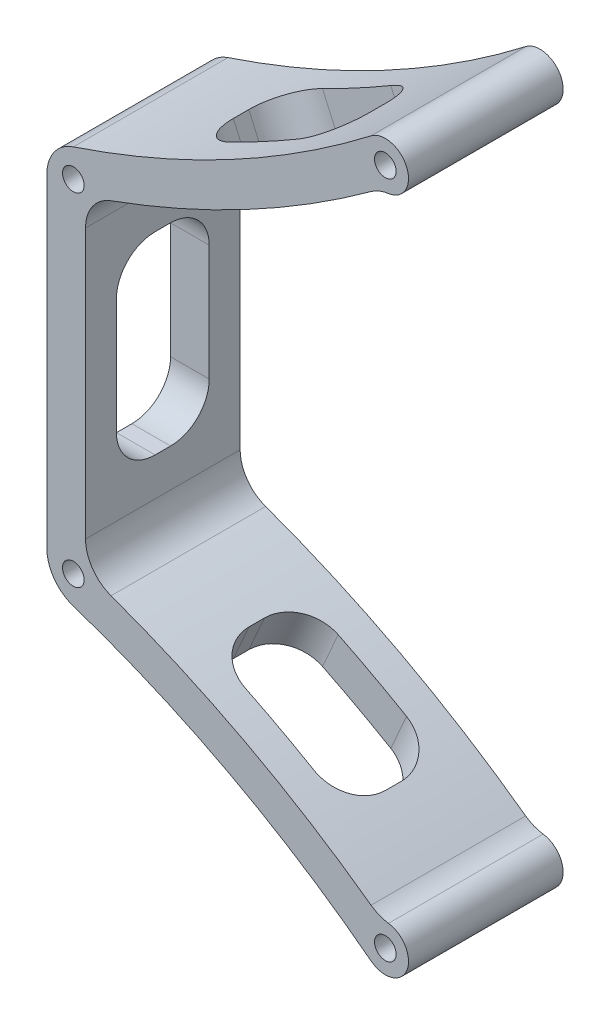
ISO-10303-21;
HEADER;
FILE_DESCRIPTION(('STEP AP214'),'2;1');
FILE_NAME('part.step','',(''),(''),'','','');
FILE_SCHEMA(('AUTOMOTIVE_DESIGN { 1 0 10303 214 1 1 1 1 }'));
ENDSEC;
DATA;
#1=APPLICATION_CONTEXT('core data for automotive mechanical design processes');
#2=APPLICATION_PROTOCOL_DEFINITION('international standard','automotive_design',2000,#1);
#3=PRODUCT_CONTEXT('',#1,'mechanical');
#4=PRODUCT('Part','Part','',(#3));
#5=PRODUCT_RELATED_PRODUCT_CATEGORY('part','',(#4));
#6=PRODUCT_DEFINITION_FORMATION('','',#4);
#7=PRODUCT_DEFINITION_CONTEXT('part definition',#1,'design');
#8=PRODUCT_DEFINITION('design','',#6,#7);
#9=PRODUCT_DEFINITION_SHAPE('','',#8);
#10=(LENGTH_UNIT() NAMED_UNIT(*) SI_UNIT(.MILLI.,.METRE.));
#11=(NAMED_UNIT(*) PLANE_ANGLE_UNIT() SI_UNIT($,.RADIAN.));
#12=(NAMED_UNIT(*) SI_UNIT($,.STERADIAN.) SOLID_ANGLE_UNIT());
#13=UNCERTAINTY_MEASURE_WITH_UNIT(LENGTH_MEASURE(1.E-05),#10,'distance_accuracy_value','');
#14=(GEOMETRIC_REPRESENTATION_CONTEXT(3) GLOBAL_UNCERTAINTY_ASSIGNED_CONTEXT((#13)) GLOBAL_UNIT_ASSIGNED_CONTEXT((#10,
#11,#12)) REPRESENTATION_CONTEXT('',''));
#15=CARTESIAN_POINT('',(0.,0.,0.));
#16=DIRECTION('',(0.,0.,1.));
#17=DIRECTION('',(1.,0.,0.));
#18=AXIS2_PLACEMENT_3D('',#15,#16,#17);
#19=CARTESIAN_POINT('',(-60.0334493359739,-140.429392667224,20.));
#20=DIRECTION('',(0.,0.,-1.));
#21=DIRECTION('',(-1.,0.,0.));
#22=AXIS2_PLACEMENT_3D('',#19,#20,#21);
#23=CYLINDRICAL_SURFACE('',#22,136.);
#24=CARTESIAN_POINT('',(-60.0334493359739,-140.429392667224,0.));
#25=DIRECTION('',(0.,0.,1.));
#26=DIRECTION('',(-1.,0.,0.));
#27=AXIS2_PLACEMENT_3D('',#24,#25,#26);
#28=CIRCLE('',#27,136.);
#29=CARTESIAN_POINT('',(19.8983110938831,-30.3979713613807,0.));
#30=VERTEX_POINT('',#29);
#31=CARTESIAN_POINT('',(-13.7355769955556,-12.5524713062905,0.));
#32=VERTEX_POINT('',#31);
#33=EDGE_CURVE('E325',#30,#32,#28,.T.);
#34=ORIENTED_EDGE('',*,*,#33,.T.);
#35=DIRECTION('',(0.,0.,-1.));
#36=VECTOR('',#35,1.);
#37=CARTESIAN_POINT('',(-13.7355769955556,-12.5524713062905,20.));
#38=LINE('',#37,#36);
#39=CARTESIAN_POINT('',(-13.7355769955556,-12.5524713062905,20.));
#40=VERTEX_POINT('',#39);
#41=EDGE_CURVE('E388',#32,#40,#38,.F.);
#42=ORIENTED_EDGE('',*,*,#41,.T.);
#43=CARTESIAN_POINT('',(-60.0334493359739,-140.429392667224,20.));
#44=DIRECTION('',(0.,0.,1.));
#45=DIRECTION('',(-1.,0.,0.));
#46=AXIS2_PLACEMENT_3D('',#43,#44,#45);
#47=CIRCLE('',#46,136.);
#48=CARTESIAN_POINT('',(19.8983110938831,-30.3979713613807,20.));
#49=VERTEX_POINT('',#48);
#50=EDGE_CURVE('E345',#49,#40,#47,.T.);
#51=ORIENTED_EDGE('',*,*,#50,.F.);
#52=DIRECTION('',(0.,0.,-1.));
#53=VECTOR('',#52,1.);
#54=CARTESIAN_POINT('',(19.8983110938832,-30.3979713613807,20.));
#55=LINE('',#54,#53);
#56=EDGE_CURVE('E309',#49,#30,#55,.T.);
#57=ORIENTED_EDGE('',*,*,#56,.T.);
#58=EDGE_LOOP('',(#34,#42,#51,#57));
#59=FACE_BOUND('',#58,.T.);
#60=DIRECTION('',(0.,0.,-1.));
#61=VECTOR('',#60,1.);
#62=CARTESIAN_POINT('',(12.7984695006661,-25.5750867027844,16.));
#63=LINE('',#62,#61);
#64=CARTESIAN_POINT('',(12.7984695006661,-25.5750867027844,11.));
#65=VERTEX_POINT('',#64);
#66=CARTESIAN_POINT('',(12.7984695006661,-25.5750867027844,9.));
#67=VERTEX_POINT('',#66);
#68=EDGE_CURVE('E1067',#65,#67,#63,.T.);
#69=ORIENTED_EDGE('',*,*,#68,.F.);
#70=CARTESIAN_POINT('',(12.7984695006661,-25.5750867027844,11.));
#71=CARTESIAN_POINT('',(12.7984824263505,-25.5750968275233,11.1396011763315));
#72=CARTESIAN_POINT('',(12.7934782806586,-25.5719217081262,11.2791994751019));
#73=CARTESIAN_POINT('',(12.7735295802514,-25.5592743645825,11.5573869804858));
#74=CARTESIAN_POINT('',(12.7585857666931,-25.549802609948,11.6959762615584));
#75=CARTESIAN_POINT('',(12.7188733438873,-25.5246492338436,11.9710117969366));
#76=CARTESIAN_POINT('',(12.6941155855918,-25.5089744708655,12.1074602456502));
#77=CARTESIAN_POINT('',(12.6349572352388,-25.4715572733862,12.3774011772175));
#78=CARTESIAN_POINT('',(12.6005567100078,-25.449814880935,12.5108936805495));
#79=CARTESIAN_POINT('',(12.5223508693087,-25.4004485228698,12.7740031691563));
#80=CARTESIAN_POINT('',(12.4785440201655,-25.3728235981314,12.903619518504));
#81=CARTESIAN_POINT('',(12.3818215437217,-25.3119230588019,13.1580934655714));
#82=CARTESIAN_POINT('',(12.328902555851,-25.2786453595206,13.2829492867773));
#83=CARTESIAN_POINT('',(12.2143642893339,-25.2067473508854,13.526929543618));
#84=CARTESIAN_POINT('',(12.152748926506,-25.1681294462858,13.6460565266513));
#85=CARTESIAN_POINT('',(12.0212038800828,-25.0858494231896,13.8778629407));
#86=CARTESIAN_POINT('',(11.9512711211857,-25.0421854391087,13.9905399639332));
#87=CARTESIAN_POINT('',(11.8032172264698,-24.9499530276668,14.2091824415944));
#88=CARTESIAN_POINT('',(11.7250564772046,-24.9013609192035,14.315111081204));
#89=CARTESIAN_POINT('',(11.5613493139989,-24.7998372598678,14.5189457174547));
#90=CARTESIAN_POINT('',(11.4758001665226,-24.7469041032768,14.6168487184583));
#91=CARTESIAN_POINT('',(11.2979391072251,-24.6371479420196,14.8039105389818));
#92=CARTESIAN_POINT('',(11.2056281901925,-24.5803255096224,14.8930706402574));
#93=CARTESIAN_POINT('',(11.0148255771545,-24.4632115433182,15.062091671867));
#94=CARTESIAN_POINT('',(10.9163316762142,-24.4029187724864,15.1419492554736));
#95=CARTESIAN_POINT('',(10.7128835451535,-24.2787546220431,15.2925121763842));
#96=CARTESIAN_POINT('',(10.6078762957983,-24.214854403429,15.3631221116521));
#97=CARTESIAN_POINT('',(10.3929922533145,-24.0845083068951,15.493793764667));
#98=CARTESIAN_POINT('',(10.2831154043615,-24.0180623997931,15.55385536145));
#99=CARTESIAN_POINT('',(10.0592883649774,-23.8831564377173,15.6629940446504));
#100=CARTESIAN_POINT('',(9.9453399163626,-23.8146972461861,15.7120757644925));
#101=CARTESIAN_POINT('',(9.71415598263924,-23.6762782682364,15.798936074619));
#102=CARTESIAN_POINT('',(9.59692116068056,-23.6063187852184,15.8367169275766));
#103=CARTESIAN_POINT('',(9.31702071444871,-23.4398740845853,15.9123012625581));
#104=CARTESIAN_POINT('',(9.15324947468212,-23.3429405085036,15.9451776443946));
#105=CARTESIAN_POINT('',(8.90587154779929,-23.1972331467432,15.9780616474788));
#106=CARTESIAN_POINT('',(8.82316293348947,-23.1486347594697,15.9862845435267));
#107=CARTESIAN_POINT('',(8.65737931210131,-23.0514590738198,15.9972529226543));
#108=CARTESIAN_POINT('',(8.57430433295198,-23.0028817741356,15.9999988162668));
#109=CARTESIAN_POINT('',(8.49115539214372,-22.954380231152,16.));
#110=B_SPLINE_CURVE_WITH_KNOTS('',3,(#70,#71,#72,#73,#74,#75,#76,#77,#78,#79,#80,#81,#82,#83,
#84,#85,#86,#87,#88,#89,#90,#91,#92,#93,#94,#95,#96,#97,#98,#99,#100,#101,#102,#103,#104,#105,
#106,#107,#108,#109),.UNSPECIFIED.,.F.,.F.,(4,2,2,2,2,2,2,2,2,2,2,2,2,2,2,2,2,2,2,4),(0.,
0.418673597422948,0.837315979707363,1.25549676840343,1.67367465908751,2.0919207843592,
2.51032149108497,2.9285343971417,3.34690241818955,3.76738574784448,4.18802531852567,
4.60860312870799,5.02933178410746,5.45410655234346,5.87888619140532,6.30348623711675,
6.72800121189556,7.30594714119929,7.59466083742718,7.8833528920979),.UNSPECIFIED.);
#111=CARTESIAN_POINT('',(8.49115539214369,-22.954380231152,16.));
#112=VERTEX_POINT('',#111);
#113=EDGE_CURVE('E578',#65,#112,#110,.T.);
#114=ORIENTED_EDGE('',*,*,#113,.T.);
#115=CARTESIAN_POINT('',(-60.0334493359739,-140.429392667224,16.));
#116=DIRECTION('',(0.,0.,1.));
#117=DIRECTION('',(-1.,0.,0.));
#118=AXIS2_PLACEMENT_3D('',#115,#116,#117);
#119=CIRCLE('',#118,136.);
#120=CARTESIAN_POINT('',(-0.350553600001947,-18.2248430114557,16.));
#121=VERTEX_POINT('',#120);
#122=EDGE_CURVE('E1090',#112,#121,#119,.T.);
#123=ORIENTED_EDGE('',*,*,#122,.T.);
#124=CARTESIAN_POINT('',(-0.35055360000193,-18.2248430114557,16.));
#125=CARTESIAN_POINT('',(-0.476909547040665,-18.1631301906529,16.0000151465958));
#126=CARTESIAN_POINT('',(-0.603361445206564,-18.10161803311,15.9940763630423));
#127=CARTESIAN_POINT('',(-0.855550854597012,-17.979420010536,15.9703960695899));
#128=CARTESIAN_POINT('',(-0.981288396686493,-17.9187341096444,15.9526550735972));
#129=CARTESIAN_POINT('',(-1.23106080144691,-17.7986529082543,15.9054930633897));
#130=CARTESIAN_POINT('',(-1.35509686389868,-17.7392566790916,15.8760807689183));
#131=CARTESIAN_POINT('',(-1.6006688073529,-17.6221100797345,15.8057868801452));
#132=CARTESIAN_POINT('',(-1.72220472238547,-17.5643596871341,15.7649054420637));
#133=CARTESIAN_POINT('',(-1.96193949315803,-17.4508687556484,15.671944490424));
#134=CARTESIAN_POINT('',(-2.08013725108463,-17.3951288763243,15.6198613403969));
#135=CARTESIAN_POINT('',(-2.3123398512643,-17.2860210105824,15.5048521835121));
#136=CARTESIAN_POINT('',(-2.42634312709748,-17.2326539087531,15.4419221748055));
#137=CARTESIAN_POINT('',(-2.64921804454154,-17.1286825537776,15.3057166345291));
#138=CARTESIAN_POINT('',(-2.75809248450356,-17.0780767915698,15.2324468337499));
#139=CARTESIAN_POINT('',(-2.97002062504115,-16.9798938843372,15.0760266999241));
#140=CARTESIAN_POINT('',(-3.0730721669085,-16.9323178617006,14.9928727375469));
#141=CARTESIAN_POINT('',(-3.27248194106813,-16.8405395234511,14.817361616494));
#142=CARTESIAN_POINT('',(-3.36884503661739,-16.7963347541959,14.7250112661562));
#143=CARTESIAN_POINT('',(-3.55428804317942,-16.7115089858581,14.5316761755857));
#144=CARTESIAN_POINT('',(-3.64336522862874,-16.6708893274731,14.4306882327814));
#145=CARTESIAN_POINT('',(-3.81352605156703,-16.5934973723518,14.2208428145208));
#146=CARTESIAN_POINT('',(-3.89461101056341,-16.556724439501,14.1119866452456));
#147=CARTESIAN_POINT('',(-4.0482330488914,-16.4872179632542,13.8871235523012));
#148=CARTESIAN_POINT('',(-4.12076707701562,-16.4544858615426,13.771114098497));
#149=CARTESIAN_POINT('',(-4.25672860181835,-16.3932568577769,13.5327834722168));
#150=CARTESIAN_POINT('',(-4.32015454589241,-16.3647606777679,13.4104612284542));
#151=CARTESIAN_POINT('',(-4.43741496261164,-16.3121694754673,13.1603943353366));
#152=CARTESIAN_POINT('',(-4.49124939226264,-16.288074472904,13.0326496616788));
#153=CARTESIAN_POINT('',(-4.58890362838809,-16.2444289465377,12.7727023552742));
#154=CARTESIAN_POINT('',(-4.63272821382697,-16.2248762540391,12.6405018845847));
#155=CARTESIAN_POINT('',(-4.71005985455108,-16.1904118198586,12.3725784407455));
#156=CARTESIAN_POINT('',(-4.74356914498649,-16.1754990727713,12.2368562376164));
#157=CARTESIAN_POINT('',(-4.80896858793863,-16.1464154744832,11.9193931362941));
#158=CARTESIAN_POINT('',(-4.83699654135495,-16.1339701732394,11.7366707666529));
#159=CARTESIAN_POINT('',(-4.8650243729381,-16.1215289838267,11.4611132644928));
#160=CARTESIAN_POINT('',(-4.87203129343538,-16.118419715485,11.3690615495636));
#161=CARTESIAN_POINT('',(-4.88137686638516,-16.1142732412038,11.1846808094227));
#162=CARTESIAN_POINT('',(-4.88371581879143,-16.1132359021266,11.0923518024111));
#163=CARTESIAN_POINT('',(-4.88371656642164,-16.1132353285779,11.));
#164=B_SPLINE_CURVE_WITH_KNOTS('',3,(#124,#125,#126,#127,#128,#129,#130,#131,#132,#133,#134,
#135,#136,#137,#138,#139,#140,#141,#142,#143,#144,#145,#146,#147,#148,#149,#150,#151,#152,#153,
#154,#155,#156,#157,#158,#159,#160,#161,#162,#163),.UNSPECIFIED.,.F.,.F.,(4,2,2,2,2,2,2,2,2,2,2,
2,2,2,2,2,2,2,2,4),(0.,0.421735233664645,0.843452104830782,1.26485449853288,1.68625115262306,
2.10778481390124,2.52947433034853,2.9509310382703,3.37254298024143,3.79384507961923,
4.21530406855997,4.63669325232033,5.0582323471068,5.47984321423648,5.901455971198,
6.32286701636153,6.74418668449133,7.29872554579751,7.57571782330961,7.85269230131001),.UNSPECIFIED.);
#165=CARTESIAN_POINT('',(-4.88371656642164,-16.1132353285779,11.));
#166=VERTEX_POINT('',#165);
#167=EDGE_CURVE('E637',#121,#166,#164,.T.);
#168=ORIENTED_EDGE('',*,*,#167,.T.);
#169=DIRECTION('',(0.,0.,-1.));
#170=VECTOR('',#169,1.);
#171=CARTESIAN_POINT('',(-4.88371656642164,-16.1132353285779,16.));
#172=LINE('',#171,#170);
#173=CARTESIAN_POINT('',(-4.88371656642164,-16.1132353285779,9.));
#174=VERTEX_POINT('',#173);
#175=EDGE_CURVE('E1095',#166,#174,#172,.T.);
#176=ORIENTED_EDGE('',*,*,#175,.T.);
#177=CARTESIAN_POINT('',(-4.88371656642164,-16.1132353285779,9.));
#178=CARTESIAN_POINT('',(-4.88373105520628,-16.1132306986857,8.85937160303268));
#179=CARTESIAN_POINT('',(-4.87829396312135,-16.1156409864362,8.71874537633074));
#180=CARTESIAN_POINT('',(-4.85662126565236,-16.1252579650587,8.43849903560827));
#181=CARTESIAN_POINT('',(-4.84038617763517,-16.1324644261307,8.2988788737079));
#182=CARTESIAN_POINT('',(-4.79723837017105,-16.1516331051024,8.02173715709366));
#183=CARTESIAN_POINT('',(-4.77033370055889,-16.1635917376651,7.88421410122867));
#184=CARTESIAN_POINT('',(-4.70605179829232,-16.1921988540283,7.61213728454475));
#185=CARTESIAN_POINT('',(-4.66867469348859,-16.2088472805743,7.47758348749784));
#186=CARTESIAN_POINT('',(-4.58371164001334,-16.2467499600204,7.21235919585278));
#187=CARTESIAN_POINT('',(-4.53612259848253,-16.268005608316,7.0816898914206));
#188=CARTESIAN_POINT('',(-4.43107694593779,-16.3150119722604,6.82515856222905));
#189=CARTESIAN_POINT('',(-4.37361669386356,-16.3407643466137,6.69929833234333));
#190=CARTESIAN_POINT('',(-4.24930138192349,-16.396600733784,6.45339871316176));
#191=CARTESIAN_POINT('',(-4.18245145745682,-16.4266823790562,6.33335618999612));
#192=CARTESIAN_POINT('',(-4.03980199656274,-16.4910306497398,6.09982871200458));
#193=CARTESIAN_POINT('',(-3.96399917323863,-16.5252988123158,5.98634618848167));
#194=CARTESIAN_POINT('',(-3.8040594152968,-16.5977997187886,5.76684185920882));
#195=CARTESIAN_POINT('',(-3.71992613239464,-16.636030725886,5.66081681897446));
#196=CARTESIAN_POINT('',(-3.54388556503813,-16.7162626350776,5.45688852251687));
#197=CARTESIAN_POINT('',(-3.45197539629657,-16.7582649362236,5.35898830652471));
#198=CARTESIAN_POINT('',(-3.26110159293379,-16.8457709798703,5.17206633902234));
#199=CARTESIAN_POINT('',(-3.16213918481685,-16.8912741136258,5.08304305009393));
#200=CARTESIAN_POINT('',(-2.95783722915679,-16.9855302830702,4.91445839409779));
#201=CARTESIAN_POINT('',(-2.85249542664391,-17.0342844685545,4.83490040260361));
#202=CARTESIAN_POINT('',(-2.63626222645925,-17.1347167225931,4.68586533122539));
#203=CARTESIAN_POINT('',(-2.52537207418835,-17.1863941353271,4.61638600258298));
#204=CARTESIAN_POINT('',(-2.2988312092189,-17.2923571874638,4.48798010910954));
#205=CARTESIAN_POINT('',(-2.18318047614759,-17.3466428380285,4.42905358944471));
#206=CARTESIAN_POINT('',(-1.9480098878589,-17.4574503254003,4.32219594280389));
#207=CARTESIAN_POINT('',(-1.82849188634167,-17.5139710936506,4.27425963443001));
#208=CARTESIAN_POINT('',(-1.58644894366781,-17.6288792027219,4.18969628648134));
#209=CARTESIAN_POINT('',(-1.46392466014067,-17.687266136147,4.15306679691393));
#210=CARTESIAN_POINT('',(-1.17761240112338,-17.8242422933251,4.08161186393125));
#211=CARTESIAN_POINT('',(-1.01300816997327,-17.9033905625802,4.05100608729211));
#212=CARTESIAN_POINT('',(-0.765024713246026,-18.0232559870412,4.02040464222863));
#213=CARTESIAN_POINT('',(-0.682226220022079,-18.0633810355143,4.01275536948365));
#214=CARTESIAN_POINT('',(-0.516462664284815,-18.1439201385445,4.0025536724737));
#215=CARTESIAN_POINT('',(-0.433497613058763,-18.1843341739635,4.00000091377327));
#216=CARTESIAN_POINT('',(-0.35055360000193,-18.2248430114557,4.));
#217=B_SPLINE_CURVE_WITH_KNOTS('',3,(#177,#178,#179,#180,#181,#182,#183,#184,#185,#186,#187,
#188,#189,#190,#191,#192,#193,#194,#195,#196,#197,#198,#199,#200,#201,#202,#203,#204,#205,#206,
#207,#208,#209,#210,#211,#212,#213,#214,#215,#216),.UNSPECIFIED.,.F.,.F.,(4,2,2,2,2,2,2,2,2,2,2,
2,2,2,2,2,2,2,2,4),(0.,0.42175642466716,0.843492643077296,1.26491127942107,1.68632477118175,
2.10786607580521,2.52956320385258,2.95103058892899,3.3726531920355,3.79409178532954,
4.21568737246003,4.63720981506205,5.05888213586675,5.48046022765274,5.9020401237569,
6.3234208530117,6.74471021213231,7.29899042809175,7.57585043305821,7.85269226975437),.UNSPECIFIED.);
#218=CARTESIAN_POINT('',(-0.350553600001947,-18.2248430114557,4.));
#219=VERTEX_POINT('',#218);
#220=EDGE_CURVE('E11',#174,#219,#217,.T.);
#221=ORIENTED_EDGE('',*,*,#220,.T.);
#222=CARTESIAN_POINT('',(-60.0334493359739,-140.429392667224,4.));
#223=DIRECTION('',(0.,0.,1.));
#224=DIRECTION('',(-1.,0.,0.));
#225=AXIS2_PLACEMENT_3D('',#222,#223,#224);
#226=CIRCLE('',#225,136.);
#227=CARTESIAN_POINT('',(8.49115539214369,-22.954380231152,4.));
#228=VERTEX_POINT('',#227);
#229=EDGE_CURVE('E1084',#228,#219,#226,.T.);
#230=ORIENTED_EDGE('',*,*,#229,.F.);
#231=CARTESIAN_POINT('',(8.4911553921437,-22.954380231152,4.));
#232=CARTESIAN_POINT('',(8.61420527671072,-23.0261541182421,3.99998534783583));
#233=CARTESIAN_POINT('',(8.73713750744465,-23.0981236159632,4.00601315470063));
#234=CARTESIAN_POINT('',(8.98189792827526,-23.2419282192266,4.03003469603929));
#235=CARTESIAN_POINT('',(9.10372617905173,-23.3137633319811,4.04802776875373));
#236=CARTESIAN_POINT('',(9.34534307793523,-23.4567338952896,4.09584491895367));
#237=CARTESIAN_POINT('',(9.46513303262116,-23.5278697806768,4.12566109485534));
#238=CARTESIAN_POINT('',(9.70191861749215,-23.6689651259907,4.19690488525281));
#239=CARTESIAN_POINT('',(9.81891427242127,-23.7389245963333,4.2383323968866));
#240=CARTESIAN_POINT('',(10.0493287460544,-23.8771628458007,4.33252043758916));
#241=CARTESIAN_POINT('',(10.1627465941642,-23.9454411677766,4.38528401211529));
#242=CARTESIAN_POINT('',(10.3852259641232,-24.0798027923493,4.50179030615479));
#243=CARTESIAN_POINT('',(10.4942858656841,-24.1458852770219,4.56553706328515));
#244=CARTESIAN_POINT('',(10.7071910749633,-24.2752825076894,4.70351684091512));
#245=CARTESIAN_POINT('',(10.8110391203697,-24.3385987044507,4.77774427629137));
#246=CARTESIAN_POINT('',(11.0128962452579,-24.4620231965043,4.93622429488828));
#247=CARTESIAN_POINT('',(11.1109032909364,-24.5221303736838,5.0204803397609));
#248=CARTESIAN_POINT('',(11.3002577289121,-24.6385701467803,5.19832052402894));
#249=CARTESIAN_POINT('',(11.3916118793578,-24.6949065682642,5.29189496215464));
#250=CARTESIAN_POINT('',(11.5671313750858,-24.8034116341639,5.48779299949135));
#251=CARTESIAN_POINT('',(11.6512967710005,-24.8555803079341,5.59011653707));
#252=CARTESIAN_POINT('',(11.8118746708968,-24.955333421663,5.80283604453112));
#253=CARTESIAN_POINT('',(11.8882843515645,-25.0029161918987,5.9132349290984));
#254=CARTESIAN_POINT('',(12.0327455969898,-25.0930549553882,6.14125216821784));
#255=CARTESIAN_POINT('',(12.1008001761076,-25.1356127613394,6.2588678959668));
#256=CARTESIAN_POINT('',(12.2276786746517,-25.2150925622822,6.49972939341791));
#257=CARTESIAN_POINT('',(12.28655989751,-25.2520495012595,6.62293344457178));
#258=CARTESIAN_POINT('',(12.395179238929,-25.3203231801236,6.87475417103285));
#259=CARTESIAN_POINT('',(12.4449208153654,-25.3516420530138,7.00336877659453));
#260=CARTESIAN_POINT('',(12.5349108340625,-25.4083687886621,7.26508786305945));
#261=CARTESIAN_POINT('',(12.5751630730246,-25.4337790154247,7.39819052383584));
#262=CARTESIAN_POINT('',(12.6458957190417,-25.4784703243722,7.66791683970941));
#263=CARTESIAN_POINT('',(12.6763787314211,-25.4977530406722,7.80453954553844));
#264=CARTESIAN_POINT('',(12.7339648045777,-25.5342016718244,8.11611977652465));
#265=CARTESIAN_POINT('',(12.758153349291,-25.5495294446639,8.29185090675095));
#266=CARTESIAN_POINT('',(12.7823403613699,-25.5648600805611,8.55678284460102));
#267=CARTESIAN_POINT('',(12.7883867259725,-25.5686934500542,8.64527147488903));
#268=CARTESIAN_POINT('',(12.796450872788,-25.573806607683,8.8225000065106));
#269=CARTESIAN_POINT('',(12.7984689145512,-25.5750865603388,8.91123989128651));
#270=CARTESIAN_POINT('',(12.7984695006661,-25.5750867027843,9.));
#271=B_SPLINE_CURVE_WITH_KNOTS('',3,(#231,#232,#233,#234,#235,#236,#237,#238,#239,#240,#241,
#242,#243,#244,#245,#246,#247,#248,#249,#250,#251,#252,#253,#254,#255,#256,#257,#258,#259,#260,
#261,#262,#263,#264,#265,#266,#267,#268,#269,#270),.UNSPECIFIED.,.F.,.F.,(4,2,2,2,2,2,2,2,2,2,2,
2,2,2,2,2,2,2,2,4),(0.,0.427226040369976,0.854428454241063,1.28134584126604,1.70825944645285,
2.13528788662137,2.5624736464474,2.98943261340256,3.41653938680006,3.84320606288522,
4.26986973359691,4.69668816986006,5.12335216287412,5.54723366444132,5.97095446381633,
6.39450544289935,6.81794337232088,7.350925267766,7.61715025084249,7.88335808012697),.UNSPECIFIED.);
#272=EDGE_CURVE('E610',#228,#67,#271,.T.);
#273=ORIENTED_EDGE('',*,*,#272,.T.);
#274=EDGE_LOOP('',(#69,#114,#123,#168,#176,#221,#230,#273));
#275=FACE_BOUND('',#274,.T.);
#276=ADVANCED_FACE('F36',(#59,#275),#23,.T.);
#277=CARTESIAN_POINT('',(-60.0334493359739,-140.429392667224,20.));
#278=DIRECTION('',(0.,0.,-1.));
#279=DIRECTION('',(-1.,0.,0.));
#280=AXIS2_PLACEMENT_3D('',#277,#278,#279);
#281=CYLINDRICAL_SURFACE('',#280,131.);
#282=CARTESIAN_POINT('',(-60.0334493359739,-140.429392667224,20.));
#283=DIRECTION('',(0.,0.,-1.));
#284=DIRECTION('',(-1.,0.,0.));
#285=AXIS2_PLACEMENT_3D('',#282,#283,#284);
#286=CIRCLE('',#285,131.);
#287=CARTESIAN_POINT('',(-18.6143316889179,-16.1496409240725,20.));
#288=VERTEX_POINT('',#287);
#289=CARTESIAN_POINT('',(19.9150800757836,-36.6544792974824,20.));
#290=VERTEX_POINT('',#289);
#291=EDGE_CURVE('E317',#288,#290,#286,.T.);
#292=ORIENTED_EDGE('',*,*,#291,.F.);
#293=DIRECTION('',(0.,0.,-1.));
#294=VECTOR('',#293,1.);
#295=CARTESIAN_POINT('',(-18.6143316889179,-16.1496409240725,20.));
#296=LINE('',#295,#294);
#297=CARTESIAN_POINT('',(-18.6143316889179,-16.1496409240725,0.));
#298=VERTEX_POINT('',#297);
#299=EDGE_CURVE('E390',#288,#298,#296,.T.);
#300=ORIENTED_EDGE('',*,*,#299,.T.);
#301=CARTESIAN_POINT('',(-60.0334493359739,-140.429392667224,0.));
#302=DIRECTION('',(0.,0.,-1.));
#303=DIRECTION('',(-1.,0.,0.));
#304=AXIS2_PLACEMENT_3D('',#301,#302,#303);
#305=CIRCLE('',#304,131.);
#306=CARTESIAN_POINT('',(19.9150800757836,-36.6544792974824,0.));
#307=VERTEX_POINT('',#306);
#308=EDGE_CURVE('E340',#298,#307,#305,.T.);
#309=ORIENTED_EDGE('',*,*,#308,.T.);
#310=DIRECTION('',(0.,0.,-1.));
#311=VECTOR('',#310,1.);
#312=CARTESIAN_POINT('',(19.9150800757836,-36.6544792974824,20.));
#313=LINE('',#312,#311);
#314=EDGE_CURVE('E310',#290,#307,#313,.T.);
#315=ORIENTED_EDGE('',*,*,#314,.F.);
#316=EDGE_LOOP('',(#292,#300,#309,#315));
#317=FACE_BOUND('',#316,.T.);
#318=DIRECTION('',(0.,0.,-1.));
#319=VECTOR('',#318,1.);
#320=CARTESIAN_POINT('',(-6.91128027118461,-20.6836822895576,16.));
#321=LINE('',#320,#319);
#322=CARTESIAN_POINT('',(-6.91128027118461,-20.6836822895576,11.));
#323=VERTEX_POINT('',#322);
#324=CARTESIAN_POINT('',(-6.91128027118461,-20.6836822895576,9.));
#325=VERTEX_POINT('',#324);
#326=EDGE_CURVE('E1093',#323,#325,#321,.T.);
#327=ORIENTED_EDGE('',*,*,#326,.F.);
#328=CARTESIAN_POINT('',(-6.91128027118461,-20.6836822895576,11.));
#329=CARTESIAN_POINT('',(-6.91129478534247,-20.6836777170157,11.1406282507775));
#330=CARTESIAN_POINT('',(-6.9058576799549,-20.6860879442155,11.2812543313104));
#331=CARTESIAN_POINT('',(-6.88418506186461,-20.6957049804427,11.5615003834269));
#332=CARTESIAN_POINT('',(-6.8679500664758,-20.7029115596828,11.7011204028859));
#333=CARTESIAN_POINT('',(-6.82480272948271,-20.7220810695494,11.9782618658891));
#334=CARTESIAN_POINT('',(-6.79789843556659,-20.7340404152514,12.1157848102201));
#335=CARTESIAN_POINT('',(-6.73361792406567,-20.7626503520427,12.3878614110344));
#336=CARTESIAN_POINT('',(-6.69624183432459,-20.77930088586,12.5224151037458));
#337=CARTESIAN_POINT('',(-6.6112819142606,-20.8172102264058,12.7876392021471));
#338=CARTESIAN_POINT('',(-6.56369499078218,-20.8384704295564,12.91830841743));
#339=CARTESIAN_POINT('',(-6.45865525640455,-20.885489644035,13.1748395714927));
#340=CARTESIAN_POINT('',(-6.40119880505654,-20.9112503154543,13.3006997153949));
#341=CARTESIAN_POINT('',(-6.27689343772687,-20.9671085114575,13.5465991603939));
#342=CARTESIAN_POINT('',(-6.21004965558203,-20.9972036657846,13.6666415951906));
#343=CARTESIAN_POINT('',(-6.06741556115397,-21.0615857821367,13.9001688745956));
#344=CARTESIAN_POINT('',(-5.99162196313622,-21.0958742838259,14.0136512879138));
#345=CARTESIAN_POINT('',(-5.83170486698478,-21.1684242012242,14.2331548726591));
#346=CARTESIAN_POINT('',(-5.74758505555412,-21.2066838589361,14.3391793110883));
#347=CARTESIAN_POINT('',(-5.57157617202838,-21.2869832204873,14.543106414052));
#348=CARTESIAN_POINT('',(-5.47968421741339,-21.3290243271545,14.6410060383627));
#349=CARTESIAN_POINT('',(-5.28885241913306,-21.4166197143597,14.8279267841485));
#350=CARTESIAN_POINT('',(-5.18991380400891,-21.4621733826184,14.9169494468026));
#351=CARTESIAN_POINT('',(-4.98566575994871,-21.5565438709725,15.0855328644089));
#352=CARTESIAN_POINT('',(-4.88035407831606,-21.6053618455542,15.1650902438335));
#353=CARTESIAN_POINT('',(-4.66419016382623,-21.705935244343,15.3141227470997));
#354=CARTESIAN_POINT('',(-4.55333927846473,-21.7576899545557,15.3836003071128));
#355=CARTESIAN_POINT('',(-4.32688476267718,-21.8638230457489,15.5120031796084));
#356=CARTESIAN_POINT('',(-4.21128111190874,-21.9182014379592,15.5709284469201));
#357=CARTESIAN_POINT('',(-3.97621284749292,-22.029210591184,15.6777842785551));
#358=CARTESIAN_POINT('',(-3.85675008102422,-22.0858402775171,15.7257200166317));
#359=CARTESIAN_POINT('',(-3.61482609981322,-22.2009827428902,15.8102830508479));
#360=CARTESIAN_POINT('',(-3.49236554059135,-22.2594951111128,15.8469127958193));
#361=CARTESIAN_POINT('',(-3.206187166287,-22.3967924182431,15.9183754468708));
#362=CARTESIAN_POINT('',(-3.0416556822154,-22.4761428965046,15.9489861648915));
#363=CARTESIAN_POINT('',(-2.79379194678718,-22.5963324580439,15.9795923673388));
#364=CARTESIAN_POINT('',(-2.71103511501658,-22.6365689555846,15.9872427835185));
#365=CARTESIAN_POINT('',(-2.54535838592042,-22.7173376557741,15.9974459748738));
#366=CARTESIAN_POINT('',(-2.4624384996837,-22.7578698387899,15.9999990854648));
#367=CARTESIAN_POINT('',(-2.37954137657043,-22.7985000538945,16.));
#368=B_SPLINE_CURVE_WITH_KNOTS('',3,(#328,#329,#330,#331,#332,#333,#334,#335,#336,#337,#338,
#339,#340,#341,#342,#343,#344,#345,#346,#347,#348,#349,#350,#351,#352,#353,#354,#355,#356,#357,
#358,#359,#360,#361,#362,#363,#364,#365,#366,#367),.UNSPECIFIED.,.F.,.F.,(4,2,2,2,2,2,2,2,2,2,2,
2,2,2,2,2,2,2,2,4),(0.,0.421755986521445,0.843491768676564,1.26491004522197,1.68632317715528,
2.10786414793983,2.52956094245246,2.95102800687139,3.37265028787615,3.79408670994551,
4.21568012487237,4.63720021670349,5.05887018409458,5.48043806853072,5.90200775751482,
6.32337856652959,6.74465804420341,7.29900588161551,7.57589958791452,7.85277507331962),.UNSPECIFIED.);
#369=CARTESIAN_POINT('',(-2.37954137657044,-22.7985000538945,16.));
#370=VERTEX_POINT('',#369);
#371=EDGE_CURVE('E64',#323,#370,#368,.T.);
#372=ORIENTED_EDGE('',*,*,#371,.T.);
#373=CARTESIAN_POINT('',(-60.0334493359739,-140.429392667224,16.));
#374=DIRECTION('',(0.,0.,-1.));
#375=DIRECTION('',(-1.,0.,0.));
#376=AXIS2_PLACEMENT_3D('',#373,#374,#375);
#377=CIRCLE('',#376,131.);
#378=CARTESIAN_POINT('',(6.4506659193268,-27.5539639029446,16.));
#379=VERTEX_POINT('',#378);
#380=EDGE_CURVE('E1087',#370,#379,#377,.T.);
#381=ORIENTED_EDGE('',*,*,#380,.T.);
#382=CARTESIAN_POINT('',(6.4506659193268,-27.5539639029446,16.));
#383=CARTESIAN_POINT('',(6.57353480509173,-27.6263314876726,16.0000146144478));
#384=CARTESIAN_POINT('',(6.69628048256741,-27.6989020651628,15.9939804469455));
#385=CARTESIAN_POINT('',(6.94065833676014,-27.8439188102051,15.9699343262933));
#386=CARTESIAN_POINT('',(7.06229057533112,-27.9163649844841,15.9519230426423));
#387=CARTESIAN_POINT('',(7.30350872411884,-28.0605631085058,15.9040582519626));
#388=CARTESIAN_POINT('',(7.42309593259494,-28.1323154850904,15.8742125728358));
#389=CARTESIAN_POINT('',(7.65947049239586,-28.2746440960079,15.802898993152));
#390=CARTESIAN_POINT('',(7.7762578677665,-28.3452203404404,15.7614311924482));
#391=CARTESIAN_POINT('',(8.00625213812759,-28.4846870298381,15.6671520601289));
#392=CARTESIAN_POINT('',(8.11945807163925,-28.5535770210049,15.6143377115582));
#393=CARTESIAN_POINT('',(8.34151264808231,-28.689151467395,15.4977191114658));
#394=CARTESIAN_POINT('',(8.45035967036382,-28.7558351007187,15.433910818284));
#395=CARTESIAN_POINT('',(8.66284065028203,-28.8864176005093,15.2957968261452));
#396=CARTESIAN_POINT('',(8.76647734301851,-28.9503179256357,15.2214967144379));
#397=CARTESIAN_POINT('',(8.96791508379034,-29.0748878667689,15.0628596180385));
#398=CARTESIAN_POINT('',(9.06571409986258,-29.1355563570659,14.9785191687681));
#399=CARTESIAN_POINT('',(9.25465150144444,-29.2530847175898,14.8005039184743));
#400=CARTESIAN_POINT('',(9.34579707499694,-29.309948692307,14.7068394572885));
#401=CARTESIAN_POINT('',(9.52090671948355,-29.4194731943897,14.5107498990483));
#402=CARTESIAN_POINT('',(9.60487084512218,-29.4721337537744,14.4083248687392));
#403=CARTESIAN_POINT('',(9.76505436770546,-29.5728284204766,14.1953906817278));
#404=CARTESIAN_POINT('',(9.84127094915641,-29.6208608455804,14.0848786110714));
#405=CARTESIAN_POINT('',(9.98535477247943,-29.711849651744,13.8566237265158));
#406=CARTESIAN_POINT('',(10.0532250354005,-29.7548078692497,13.7388835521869));
#407=CARTESIAN_POINT('',(10.1797094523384,-29.8350080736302,13.4978312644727));
#408=CARTESIAN_POINT('',(10.2383857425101,-29.8722883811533,13.3745645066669));
#409=CARTESIAN_POINT('',(10.3466143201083,-29.9411545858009,13.1226155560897));
#410=CARTESIAN_POINT('',(10.3961700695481,-29.972742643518,12.9939354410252));
#411=CARTESIAN_POINT('',(10.485807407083,-30.0299485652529,12.7320845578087));
#412=CARTESIAN_POINT('',(10.5258928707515,-30.0555688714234,12.5989156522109));
#413=CARTESIAN_POINT('',(10.5963115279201,-30.1006175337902,12.3290565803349));
#414=CARTESIAN_POINT('',(10.6266473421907,-30.1200475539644,12.1923673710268));
#415=CARTESIAN_POINT('',(10.6838149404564,-30.1566852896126,11.8812282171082));
#416=CARTESIAN_POINT('',(10.7077912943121,-30.1720697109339,11.7060195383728));
#417=CARTESIAN_POINT('',(10.7317661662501,-30.1874571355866,11.4418812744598));
#418=CARTESIAN_POINT('',(10.7377595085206,-30.19130473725,11.3536587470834));
#419=CARTESIAN_POINT('',(10.7457529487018,-30.196436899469,11.1769641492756));
#420=CARTESIAN_POINT('',(10.7477532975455,-30.1977216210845,11.0884920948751));
#421=CARTESIAN_POINT('',(10.7477538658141,-30.197721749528,11.));
#422=B_SPLINE_CURVE_WITH_KNOTS('',3,(#382,#383,#384,#385,#386,#387,#388,#389,#390,#391,#392,
#393,#394,#395,#396,#397,#398,#399,#400,#401,#402,#403,#404,#405,#406,#407,#408,#409,#410,#411,
#412,#413,#414,#415,#416,#417,#418,#419,#420,#421),.UNSPECIFIED.,.F.,.F.,(4,2,2,2,2,2,2,2,2,2,2,
2,2,2,2,2,2,2,2,4),(0.,0.427657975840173,0.855292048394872,1.28264373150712,1.70999174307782,
2.1374535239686,2.56507278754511,2.99246518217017,3.42000548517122,3.84707684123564,
4.27414494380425,4.70136769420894,5.12843534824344,5.55247910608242,5.97636157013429,
6.40007026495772,6.82366496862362,7.35503760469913,7.62045867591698,7.8858630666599),.UNSPECIFIED.);
#423=CARTESIAN_POINT('',(10.7477538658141,-30.197721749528,11.));
#424=VERTEX_POINT('',#423);
#425=EDGE_CURVE('E603',#379,#424,#422,.T.);
#426=ORIENTED_EDGE('',*,*,#425,.T.);
#427=DIRECTION('',(0.,0.,-1.));
#428=VECTOR('',#427,1.);
#429=CARTESIAN_POINT('',(10.7477538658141,-30.197721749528,16.));
#430=LINE('',#429,#428);
#431=CARTESIAN_POINT('',(10.7477538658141,-30.197721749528,9.));
#432=VERTEX_POINT('',#431);
#433=EDGE_CURVE('E1062',#424,#432,#430,.T.);
#434=ORIENTED_EDGE('',*,*,#433,.T.);
#435=CARTESIAN_POINT('',(10.7477538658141,-30.197721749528,9.));
#436=CARTESIAN_POINT('',(10.7477667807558,-30.1977320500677,8.86047922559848));
#437=CARTESIAN_POINT('',(10.7427821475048,-30.1945294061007,8.72096138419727));
#438=CARTESIAN_POINT('',(10.7229114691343,-30.1817729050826,8.44293502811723));
#439=CARTESIAN_POINT('',(10.7080261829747,-30.1722195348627,8.30442643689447));
#440=CARTESIAN_POINT('',(10.6684702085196,-30.1468505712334,8.02955566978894));
#441=CARTESIAN_POINT('',(10.643810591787,-30.1310420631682,7.89319124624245));
#442=CARTESIAN_POINT('',(10.5848876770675,-30.093307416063,7.62341733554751));
#443=CARTESIAN_POINT('',(10.5506244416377,-30.0713813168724,7.49000782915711));
#444=CARTESIAN_POINT('',(10.4727323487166,-30.0216009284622,7.22706373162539));
#445=CARTESIAN_POINT('',(10.4291020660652,-29.9937457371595,7.09752973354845));
#446=CARTESIAN_POINT('',(10.3327709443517,-29.9323415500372,6.84321674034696));
#447=CARTESIAN_POINT('',(10.2800667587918,-29.8987904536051,6.71843952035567));
#448=CARTESIAN_POINT('',(10.1659945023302,-29.826306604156,6.47460957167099));
#449=CARTESIAN_POINT('',(10.104630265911,-29.7873762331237,6.35555434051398));
#450=CARTESIAN_POINT('',(9.97362256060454,-29.7044366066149,6.12388297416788));
#451=CARTESIAN_POINT('',(9.90397602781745,-29.6604254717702,6.01126924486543));
#452=CARTESIAN_POINT('',(9.75649764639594,-29.5674472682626,5.79269616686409));
#453=CARTESIAN_POINT('',(9.67862304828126,-29.5184543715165,5.68677665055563));
#454=CARTESIAN_POINT('',(9.51551215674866,-29.4160996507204,5.48295253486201));
#455=CARTESIAN_POINT('',(9.43027313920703,-29.3627362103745,5.38505092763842));
#456=CARTESIAN_POINT('',(9.25305289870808,-29.2520950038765,5.19798149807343));
#457=CARTESIAN_POINT('',(9.16107265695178,-29.1948178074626,5.10881240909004));
#458=CARTESIAN_POINT('',(8.97094852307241,-29.0767743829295,4.93976073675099));
#459=CARTESIAN_POINT('',(8.8728024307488,-29.0160069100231,4.85988149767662));
#460=CARTESIAN_POINT('',(8.66998986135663,-28.8908263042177,4.70920349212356));
#461=CARTESIAN_POINT('',(8.56526631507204,-28.8263818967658,4.63850749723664));
#462=CARTESIAN_POINT('',(8.35095106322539,-28.6949325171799,4.50766274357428));
#463=CARTESIAN_POINT('',(8.24135929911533,-28.6279275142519,4.44751411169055));
#464=CARTESIAN_POINT('',(8.01809971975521,-28.4918934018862,4.33819966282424));
#465=CARTESIAN_POINT('',(7.90443362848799,-28.422865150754,4.28902926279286));
#466=CARTESIAN_POINT('',(7.67380868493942,-28.2833031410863,4.20199009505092));
#467=CARTESIAN_POINT('',(7.5568504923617,-28.2127696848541,4.16411908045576));
#468=CARTESIAN_POINT('',(7.27714402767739,-28.0446988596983,4.08819878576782));
#469=CARTESIAN_POINT('',(7.11327266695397,-27.9467071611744,4.0551357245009));
#470=CARTESIAN_POINT('',(6.86571967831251,-27.7994213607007,4.02206420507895));
#471=CARTESIAN_POINT('',(6.78294822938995,-27.7502983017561,4.01379422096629));
#472=CARTESIAN_POINT('',(6.61703209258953,-27.6520783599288,4.00276293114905));
#473=CARTESIAN_POINT('',(6.53388743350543,-27.6029814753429,4.00000120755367));
#474=CARTESIAN_POINT('',(6.4506659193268,-27.5539639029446,4.));
#475=B_SPLINE_CURVE_WITH_KNOTS('',3,(#435,#436,#437,#438,#439,#440,#441,#442,#443,#444,#445,
#446,#447,#448,#449,#450,#451,#452,#453,#454,#455,#456,#457,#458,#459,#460,#461,#462,#463,#464,
#465,#466,#467,#468,#469,#470,#471,#472,#473,#474),.UNSPECIFIED.,.F.,.F.,(4,2,2,2,2,2,2,2,2,2,2,
2,2,2,2,2,2,2,2,4),(0.,0.418432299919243,0.836832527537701,1.25476017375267,1.67268509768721,
2.09067365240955,2.50881669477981,2.92677517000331,3.34488874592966,3.76529276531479,
4.18585296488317,4.60635207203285,5.02700209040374,5.45201492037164,5.87703286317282,
6.30187304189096,6.72662868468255,7.30651165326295,7.59619554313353,7.88585745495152),.UNSPECIFIED.);
#476=CARTESIAN_POINT('',(6.4506659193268,-27.5539639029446,4.));
#477=VERTEX_POINT('',#476);
#478=EDGE_CURVE('E626',#432,#477,#475,.T.);
#479=ORIENTED_EDGE('',*,*,#478,.T.);
#480=CARTESIAN_POINT('',(-60.0334493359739,-140.429392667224,4.));
#481=DIRECTION('',(0.,0.,-1.));
#482=DIRECTION('',(-1.,0.,0.));
#483=AXIS2_PLACEMENT_3D('',#480,#481,#482);
#484=CIRCLE('',#483,131.);
#485=CARTESIAN_POINT('',(-2.37954137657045,-22.7985000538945,4.));
#486=VERTEX_POINT('',#485);
#487=EDGE_CURVE('E1081',#486,#477,#484,.T.);
#488=ORIENTED_EDGE('',*,*,#487,.F.);
#489=CARTESIAN_POINT('',(-2.37954137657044,-22.7985000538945,4.));
#490=CARTESIAN_POINT('',(-2.50580986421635,-22.7366101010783,3.99998485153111));
#491=CARTESIAN_POINT('',(-2.6321783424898,-22.6749282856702,4.00592295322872));
#492=CARTESIAN_POINT('',(-2.88420939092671,-22.5524065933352,4.02960084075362));
#493=CARTESIAN_POINT('',(-3.00987199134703,-22.4915666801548,4.04734011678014));
#494=CARTESIAN_POINT('',(-3.25950344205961,-22.3711938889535,4.09449798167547));
#495=CARTESIAN_POINT('',(-3.38347348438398,-22.3116600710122,4.12390786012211));
#496=CARTESIAN_POINT('',(-3.62892215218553,-22.1942548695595,4.19419648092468));
#497=CARTESIAN_POINT('',(-3.75040081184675,-22.1363834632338,4.23507506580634));
#498=CARTESIAN_POINT('',(-3.99002984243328,-22.0226668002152,4.32803018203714));
#499=CARTESIAN_POINT('',(-4.10817911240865,-21.9668222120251,4.38011036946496));
#500=CARTESIAN_POINT('',(-4.34029288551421,-21.8575208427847,4.49511359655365));
#501=CARTESIAN_POINT('',(-4.45425582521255,-21.8040649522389,4.55804063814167));
#502=CARTESIAN_POINT('',(-4.67705763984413,-21.6999312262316,4.69424031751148));
#503=CARTESIAN_POINT('',(-4.78589931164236,-21.6492518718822,4.76750721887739));
#504=CARTESIAN_POINT('',(-4.99776883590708,-21.5509357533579,4.92392171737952));
#505=CARTESIAN_POINT('',(-5.10079453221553,-21.5033001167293,5.00707294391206));
#506=CARTESIAN_POINT('',(-5.3001560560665,-21.4114165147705,5.18257636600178));
#507=CARTESIAN_POINT('',(-5.39649692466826,-21.3671659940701,5.27492149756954));
#508=CARTESIAN_POINT('',(-5.58190125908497,-21.2822596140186,5.46824589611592));
#509=CARTESIAN_POINT('',(-5.67096200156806,-21.2416050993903,5.56922836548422));
#510=CARTESIAN_POINT('',(-5.84109498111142,-21.1641526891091,5.77906266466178));
#511=CARTESIAN_POINT('',(-5.92216853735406,-21.1273541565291,5.88791318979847));
#512=CARTESIAN_POINT('',(-6.07577202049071,-21.0578040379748,6.11276486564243));
#513=CARTESIAN_POINT('',(-6.14829889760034,-21.0250538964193,6.22876854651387));
#514=CARTESIAN_POINT('',(-6.28425044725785,-20.9637943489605,6.46708899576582));
#515=CARTESIAN_POINT('',(-6.34767345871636,-20.9352857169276,6.58940691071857));
#516=CARTESIAN_POINT('',(-6.46493059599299,-20.8826740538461,6.8394652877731));
#517=CARTESIAN_POINT('',(-6.51876467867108,-20.8585710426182,6.96720577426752));
#518=CARTESIAN_POINT('',(-6.61642017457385,-20.8149125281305,7.22714493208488));
#519=CARTESIAN_POINT('',(-6.66024636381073,-20.795354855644,7.35934144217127));
#520=CARTESIAN_POINT('',(-6.73758260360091,-20.7608822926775,7.62725722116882));
#521=CARTESIAN_POINT('',(-6.77109488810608,-20.7459663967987,7.76297572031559));
#522=CARTESIAN_POINT('',(-6.83650890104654,-20.7168735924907,8.08046241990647));
#523=CARTESIAN_POINT('',(-6.86454555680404,-20.7044239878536,8.26321303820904));
#524=CARTESIAN_POINT('',(-6.89258216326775,-20.6919786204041,8.53881368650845));
#525=CARTESIAN_POINT('',(-6.89959129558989,-20.6888683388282,8.63087993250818));
#526=CARTESIAN_POINT('',(-6.90893982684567,-20.6847205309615,8.81528986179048));
#527=CARTESIAN_POINT('',(-6.91127952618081,-20.6836828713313,8.90763352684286));
#528=CARTESIAN_POINT('',(-6.9112802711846,-20.6836822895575,9.));
#529=B_SPLINE_CURVE_WITH_KNOTS('',3,(#489,#490,#491,#492,#493,#494,#495,#496,#497,#498,#499,
#500,#501,#502,#503,#504,#505,#506,#507,#508,#509,#510,#511,#512,#513,#514,#515,#516,#517,#518,
#519,#520,#521,#522,#523,#524,#525,#526,#527,#528),.UNSPECIFIED.,.F.,.F.,(4,2,2,2,2,2,2,2,2,2,2,
2,2,2,2,2,2,2,2,4),(0.,0.421733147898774,0.843448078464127,1.26484884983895,1.68624383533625,
2.10777656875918,2.52946516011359,2.95092071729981,3.37253150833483,3.79382082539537,
4.21526702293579,4.63664349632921,5.05816988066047,5.47977307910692,5.90137817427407,
6.32278164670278,6.74409378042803,7.29872038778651,7.57575665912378,7.85277510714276),.UNSPECIFIED.);
#530=EDGE_CURVE('E50',#486,#325,#529,.T.);
#531=ORIENTED_EDGE('',*,*,#530,.T.);
#532=EDGE_LOOP('',(#327,#372,#381,#426,#434,#479,#488,#531));
#533=FACE_BOUND('',#532,.T.);
#534=ADVANCED_FACE('F616',(#317,#533),#281,.F.);
#535=CARTESIAN_POINT('',(-17.0334493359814,30.5473536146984,20.));
#536=DIRECTION('',(-1.,0.,0.));
#537=DIRECTION('',(0.,-1.,0.));
#538=AXIS2_PLACEMENT_3D('',#535,#536,#537);
#539=PLANE('',#538);
#540=DIRECTION('',(-2.22595254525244E-13,1.,0.));
#541=VECTOR('',#540,1.);
#542=CARTESIAN_POINT('',(-17.0334493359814,12.0824864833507,20.));
#543=LINE('',#542,#541);
#544=CARTESIAN_POINT('',(-17.0334493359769,-7.85111390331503,20.));
#545=VERTEX_POINT('',#544);
#546=CARTESIAN_POINT('',(-17.0334493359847,26.9923285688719,20.));
#547=VERTEX_POINT('',#546);
#548=EDGE_CURVE('E755',#545,#547,#543,.T.);
#549=ORIENTED_EDGE('',*,*,#548,.F.);
#550=DIRECTION('',(0.,0.,1.));
#551=VECTOR('',#550,1.);
#552=CARTESIAN_POINT('',(-17.0334493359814,-7.85111390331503,0.));
#553=LINE('',#552,#551);
#554=CARTESIAN_POINT('',(-17.0334493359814,-7.85111390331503,0.));
#555=VERTEX_POINT('',#554);
#556=EDGE_CURVE('E385',#545,#555,#553,.F.);
#557=ORIENTED_EDGE('',*,*,#556,.T.);
#558=DIRECTION('',(0.,1.,0.));
#559=VECTOR('',#558,1.);
#560=CARTESIAN_POINT('',(-17.0334493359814,30.5473536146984,0.));
#561=LINE('',#560,#559);
#562=CARTESIAN_POINT('',(-17.0334493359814,26.9923285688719,0.));
#563=VERTEX_POINT('',#562);
#564=EDGE_CURVE('E328',#555,#563,#561,.T.);
#565=ORIENTED_EDGE('',*,*,#564,.T.);
#566=DIRECTION('',(0.,0.,1.));
#567=VECTOR('',#566,1.);
#568=CARTESIAN_POINT('',(-17.0334493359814,26.9923285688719,20.));
#569=LINE('',#568,#567);
#570=EDGE_CURVE('E383',#563,#547,#569,.T.);
#571=ORIENTED_EDGE('',*,*,#570,.T.);
#572=EDGE_LOOP('',(#549,#557,#565,#571));
#573=FACE_BOUND('',#572,.T.);
#574=DIRECTION('',(0.,-1.,0.));
#575=VECTOR('',#574,1.);
#576=CARTESIAN_POINT('',(-17.0334493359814,30.5473536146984,16.));
#577=LINE('',#576,#575);
#578=CARTESIAN_POINT('',(-17.0334493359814,17.070607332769,16.));
#579=VERTEX_POINT('',#578);
#580=CARTESIAN_POINT('',(-17.0334493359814,2.07060733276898,16.));
#581=VERTEX_POINT('',#580);
#582=EDGE_CURVE('E727',#579,#581,#577,.T.);
#583=ORIENTED_EDGE('',*,*,#582,.F.);
#584=CARTESIAN_POINT('',(-17.0334493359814,17.070607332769,11.));
#585=DIRECTION('',(-1.,0.,0.));
#586=DIRECTION('',(0.,-1.,0.));
#587=AXIS2_PLACEMENT_3D('',#584,#585,#586);
#588=CIRCLE('',#587,5.);
#589=CARTESIAN_POINT('',(-17.0334493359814,22.070607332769,11.));
#590=VERTEX_POINT('',#589);
#591=EDGE_CURVE('E497',#579,#590,#588,.T.);
#592=ORIENTED_EDGE('',*,*,#591,.T.);
#593=DIRECTION('',(0.,0.,1.));
#594=VECTOR('',#593,1.);
#595=CARTESIAN_POINT('',(-17.0334493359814,22.070607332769,20.));
#596=LINE('',#595,#594);
#597=CARTESIAN_POINT('',(-17.0334493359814,22.070607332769,9.));
#598=VERTEX_POINT('',#597);
#599=EDGE_CURVE('E719',#598,#590,#596,.T.);
#600=ORIENTED_EDGE('',*,*,#599,.F.);
#601=CARTESIAN_POINT('',(-17.0334493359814,17.070607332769,9.));
#602=DIRECTION('',(-1.,0.,0.));
#603=DIRECTION('',(0.,-1.,0.));
#604=AXIS2_PLACEMENT_3D('',#601,#602,#603);
#605=CIRCLE('',#604,5.);
#606=CARTESIAN_POINT('',(-17.0334493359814,17.070607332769,4.));
#607=VERTEX_POINT('',#606);
#608=EDGE_CURVE('E493',#598,#607,#605,.T.);
#609=ORIENTED_EDGE('',*,*,#608,.T.);
#610=DIRECTION('',(0.,1.,0.));
#611=VECTOR('',#610,1.);
#612=CARTESIAN_POINT('',(-17.0334493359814,30.5473536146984,4.));
#613=LINE('',#612,#611);
#614=CARTESIAN_POINT('',(-17.0334493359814,2.07060733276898,4.));
#615=VERTEX_POINT('',#614);
#616=EDGE_CURVE('E740',#615,#607,#613,.T.);
#617=ORIENTED_EDGE('',*,*,#616,.F.);
#618=CARTESIAN_POINT('',(-17.0334493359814,2.07060733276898,9.));
#619=DIRECTION('',(-1.,0.,0.));
#620=DIRECTION('',(0.,-1.,0.));
#621=AXIS2_PLACEMENT_3D('',#618,#619,#620);
#622=CIRCLE('',#621,5.);
#623=CARTESIAN_POINT('',(-17.0334493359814,-2.92939266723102,9.));
#624=VERTEX_POINT('',#623);
#625=EDGE_CURVE('E489',#615,#624,#622,.T.);
#626=ORIENTED_EDGE('',*,*,#625,.T.);
#627=DIRECTION('',(0.,0.,-1.));
#628=VECTOR('',#627,1.);
#629=CARTESIAN_POINT('',(-17.0334493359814,-2.92939266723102,20.));
#630=LINE('',#629,#628);
#631=CARTESIAN_POINT('',(-17.0334493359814,-2.92939266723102,11.));
#632=VERTEX_POINT('',#631);
#633=EDGE_CURVE('E426',#632,#624,#630,.T.);
#634=ORIENTED_EDGE('',*,*,#633,.F.);
#635=CARTESIAN_POINT('',(-17.0334493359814,2.07060733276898,11.));
#636=DIRECTION('',(-1.,0.,0.));
#637=DIRECTION('',(0.,-1.,0.));
#638=AXIS2_PLACEMENT_3D('',#635,#636,#637);
#639=CIRCLE('',#638,5.);
#640=EDGE_CURVE('E485',#632,#581,#639,.T.);
#641=ORIENTED_EDGE('',*,*,#640,.T.);
#642=EDGE_LOOP('',(#583,#592,#600,#609,#617,#626,#634,#641));
#643=FACE_BOUND('',#642,.T.);
#644=ADVANCED_FACE('F567',(#573,#643),#539,.F.);
#645=CARTESIAN_POINT('',(-22.0334493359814,12.0824864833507,20.));
#646=DIRECTION('',(1.,1.92360632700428E-13,0.));
#647=DIRECTION('',(-1.92360632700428E-13,1.,0.));
#648=AXIS2_PLACEMENT_3D('',#645,#646,#647);
#649=PLANE('',#648);
#650=DIRECTION('',(1.92360632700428E-13,-1.,0.));
#651=VECTOR('',#650,1.);
#652=CARTESIAN_POINT('',(-22.0334493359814,12.0824864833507,0.));
#653=LINE('',#652,#651);
#654=CARTESIAN_POINT('',(-22.0334493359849,30.5473536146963,0.));
#655=VERTEX_POINT('',#654);
#656=CARTESIAN_POINT('',(-22.0334493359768,-11.406138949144,0.));
#657=VERTEX_POINT('',#656);
#658=EDGE_CURVE('E337',#655,#657,#653,.T.);
#659=ORIENTED_EDGE('',*,*,#658,.T.);
#660=DIRECTION('',(0.,0.,-1.));
#661=VECTOR('',#660,1.);
#662=CARTESIAN_POINT('',(-22.0334493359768,-11.406138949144,20.));
#663=LINE('',#662,#661);
#664=CARTESIAN_POINT('',(-22.0334493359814,-11.406138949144,20.));
#665=VERTEX_POINT('',#664);
#666=EDGE_CURVE('E400',#657,#665,#663,.F.);
#667=ORIENTED_EDGE('',*,*,#666,.T.);
#668=DIRECTION('',(0.,-1.,0.));
#669=VECTOR('',#668,1.);
#670=CARTESIAN_POINT('',(-22.0334493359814,34.2031474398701,20.));
#671=LINE('',#670,#669);
#672=CARTESIAN_POINT('',(-22.0334493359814,30.5473536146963,20.));
#673=VERTEX_POINT('',#672);
#674=EDGE_CURVE('E315',#673,#665,#671,.T.);
#675=ORIENTED_EDGE('',*,*,#674,.F.);
#676=DIRECTION('',(0.,0.,-1.));
#677=VECTOR('',#676,1.);
#678=CARTESIAN_POINT('',(-22.0334493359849,30.5473536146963,20.));
#679=LINE('',#678,#677);
#680=EDGE_CURVE('E397',#673,#655,#679,.T.);
#681=ORIENTED_EDGE('',*,*,#680,.T.);
#682=EDGE_LOOP('',(#659,#667,#675,#681));
#683=FACE_BOUND('',#682,.T.);
#684=DIRECTION('',(-1.92360632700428E-13,1.,0.));
#685=VECTOR('',#684,1.);
#686=CARTESIAN_POINT('',(-22.0334493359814,12.0824864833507,16.));
#687=LINE('',#686,#685);
#688=CARTESIAN_POINT('',(-22.0334493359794,2.07060733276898,16.));
#689=VERTEX_POINT('',#688);
#690=CARTESIAN_POINT('',(-22.0334493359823,17.070607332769,16.));
#691=VERTEX_POINT('',#690);
#692=EDGE_CURVE('E380',#689,#691,#687,.T.);
#693=ORIENTED_EDGE('',*,*,#692,.F.);
#694=CARTESIAN_POINT('',(-22.0334493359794,2.07060733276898,11.));
#695=DIRECTION('',(1.,1.92360632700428E-13,0.));
#696=DIRECTION('',(-1.92360632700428E-13,1.,0.));
#697=AXIS2_PLACEMENT_3D('',#694,#695,#696);
#698=CIRCLE('',#697,5.);
#699=CARTESIAN_POINT('',(-22.0334493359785,-2.92939266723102,11.));
#700=VERTEX_POINT('',#699);
#701=EDGE_CURVE('E487',#689,#700,#698,.T.);
#702=ORIENTED_EDGE('',*,*,#701,.T.);
#703=DIRECTION('',(0.,0.,1.));
#704=VECTOR('',#703,1.);
#705=CARTESIAN_POINT('',(-22.0334493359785,-2.92939266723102,20.));
#706=LINE('',#705,#704);
#707=CARTESIAN_POINT('',(-22.0334493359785,-2.92939266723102,9.));
#708=VERTEX_POINT('',#707);
#709=EDGE_CURVE('E365',#708,#700,#706,.T.);
#710=ORIENTED_EDGE('',*,*,#709,.F.);
#711=CARTESIAN_POINT('',(-22.0334493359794,2.07060733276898,9.));
#712=DIRECTION('',(1.,1.92360632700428E-13,0.));
#713=DIRECTION('',(-1.92360632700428E-13,1.,0.));
#714=AXIS2_PLACEMENT_3D('',#711,#712,#713);
#715=CIRCLE('',#714,5.);
#716=CARTESIAN_POINT('',(-22.0334493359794,2.07060733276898,4.));
#717=VERTEX_POINT('',#716);
#718=EDGE_CURVE('E491',#708,#717,#715,.T.);
#719=ORIENTED_EDGE('',*,*,#718,.T.);
#720=DIRECTION('',(1.92360632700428E-13,-1.,0.));
#721=VECTOR('',#720,1.);
#722=CARTESIAN_POINT('',(-22.0334493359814,12.0824864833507,4.));
#723=LINE('',#722,#721);
#724=CARTESIAN_POINT('',(-22.0334493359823,17.070607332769,4.));
#725=VERTEX_POINT('',#724);
#726=EDGE_CURVE('E374',#725,#717,#723,.T.);
#727=ORIENTED_EDGE('',*,*,#726,.F.);
#728=CARTESIAN_POINT('',(-22.0334493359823,17.070607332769,9.));
#729=DIRECTION('',(1.,1.92360632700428E-13,0.));
#730=DIRECTION('',(-1.92360632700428E-13,1.,0.));
#731=AXIS2_PLACEMENT_3D('',#728,#729,#730);
#732=CIRCLE('',#731,5.);
#733=CARTESIAN_POINT('',(-22.0334493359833,22.070607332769,9.));
#734=VERTEX_POINT('',#733);
#735=EDGE_CURVE('E495',#725,#734,#732,.T.);
#736=ORIENTED_EDGE('',*,*,#735,.T.);
#737=DIRECTION('',(0.,0.,-1.));
#738=VECTOR('',#737,1.);
#739=CARTESIAN_POINT('',(-22.0334493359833,22.070607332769,20.));
#740=LINE('',#739,#738);
#741=CARTESIAN_POINT('',(-22.0334493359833,22.070607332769,11.));
#742=VERTEX_POINT('',#741);
#743=EDGE_CURVE('E377',#742,#734,#740,.T.);
#744=ORIENTED_EDGE('',*,*,#743,.F.);
#745=CARTESIAN_POINT('',(-22.0334493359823,17.070607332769,11.));
#746=DIRECTION('',(1.,1.92360632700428E-13,0.));
#747=DIRECTION('',(-1.92360632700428E-13,1.,0.));
#748=AXIS2_PLACEMENT_3D('',#745,#746,#747);
#749=CIRCLE('',#748,5.);
#750=EDGE_CURVE('E499',#742,#691,#749,.T.);
#751=ORIENTED_EDGE('',*,*,#750,.T.);
#752=EDGE_LOOP('',(#693,#702,#710,#719,#727,#736,#744,#751));
#753=FACE_BOUND('',#752,.T.);
#754=ADVANCED_FACE('F565',(#683,#753),#649,.F.);
#755=CARTESIAN_POINT('',(-60.0334493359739,159.570607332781,20.));
#756=DIRECTION('',(0.,0.,-1.));
#757=DIRECTION('',(-1.,0.,0.));
#758=AXIS2_PLACEMENT_3D('',#755,#756,#757);
#759=CYLINDRICAL_SURFACE('',#758,136.);
#760=DIRECTION('',(0.,0.,-1.));
#761=VECTOR('',#760,1.);
#762=CARTESIAN_POINT('',(-4.88371656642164,35.2544499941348,16.));
#763=LINE('',#762,#761);
#764=CARTESIAN_POINT('',(-4.88371656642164,35.2544499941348,11.));
#765=VERTEX_POINT('',#764);
#766=CARTESIAN_POINT('',(-4.88371656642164,35.2544499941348,9.));
#767=VERTEX_POINT('',#766);
#768=EDGE_CURVE('E1075',#765,#767,#763,.T.);
#769=ORIENTED_EDGE('',*,*,#768,.F.);
#770=CARTESIAN_POINT('',(-4.88371656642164,35.2544499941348,11.));
#771=CARTESIAN_POINT('',(-4.88373105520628,35.2544453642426,11.1406283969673));
#772=CARTESIAN_POINT('',(-4.87829396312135,35.2568556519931,11.2812546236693));
#773=CARTESIAN_POINT('',(-4.85662126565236,35.2664726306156,11.5615009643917));
#774=CARTESIAN_POINT('',(-4.84038617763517,35.2736790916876,11.7011211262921));
#775=CARTESIAN_POINT('',(-4.79723837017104,35.2928477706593,11.9782628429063));
#776=CARTESIAN_POINT('',(-4.77033370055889,35.304806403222,12.1157858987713));
#777=CARTESIAN_POINT('',(-4.70605179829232,35.3334135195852,12.3878627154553));
#778=CARTESIAN_POINT('',(-4.66867469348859,35.3500619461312,12.5224165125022));
#779=CARTESIAN_POINT('',(-4.58371164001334,35.3879646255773,12.7876408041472));
#780=CARTESIAN_POINT('',(-4.53612259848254,35.4092202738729,12.9183101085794));
#781=CARTESIAN_POINT('',(-4.4310769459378,35.4562266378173,13.174841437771));
#782=CARTESIAN_POINT('',(-4.37361669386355,35.4819790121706,13.3007016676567));
#783=CARTESIAN_POINT('',(-4.24930138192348,35.5378153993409,13.5466012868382));
#784=CARTESIAN_POINT('',(-4.18245145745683,35.5678970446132,13.6666438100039));
#785=CARTESIAN_POINT('',(-4.03980199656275,35.6322453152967,13.9001712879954));
#786=CARTESIAN_POINT('',(-3.96399917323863,35.6665134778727,14.0136538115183));
#787=CARTESIAN_POINT('',(-3.80405941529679,35.7390143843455,14.2331581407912));
#788=CARTESIAN_POINT('',(-3.71992613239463,35.7772453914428,14.3391831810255));
#789=CARTESIAN_POINT('',(-3.54388556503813,35.8574773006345,14.5431114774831));
#790=CARTESIAN_POINT('',(-3.45197539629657,35.8994796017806,14.6410116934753));
#791=CARTESIAN_POINT('',(-3.26110159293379,35.9869856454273,14.8279336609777));
#792=CARTESIAN_POINT('',(-3.16213918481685,36.0324887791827,14.9169569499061));
#793=CARTESIAN_POINT('',(-2.95783722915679,36.1267449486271,15.0855416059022));
#794=CARTESIAN_POINT('',(-2.85249542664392,36.1754991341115,15.1650995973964));
#795=CARTESIAN_POINT('',(-2.63626222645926,36.27593138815,15.3141346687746));
#796=CARTESIAN_POINT('',(-2.52537207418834,36.327608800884,15.383613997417));
#797=CARTESIAN_POINT('',(-2.29883120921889,36.4335718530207,15.5120198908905));
#798=CARTESIAN_POINT('',(-2.18318047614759,36.4878575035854,15.5709464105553));
#799=CARTESIAN_POINT('',(-1.9480098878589,36.5986649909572,15.6778040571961));
#800=CARTESIAN_POINT('',(-1.82849188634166,36.6551857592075,15.72574036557));
#801=CARTESIAN_POINT('',(-1.58644894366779,36.7700938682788,15.8103037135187));
#802=CARTESIAN_POINT('',(-1.46392466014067,36.8284808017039,15.8469332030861));
#803=CARTESIAN_POINT('',(-1.17761240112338,36.9654569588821,15.9183881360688));
#804=CARTESIAN_POINT('',(-1.01300816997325,37.044605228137,15.9489939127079));
#805=CARTESIAN_POINT('',(-0.765024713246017,37.1644706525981,15.9795953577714));
#806=CARTESIAN_POINT('',(-0.682226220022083,37.2045957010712,15.9872446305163));
#807=CARTESIAN_POINT('',(-0.516462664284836,37.2851348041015,15.9974463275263));
#808=CARTESIAN_POINT('',(-0.433497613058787,37.3255488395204,15.9999990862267));
#809=CARTESIAN_POINT('',(-0.350553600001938,37.3660576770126,16.));
#810=B_SPLINE_CURVE_WITH_KNOTS('',3,(#770,#771,#772,#773,#774,#775,#776,#777,#778,#779,#780,
#781,#782,#783,#784,#785,#786,#787,#788,#789,#790,#791,#792,#793,#794,#795,#796,#797,#798,#799,
#800,#801,#802,#803,#804,#805,#806,#807,#808,#809),.UNSPECIFIED.,.F.,.F.,(4,2,2,2,2,2,2,2,2,2,2,
2,2,2,2,2,2,2,2,4),(0.,0.42175642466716,0.843492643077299,1.26491127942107,1.68632477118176,
2.10786607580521,2.52956320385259,2.951030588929,3.37265319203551,3.79409178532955,
4.21568737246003,4.63720981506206,5.05888213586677,5.48046022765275,5.90204012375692,
6.32342085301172,6.74471021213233,7.29899042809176,7.57585043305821,7.85269226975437),.UNSPECIFIED.);
#811=CARTESIAN_POINT('',(-0.35055360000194,37.3660576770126,16.));
#812=VERTEX_POINT('',#811);
#813=EDGE_CURVE('E537',#765,#812,#810,.T.);
#814=ORIENTED_EDGE('',*,*,#813,.T.);
#815=CARTESIAN_POINT('',(-60.0334493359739,159.570607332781,16.));
#816=DIRECTION('',(0.,0.,1.));
#817=DIRECTION('',(1.,0.,0.));
#818=AXIS2_PLACEMENT_3D('',#815,#816,#817);
#819=CIRCLE('',#818,136.);
#820=CARTESIAN_POINT('',(8.49115539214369,42.0955948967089,16.));
#821=VERTEX_POINT('',#820);
#822=EDGE_CURVE('E1064',#812,#821,#819,.T.);
#823=ORIENTED_EDGE('',*,*,#822,.T.);
#824=CARTESIAN_POINT('',(8.49115539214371,42.0955948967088,16.));
#825=CARTESIAN_POINT('',(8.61420527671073,42.1673687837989,16.0000146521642));
#826=CARTESIAN_POINT('',(8.73713750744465,42.23933828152,15.9939868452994));
#827=CARTESIAN_POINT('',(8.98189792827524,42.3831428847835,15.9699653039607));
#828=CARTESIAN_POINT('',(9.10372617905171,42.454977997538,15.9519722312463));
#829=CARTESIAN_POINT('',(9.34534307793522,42.5979485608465,15.9041550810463));
#830=CARTESIAN_POINT('',(9.46513303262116,42.6690844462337,15.8743389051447));
#831=CARTESIAN_POINT('',(9.70191861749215,42.8101797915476,15.8030951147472));
#832=CARTESIAN_POINT('',(9.81891427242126,42.8801392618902,15.7616676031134));
#833=CARTESIAN_POINT('',(10.0493287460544,43.0183775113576,15.6674795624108));
#834=CARTESIAN_POINT('',(10.1627465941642,43.0866558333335,15.6147159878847));
#835=CARTESIAN_POINT('',(10.3852259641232,43.2210174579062,15.4982096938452));
#836=CARTESIAN_POINT('',(10.4942858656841,43.2870999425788,15.4344629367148));
#837=CARTESIAN_POINT('',(10.7071910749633,43.4164971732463,15.2964831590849));
#838=CARTESIAN_POINT('',(10.8110391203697,43.4798133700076,15.2222557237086));
#839=CARTESIAN_POINT('',(11.0128962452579,43.6032378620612,15.0637757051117));
#840=CARTESIAN_POINT('',(11.1109032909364,43.6633450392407,14.9795196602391));
#841=CARTESIAN_POINT('',(11.300257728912,43.7797848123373,14.8016794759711));
#842=CARTESIAN_POINT('',(11.3916118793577,43.8361212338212,14.7081050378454));
#843=CARTESIAN_POINT('',(11.5671313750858,43.9446262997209,14.5122070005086));
#844=CARTESIAN_POINT('',(11.6512967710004,43.996794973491,14.40988346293));
#845=CARTESIAN_POINT('',(11.8118746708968,44.0965480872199,14.1971639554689));
#846=CARTESIAN_POINT('',(11.8882843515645,44.1441308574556,14.0867650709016));
#847=CARTESIAN_POINT('',(12.0327455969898,44.2342696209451,13.8587478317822));
#848=CARTESIAN_POINT('',(12.1008001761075,44.2768274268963,13.7411321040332));
#849=CARTESIAN_POINT('',(12.2276786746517,44.3563072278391,13.5002706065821));
#850=CARTESIAN_POINT('',(12.28655989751,44.3932641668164,13.3770665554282));
#851=CARTESIAN_POINT('',(12.395179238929,44.4615378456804,13.1252458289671));
#852=CARTESIAN_POINT('',(12.4449208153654,44.4928567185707,12.9966312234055));
#853=CARTESIAN_POINT('',(12.5349108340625,44.549583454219,12.7349121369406));
#854=CARTESIAN_POINT('',(12.5751630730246,44.5749936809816,12.6018094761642));
#855=CARTESIAN_POINT('',(12.6458957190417,44.6196849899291,12.3320831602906));
#856=CARTESIAN_POINT('',(12.6763787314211,44.6389677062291,12.1954604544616));
#857=CARTESIAN_POINT('',(12.7339648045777,44.6754163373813,11.8838802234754));
#858=CARTESIAN_POINT('',(12.758153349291,44.6907441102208,11.708149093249));
#859=CARTESIAN_POINT('',(12.7823403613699,44.706074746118,11.443217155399));
#860=CARTESIAN_POINT('',(12.7883867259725,44.7099081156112,11.354728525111));
#861=CARTESIAN_POINT('',(12.796450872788,44.71502127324,11.1774999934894));
#862=CARTESIAN_POINT('',(12.7984689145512,44.7163012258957,11.0887601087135));
#863=CARTESIAN_POINT('',(12.7984695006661,44.7163013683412,11.));
#864=B_SPLINE_CURVE_WITH_KNOTS('',3,(#824,#825,#826,#827,#828,#829,#830,#831,#832,#833,#834,
#835,#836,#837,#838,#839,#840,#841,#842,#843,#844,#845,#846,#847,#848,#849,#850,#851,#852,#853,
#854,#855,#856,#857,#858,#859,#860,#861,#862,#863),.UNSPECIFIED.,.F.,.F.,(4,2,2,2,2,2,2,2,2,2,2,
2,2,2,2,2,2,2,2,4),(0.,0.427226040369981,0.854428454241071,1.28134584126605,1.70825944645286,
2.13528788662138,2.56247364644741,2.98943261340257,3.41653938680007,3.84320606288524,
4.26986973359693,4.69668816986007,5.12335216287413,5.54723366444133,5.97095446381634,
6.39450544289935,6.81794337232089,7.35092526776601,7.61715025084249,7.88335808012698),.UNSPECIFIED.);
#865=CARTESIAN_POINT('',(12.7984695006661,44.7163013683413,11.));
#866=VERTEX_POINT('',#865);
#867=EDGE_CURVE('E509',#821,#866,#864,.T.);
#868=ORIENTED_EDGE('',*,*,#867,.T.);
#869=DIRECTION('',(0.,0.,-1.));
#870=VECTOR('',#869,1.);
#871=CARTESIAN_POINT('',(12.7984695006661,44.7163013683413,16.));
#872=LINE('',#871,#870);
#873=CARTESIAN_POINT('',(12.7984695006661,44.7163013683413,9.));
#874=VERTEX_POINT('',#873);
#875=EDGE_CURVE('E1054',#866,#874,#872,.T.);
#876=ORIENTED_EDGE('',*,*,#875,.T.);
#877=CARTESIAN_POINT('',(12.7984695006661,44.7163013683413,9.));
#878=CARTESIAN_POINT('',(12.7984824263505,44.7163114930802,8.86039882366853));
#879=CARTESIAN_POINT('',(12.7934782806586,44.7131363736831,8.7208005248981));
#880=CARTESIAN_POINT('',(12.7735295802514,44.7004890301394,8.44261301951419));
#881=CARTESIAN_POINT('',(12.7585857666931,44.691017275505,8.30402373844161));
#882=CARTESIAN_POINT('',(12.7188733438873,44.6658638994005,8.02898820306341));
#883=CARTESIAN_POINT('',(12.6941155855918,44.6501891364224,7.89253975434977));
#884=CARTESIAN_POINT('',(12.6349572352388,44.6127719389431,7.62259882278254));
#885=CARTESIAN_POINT('',(12.6005567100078,44.5910295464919,7.48910631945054));
#886=CARTESIAN_POINT('',(12.5223508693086,44.5416631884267,7.22599683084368));
#887=CARTESIAN_POINT('',(12.4785440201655,44.5140382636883,7.09638048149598));
#888=CARTESIAN_POINT('',(12.3818215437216,44.4531377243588,6.84190653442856));
#889=CARTESIAN_POINT('',(12.328902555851,44.4198600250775,6.71705071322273));
#890=CARTESIAN_POINT('',(12.2143642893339,44.3479620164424,6.47307045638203));
#891=CARTESIAN_POINT('',(12.152748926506,44.3093441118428,6.35394347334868));
#892=CARTESIAN_POINT('',(12.0212038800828,44.2270640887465,6.12213705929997));
#893=CARTESIAN_POINT('',(11.9512711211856,44.1834001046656,6.00946003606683));
#894=CARTESIAN_POINT('',(11.8032172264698,44.0911676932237,5.79081755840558));
#895=CARTESIAN_POINT('',(11.7250564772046,44.0425755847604,5.68488891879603));
#896=CARTESIAN_POINT('',(11.5613493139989,43.9410519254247,5.48105428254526));
#897=CARTESIAN_POINT('',(11.4758001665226,43.8881187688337,5.38315128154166));
#898=CARTESIAN_POINT('',(11.2979391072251,43.7783626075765,5.19608946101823));
#899=CARTESIAN_POINT('',(11.2056281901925,43.7215401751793,5.10692935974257));
#900=CARTESIAN_POINT('',(11.0148255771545,43.6044262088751,4.93790832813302));
#901=CARTESIAN_POINT('',(10.9163316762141,43.5441334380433,4.85805074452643));
#902=CARTESIAN_POINT('',(10.7128835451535,43.4199692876,4.7074878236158));
#903=CARTESIAN_POINT('',(10.6078762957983,43.3560690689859,4.63687788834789));
#904=CARTESIAN_POINT('',(10.3929922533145,43.225722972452,4.50620623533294));
#905=CARTESIAN_POINT('',(10.2831154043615,43.15927706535,4.44614463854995));
#906=CARTESIAN_POINT('',(10.0592883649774,43.0243711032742,4.33700595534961));
#907=CARTESIAN_POINT('',(9.94533991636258,42.9559119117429,4.28792423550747));
#908=CARTESIAN_POINT('',(9.71415598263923,42.8174929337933,4.20106392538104));
#909=CARTESIAN_POINT('',(9.59692116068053,42.7475334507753,4.16328307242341));
#910=CARTESIAN_POINT('',(9.31702071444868,42.5810887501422,4.08769873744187));
#911=CARTESIAN_POINT('',(9.15324947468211,42.4841551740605,4.05482235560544));
#912=CARTESIAN_POINT('',(8.90587154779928,42.3384478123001,4.02193835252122));
#913=CARTESIAN_POINT('',(8.82316293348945,42.2898494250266,4.01371545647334));
#914=CARTESIAN_POINT('',(8.65737931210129,42.1926737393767,4.00274707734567));
#915=CARTESIAN_POINT('',(8.57430433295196,42.1440964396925,4.00000118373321));
#916=CARTESIAN_POINT('',(8.49115539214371,42.0955948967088,4.));
#917=B_SPLINE_CURVE_WITH_KNOTS('',3,(#877,#878,#879,#880,#881,#882,#883,#884,#885,#886,#887,
#888,#889,#890,#891,#892,#893,#894,#895,#896,#897,#898,#899,#900,#901,#902,#903,#904,#905,#906,
#907,#908,#909,#910,#911,#912,#913,#914,#915,#916),.UNSPECIFIED.,.F.,.F.,(4,2,2,2,2,2,2,2,2,2,2,
2,2,2,2,2,2,2,2,4),(0.,0.418673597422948,0.837315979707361,1.25549676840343,1.67367465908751,
2.0919207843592,2.51032149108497,2.9285343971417,3.34690241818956,3.76738574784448,
4.18802531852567,4.60860312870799,5.02933178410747,5.45410655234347,5.87888619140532,
6.30348623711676,6.72800121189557,7.3059471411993,7.59466083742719,7.88335289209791),.UNSPECIFIED.);
#918=CARTESIAN_POINT('',(8.49115539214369,42.0955948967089,4.));
#919=VERTEX_POINT('',#918);
#920=EDGE_CURVE('E572',#874,#919,#917,.T.);
#921=ORIENTED_EDGE('',*,*,#920,.T.);
#922=CARTESIAN_POINT('',(-60.0334493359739,159.570607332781,4.));
#923=DIRECTION('',(0.,0.,1.));
#924=DIRECTION('',(1.,0.,0.));
#925=AXIS2_PLACEMENT_3D('',#922,#923,#924);
#926=CIRCLE('',#925,136.);
#927=CARTESIAN_POINT('',(-0.35055360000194,37.3660576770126,4.));
#928=VERTEX_POINT('',#927);
#929=EDGE_CURVE('E1061',#928,#919,#926,.T.);
#930=ORIENTED_EDGE('',*,*,#929,.F.);
#931=CARTESIAN_POINT('',(-0.35055360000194,37.3660576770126,4.));
#932=CARTESIAN_POINT('',(-0.476909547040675,37.3043448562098,3.99998485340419));
#933=CARTESIAN_POINT('',(-0.603361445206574,37.2428326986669,4.00592363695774));
#934=CARTESIAN_POINT('',(-0.855550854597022,37.1206346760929,4.02960393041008));
#935=CARTESIAN_POINT('',(-0.981288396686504,37.0599487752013,4.0473449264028));
#936=CARTESIAN_POINT('',(-1.23106080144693,36.9398675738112,4.09450693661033));
#937=CARTESIAN_POINT('',(-1.35509686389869,36.8804713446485,4.12391923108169));
#938=CARTESIAN_POINT('',(-1.60066880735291,36.7633247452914,4.19421311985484));
#939=CARTESIAN_POINT('',(-1.72220472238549,36.705574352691,4.23509455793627));
#940=CARTESIAN_POINT('',(-1.96193949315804,36.5920834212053,4.32805550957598));
#941=CARTESIAN_POINT('',(-2.08013725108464,36.5363435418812,4.38013865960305));
#942=CARTESIAN_POINT('',(-2.31233985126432,36.4272356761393,4.49514781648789));
#943=CARTESIAN_POINT('',(-2.4263431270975,36.37386857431,4.55807782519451));
#944=CARTESIAN_POINT('',(-2.64921804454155,36.2698972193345,4.69428336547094));
#945=CARTESIAN_POINT('',(-2.75809248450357,36.2192914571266,4.76755316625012));
#946=CARTESIAN_POINT('',(-2.97002062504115,36.1211085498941,4.92397330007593));
#947=CARTESIAN_POINT('',(-3.07307216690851,36.0735325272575,5.00712726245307));
#948=CARTESIAN_POINT('',(-3.27248194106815,35.981754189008,5.18263838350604));
#949=CARTESIAN_POINT('',(-3.36884503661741,35.9375494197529,5.2749887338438));
#950=CARTESIAN_POINT('',(-3.55428804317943,35.852723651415,5.46832382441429));
#951=CARTESIAN_POINT('',(-3.64336522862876,35.81210399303,5.56931176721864));
#952=CARTESIAN_POINT('',(-3.81352605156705,35.7347120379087,5.7791571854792));
#953=CARTESIAN_POINT('',(-3.89461101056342,35.6979391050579,5.88801335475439));
#954=CARTESIAN_POINT('',(-4.04823304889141,35.6284326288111,6.11287644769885));
#955=CARTESIAN_POINT('',(-4.12076707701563,35.5957005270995,6.22888590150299));
#956=CARTESIAN_POINT('',(-4.25672860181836,35.5344715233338,6.46721652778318));
#957=CARTESIAN_POINT('',(-4.32015454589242,35.5059753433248,6.58953877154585));
#958=CARTESIAN_POINT('',(-4.43741496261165,35.4533841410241,6.83960566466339));
#959=CARTESIAN_POINT('',(-4.49124939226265,35.4292891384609,6.96735033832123));
#960=CARTESIAN_POINT('',(-4.58890362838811,35.3856436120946,7.22729764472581));
#961=CARTESIAN_POINT('',(-4.63272821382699,35.366090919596,7.35949811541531));
#962=CARTESIAN_POINT('',(-4.7100598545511,35.3316264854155,7.62742155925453));
#963=CARTESIAN_POINT('',(-4.7435691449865,35.3167137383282,7.76314376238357));
#964=CARTESIAN_POINT('',(-4.80896858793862,35.28763014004,8.08060686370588));
#965=CARTESIAN_POINT('',(-4.83699654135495,35.2751848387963,8.26332923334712));
#966=CARTESIAN_POINT('',(-4.86502437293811,35.2627436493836,8.53888673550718));
#967=CARTESIAN_POINT('',(-4.87203129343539,35.2596343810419,8.63093845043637));
#968=CARTESIAN_POINT('',(-4.88137686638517,35.2554879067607,8.81531919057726));
#969=CARTESIAN_POINT('',(-4.88371581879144,35.2544505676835,8.9076481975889));
#970=CARTESIAN_POINT('',(-4.88371656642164,35.2544499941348,9.));
#971=B_SPLINE_CURVE_WITH_KNOTS('',3,(#931,#932,#933,#934,#935,#936,#937,#938,#939,#940,#941,
#942,#943,#944,#945,#946,#947,#948,#949,#950,#951,#952,#953,#954,#955,#956,#957,#958,#959,#960,
#961,#962,#963,#964,#965,#966,#967,#968,#969,#970),.UNSPECIFIED.,.F.,.F.,(4,2,2,2,2,2,2,2,2,2,2,
2,2,2,2,2,2,2,2,4),(0.,0.421735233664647,0.843452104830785,1.26485449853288,1.68625115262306,
2.10778481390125,2.52947433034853,2.9509310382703,3.37254298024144,3.79384507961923,
4.21530406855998,4.63669325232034,5.05823234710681,5.47984321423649,5.90145597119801,
6.32286701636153,6.74418668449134,7.29872554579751,7.57571782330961,7.85269230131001),.UNSPECIFIED.);
#972=EDGE_CURVE('E549',#928,#767,#971,.T.);
#973=ORIENTED_EDGE('',*,*,#972,.T.);
#974=EDGE_LOOP('',(#769,#814,#823,#868,#876,#921,#930,#973));
#975=FACE_BOUND('',#974,.T.);
#976=CARTESIAN_POINT('',(-60.0334493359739,159.570607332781,20.));
#977=DIRECTION('',(0.,0.,1.));
#978=DIRECTION('',(1.,0.,0.));
#979=AXIS2_PLACEMENT_3D('',#976,#977,#978);
#980=CIRCLE('',#979,136.);
#981=CARTESIAN_POINT('',(-13.7355769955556,31.6936859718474,20.));
#982=VERTEX_POINT('',#981);
#983=CARTESIAN_POINT('',(19.8983110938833,49.5391860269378,20.));
#984=VERTEX_POINT('',#983);
#985=EDGE_CURVE('E299',#982,#984,#980,.T.);
#986=ORIENTED_EDGE('',*,*,#985,.F.);
#987=DIRECTION('',(0.,0.,-1.));
#988=VECTOR('',#987,1.);
#989=CARTESIAN_POINT('',(-13.7355769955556,31.6936859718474,20.));
#990=LINE('',#989,#988);
#991=CARTESIAN_POINT('',(-13.7355769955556,31.6936859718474,0.));
#992=VERTEX_POINT('',#991);
#993=EDGE_CURVE('E406',#982,#992,#990,.T.);
#994=ORIENTED_EDGE('',*,*,#993,.T.);
#995=CARTESIAN_POINT('',(-60.0334493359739,159.570607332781,0.));
#996=DIRECTION('',(0.,0.,1.));
#997=DIRECTION('',(1.,0.,0.));
#998=AXIS2_PLACEMENT_3D('',#995,#996,#997);
#999=CIRCLE('',#998,136.);
#1000=CARTESIAN_POINT('',(19.8983110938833,49.5391860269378,0.));
#1001=VERTEX_POINT('',#1000);
#1002=EDGE_CURVE('E332',#992,#1001,#999,.T.);
#1003=ORIENTED_EDGE('',*,*,#1002,.T.);
#1004=DIRECTION('',(0.,0.,-1.));
#1005=VECTOR('',#1004,1.);
#1006=CARTESIAN_POINT('',(19.8983110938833,49.5391860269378,20.));
#1007=LINE('',#1006,#1005);
#1008=EDGE_CURVE('E354',#1001,#984,#1007,.F.);
#1009=ORIENTED_EDGE('',*,*,#1008,.T.);
#1010=EDGE_LOOP('',(#986,#994,#1003,#1009));
#1011=FACE_BOUND('',#1010,.T.);
#1012=ADVANCED_FACE('F561',(#975,#1011),#759,.T.);
#1013=CARTESIAN_POINT('',(21.7459624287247,53.4191692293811,20.));
#1014=DIRECTION('',(0.,0.,-1.));
#1015=DIRECTION('',(-1.,0.,0.));
#1016=AXIS2_PLACEMENT_3D('',#1013,#1014,#1015);
#1017=CYLINDRICAL_SURFACE('',#1016,3.);
#1018=CARTESIAN_POINT('',(21.7459624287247,53.4191692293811,20.));
#1019=DIRECTION('',(0.,0.,1.));
#1020=DIRECTION('',(1.,0.,0.));
#1021=AXIS2_PLACEMENT_3D('',#1018,#1019,#1020);
#1022=CIRCLE('',#1021,3.);
#1023=CARTESIAN_POINT('',(22.1550935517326,50.4471982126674,20.));
#1024=VERTEX_POINT('',#1023);
#1025=CARTESIAN_POINT('',(19.9150800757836,55.7956939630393,20.));
#1026=VERTEX_POINT('',#1025);
#1027=EDGE_CURVE('E287',#1024,#1026,#1022,.T.);
#1028=ORIENTED_EDGE('',*,*,#1027,.F.);
#1029=DIRECTION('',(0.,0.,-1.));
#1030=VECTOR('',#1029,1.);
#1031=CARTESIAN_POINT('',(22.1550935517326,50.4471982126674,20.));
#1032=LINE('',#1031,#1030);
#1033=CARTESIAN_POINT('',(22.1550935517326,50.4471982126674,0.));
#1034=VERTEX_POINT('',#1033);
#1035=EDGE_CURVE('E352',#1024,#1034,#1032,.T.);
#1036=ORIENTED_EDGE('',*,*,#1035,.T.);
#1037=CARTESIAN_POINT('',(21.7459624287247,53.4191692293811,0.));
#1038=DIRECTION('',(0.,0.,1.));
#1039=DIRECTION('',(1.,0.,0.));
#1040=AXIS2_PLACEMENT_3D('',#1037,#1038,#1039);
#1041=CIRCLE('',#1040,3.);
#1042=CARTESIAN_POINT('',(19.9150800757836,55.7956939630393,0.));
#1043=VERTEX_POINT('',#1042);
#1044=EDGE_CURVE('E305',#1034,#1043,#1041,.T.);
#1045=ORIENTED_EDGE('',*,*,#1044,.T.);
#1046=DIRECTION('',(0.,0.,-1.));
#1047=VECTOR('',#1046,1.);
#1048=CARTESIAN_POINT('',(19.9150800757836,55.7956939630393,20.));
#1049=LINE('',#1048,#1047);
#1050=EDGE_CURVE('E302',#1026,#1043,#1049,.T.);
#1051=ORIENTED_EDGE('',*,*,#1050,.F.);
#1052=EDGE_LOOP('',(#1028,#1036,#1045,#1051));
#1053=FACE_BOUND('',#1052,.T.);
#1054=ADVANCED_FACE('F303',(#1053),#1017,.T.);
#1055=CARTESIAN_POINT('',(-60.0334493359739,159.570607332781,20.));
#1056=DIRECTION('',(0.,0.,-1.));
#1057=DIRECTION('',(-1.,0.,0.));
#1058=AXIS2_PLACEMENT_3D('',#1055,#1056,#1057);
#1059=CYLINDRICAL_SURFACE('',#1058,131.);
#1060=DIRECTION('',(0.,0.,-1.));
#1061=VECTOR('',#1060,1.);
#1062=CARTESIAN_POINT('',(10.747753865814,49.3389364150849,16.));
#1063=LINE('',#1062,#1061);
#1064=CARTESIAN_POINT('',(10.747753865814,49.3389364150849,11.));
#1065=VERTEX_POINT('',#1064);
#1066=CARTESIAN_POINT('',(10.747753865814,49.3389364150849,9.));
#1067=VERTEX_POINT('',#1066);
#1068=EDGE_CURVE('E1047',#1065,#1067,#1063,.T.);
#1069=ORIENTED_EDGE('',*,*,#1068,.F.);
#1070=CARTESIAN_POINT('',(10.7477538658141,49.3389364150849,11.));
#1071=CARTESIAN_POINT('',(10.7477667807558,49.3389467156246,11.1395207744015));
#1072=CARTESIAN_POINT('',(10.7427821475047,49.3357440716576,11.2790386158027));
#1073=CARTESIAN_POINT('',(10.7229114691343,49.3229875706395,11.5570649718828));
#1074=CARTESIAN_POINT('',(10.7080261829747,49.3134342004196,11.6955735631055));
#1075=CARTESIAN_POINT('',(10.6684702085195,49.2880652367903,11.9704443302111));
#1076=CARTESIAN_POINT('',(10.643810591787,49.2722567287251,12.1068087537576));
#1077=CARTESIAN_POINT('',(10.5848876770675,49.2345220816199,12.3765826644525));
#1078=CARTESIAN_POINT('',(10.5506244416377,49.2125959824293,12.5099921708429));
#1079=CARTESIAN_POINT('',(10.4727323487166,49.1628155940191,12.7729362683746));
#1080=CARTESIAN_POINT('',(10.4291020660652,49.1349604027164,12.9024702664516));
#1081=CARTESIAN_POINT('',(10.3327709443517,49.0735562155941,13.156783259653));
#1082=CARTESIAN_POINT('',(10.2800667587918,49.040005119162,13.2815604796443));
#1083=CARTESIAN_POINT('',(10.1659945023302,48.9675212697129,13.525390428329));
#1084=CARTESIAN_POINT('',(10.104630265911,48.9285908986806,13.644445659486));
#1085=CARTESIAN_POINT('',(9.97362256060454,48.8456512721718,13.8761170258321));
#1086=CARTESIAN_POINT('',(9.90397602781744,48.8016401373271,13.9887307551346));
#1087=CARTESIAN_POINT('',(9.75649764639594,48.7086619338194,14.2073038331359));
#1088=CARTESIAN_POINT('',(9.67862304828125,48.6596690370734,14.3132233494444));
#1089=CARTESIAN_POINT('',(9.51551215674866,48.5573143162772,14.517047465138));
#1090=CARTESIAN_POINT('',(9.43027313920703,48.5039508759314,14.6149490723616));
#1091=CARTESIAN_POINT('',(9.25305289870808,48.3933096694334,14.8020185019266));
#1092=CARTESIAN_POINT('',(9.16107265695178,48.3360324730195,14.89118759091));
#1093=CARTESIAN_POINT('',(8.97094852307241,48.2179890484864,15.060239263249));
#1094=CARTESIAN_POINT('',(8.8728024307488,48.15722157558,15.1401185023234));
#1095=CARTESIAN_POINT('',(8.66998986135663,48.0320409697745,15.2907965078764));
#1096=CARTESIAN_POINT('',(8.56526631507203,47.9675965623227,15.3614925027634));
#1097=CARTESIAN_POINT('',(8.35095106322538,47.8361471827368,15.4923372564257));
#1098=CARTESIAN_POINT('',(8.24135929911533,47.7691421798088,15.5524858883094));
#1099=CARTESIAN_POINT('',(8.01809971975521,47.6331080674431,15.6618003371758));
#1100=CARTESIAN_POINT('',(7.90443362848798,47.5640798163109,15.7109707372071));
#1101=CARTESIAN_POINT('',(7.6738086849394,47.4245178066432,15.7980099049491));
#1102=CARTESIAN_POINT('',(7.55685049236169,47.3539843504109,15.8358809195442));
#1103=CARTESIAN_POINT('',(7.27714402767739,47.1859135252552,15.9118012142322));
#1104=CARTESIAN_POINT('',(7.11327266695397,47.0879218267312,15.9448642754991));
#1105=CARTESIAN_POINT('',(6.86571967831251,46.9406360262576,15.977935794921));
#1106=CARTESIAN_POINT('',(6.78294822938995,46.891512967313,15.9862057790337));
#1107=CARTESIAN_POINT('',(6.61703209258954,46.7932930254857,15.9972370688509));
#1108=CARTESIAN_POINT('',(6.53388743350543,46.7441961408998,15.9999987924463));
#1109=CARTESIAN_POINT('',(6.4506659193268,46.6951785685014,16.));
#1110=B_SPLINE_CURVE_WITH_KNOTS('',3,(#1070,#1071,#1072,#1073,#1074,#1075,#1076,#1077,#1078,
#1079,#1080,#1081,#1082,#1083,#1084,#1085,#1086,#1087,#1088,#1089,#1090,#1091,#1092,#1093,#1094,
#1095,#1096,#1097,#1098,#1099,#1100,#1101,#1102,#1103,#1104,#1105,#1106,#1107,#1108,#1109),
.UNSPECIFIED.,.F.,.F.,(4,2,2,2,2,2,2,2,2,2,2,2,2,2,2,2,2,2,2,4),(0.,0.418432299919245,
0.836832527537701,1.25476017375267,1.67268509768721,2.09067365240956,2.50881669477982,
2.92677517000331,3.34488874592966,3.76529276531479,4.18585296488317,4.60635207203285,
5.02700209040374,5.45201492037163,5.87703286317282,6.30187304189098,6.72662868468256,
7.30651165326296,7.59619554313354,7.88585745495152),.UNSPECIFIED.);
#1111=CARTESIAN_POINT('',(6.4506659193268,46.6951785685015,16.));
#1112=VERTEX_POINT('',#1111);
#1113=EDGE_CURVE('E501',#1065,#1112,#1110,.T.);
#1114=ORIENTED_EDGE('',*,*,#1113,.T.);
#1115=CARTESIAN_POINT('',(-60.0334493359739,159.570607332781,16.));
#1116=DIRECTION('',(0.,0.,-1.));
#1117=DIRECTION('',(1.,0.,0.));
#1118=AXIS2_PLACEMENT_3D('',#1115,#1116,#1117);
#1119=CIRCLE('',#1118,131.);
#1120=CARTESIAN_POINT('',(-2.37954137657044,41.9397147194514,16.));
#1121=VERTEX_POINT('',#1120);
#1122=EDGE_CURVE('E1072',#1112,#1121,#1119,.T.);
#1123=ORIENTED_EDGE('',*,*,#1122,.T.);
#1124=CARTESIAN_POINT('',(-2.37954137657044,41.9397147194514,16.));
#1125=CARTESIAN_POINT('',(-2.50580986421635,41.8778247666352,16.0000151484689));
#1126=CARTESIAN_POINT('',(-2.6321783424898,41.8161429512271,15.9940770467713));
#1127=CARTESIAN_POINT('',(-2.8842093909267,41.6936212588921,15.9703991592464));
#1128=CARTESIAN_POINT('',(-3.00987199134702,41.6327813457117,15.9526598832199));
#1129=CARTESIAN_POINT('',(-3.2595034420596,41.5124085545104,15.9055020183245));
#1130=CARTESIAN_POINT('',(-3.38347348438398,41.4528747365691,15.8760921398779));
#1131=CARTESIAN_POINT('',(-3.62892215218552,41.3354695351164,15.8058035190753));
#1132=CARTESIAN_POINT('',(-3.75040081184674,41.2775981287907,15.7649249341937));
#1133=CARTESIAN_POINT('',(-3.99002984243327,41.1638814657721,15.6719698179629));
#1134=CARTESIAN_POINT('',(-4.10817911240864,41.108036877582,15.619889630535));
#1135=CARTESIAN_POINT('',(-4.3402928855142,40.9987355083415,15.5048864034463));
#1136=CARTESIAN_POINT('',(-4.45425582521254,40.9452796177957,15.4419593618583));
#1137=CARTESIAN_POINT('',(-4.67705763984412,40.8411458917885,15.3057596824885));
#1138=CARTESIAN_POINT('',(-4.78589931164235,40.7904665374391,15.2324927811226));
#1139=CARTESIAN_POINT('',(-4.99776883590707,40.6921504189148,15.0760782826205));
#1140=CARTESIAN_POINT('',(-5.10079453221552,40.6445147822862,14.9929270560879));
#1141=CARTESIAN_POINT('',(-5.3001560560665,40.5526311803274,14.8174236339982));
#1142=CARTESIAN_POINT('',(-5.39649692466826,40.5083806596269,14.7250785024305));
#1143=CARTESIAN_POINT('',(-5.58190125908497,40.4234742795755,14.5317541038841));
#1144=CARTESIAN_POINT('',(-5.67096200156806,40.3828197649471,14.4307716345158));
#1145=CARTESIAN_POINT('',(-5.84109498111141,40.3053673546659,14.2209373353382));
#1146=CARTESIAN_POINT('',(-5.92216853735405,40.268568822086,14.1120868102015));
#1147=CARTESIAN_POINT('',(-6.0757720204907,40.1990187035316,13.8872351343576));
#1148=CARTESIAN_POINT('',(-6.14829889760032,40.1662685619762,13.7712314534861));
#1149=CARTESIAN_POINT('',(-6.28425044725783,40.1050090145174,13.5329110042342));
#1150=CARTESIAN_POINT('',(-6.34767345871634,40.0765003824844,13.4105930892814));
#1151=CARTESIAN_POINT('',(-6.46493059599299,40.023888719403,13.1605347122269));
#1152=CARTESIAN_POINT('',(-6.51876467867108,39.9997857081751,13.0327942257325));
#1153=CARTESIAN_POINT('',(-6.61642017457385,39.9561271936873,12.7728550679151));
#1154=CARTESIAN_POINT('',(-6.66024636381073,39.9365695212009,12.6406585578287));
#1155=CARTESIAN_POINT('',(-6.73758260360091,39.9020969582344,12.3727427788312));
#1156=CARTESIAN_POINT('',(-6.77109488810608,39.8871810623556,12.2370242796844));
#1157=CARTESIAN_POINT('',(-6.83650890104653,39.8580882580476,11.9195375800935));
#1158=CARTESIAN_POINT('',(-6.86454555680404,39.8456386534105,11.736786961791));
#1159=CARTESIAN_POINT('',(-6.89258216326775,39.833193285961,11.4611863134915));
#1160=CARTESIAN_POINT('',(-6.89959129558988,39.8300830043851,11.3691200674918));
#1161=CARTESIAN_POINT('',(-6.90893982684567,39.8259351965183,11.1847101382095));
#1162=CARTESIAN_POINT('',(-6.91127952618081,39.8248975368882,11.0923664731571));
#1163=CARTESIAN_POINT('',(-6.91128027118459,39.8248969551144,11.));
#1164=B_SPLINE_CURVE_WITH_KNOTS('',3,(#1124,#1125,#1126,#1127,#1128,#1129,#1130,#1131,#1132,
#1133,#1134,#1135,#1136,#1137,#1138,#1139,#1140,#1141,#1142,#1143,#1144,#1145,#1146,#1147,#1148,
#1149,#1150,#1151,#1152,#1153,#1154,#1155,#1156,#1157,#1158,#1159,#1160,#1161,#1162,#1163),
.UNSPECIFIED.,.F.,.F.,(4,2,2,2,2,2,2,2,2,2,2,2,2,2,2,2,2,2,2,4),(0.,0.421733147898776,
0.843448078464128,1.26484884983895,1.68624383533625,2.10777656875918,2.52946516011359,
2.95092071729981,3.37253150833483,3.79382082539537,4.2152670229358,4.63664349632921,
5.05816988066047,5.47977307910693,5.90137817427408,6.32278164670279,6.74409378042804,
7.29872038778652,7.57575665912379,7.85277510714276),.UNSPECIFIED.);
#1165=CARTESIAN_POINT('',(-6.91128027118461,39.8248969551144,11.));
#1166=VERTEX_POINT('',#1165);
#1167=EDGE_CURVE('E543',#1121,#1166,#1164,.T.);
#1168=ORIENTED_EDGE('',*,*,#1167,.T.);
#1169=DIRECTION('',(0.,0.,-1.));
#1170=VECTOR('',#1169,1.);
#1171=CARTESIAN_POINT('',(-6.91128027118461,39.8248969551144,16.));
#1172=LINE('',#1171,#1170);
#1173=CARTESIAN_POINT('',(-6.91128027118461,39.8248969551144,9.));
#1174=VERTEX_POINT('',#1173);
#1175=EDGE_CURVE('E1055',#1166,#1174,#1172,.T.);
#1176=ORIENTED_EDGE('',*,*,#1175,.T.);
#1177=CARTESIAN_POINT('',(-6.91128027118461,39.8248969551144,9.));
#1178=CARTESIAN_POINT('',(-6.91129478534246,39.8248923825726,8.85937174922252));
#1179=CARTESIAN_POINT('',(-6.90585767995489,39.8273026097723,8.71874566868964));
#1180=CARTESIAN_POINT('',(-6.88418506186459,39.8369196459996,8.43849961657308));
#1181=CARTESIAN_POINT('',(-6.86795006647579,39.8441262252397,8.29887959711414));
#1182=CARTESIAN_POINT('',(-6.82480272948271,39.8632957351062,8.02173813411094));
#1183=CARTESIAN_POINT('',(-6.79789843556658,39.8752550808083,7.88421518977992));
#1184=CARTESIAN_POINT('',(-6.73361792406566,39.9038650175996,7.61213858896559));
#1185=CARTESIAN_POINT('',(-6.69624183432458,39.9205155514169,7.47758489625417));
#1186=CARTESIAN_POINT('',(-6.6112819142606,39.9584248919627,7.21236079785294));
#1187=CARTESIAN_POINT('',(-6.56369499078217,39.9796850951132,7.08169158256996));
#1188=CARTESIAN_POINT('',(-6.45865525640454,40.0267043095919,6.82516042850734));
#1189=CARTESIAN_POINT('',(-6.40119880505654,40.0524649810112,6.69930028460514));
#1190=CARTESIAN_POINT('',(-6.27689343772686,40.1083231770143,6.45340083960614));
#1191=CARTESIAN_POINT('',(-6.21004965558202,40.1384183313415,6.33335840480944));
#1192=CARTESIAN_POINT('',(-6.06741556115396,40.2028004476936,6.09983112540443));
#1193=CARTESIAN_POINT('',(-5.99162196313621,40.2370889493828,5.98634871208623));
#1194=CARTESIAN_POINT('',(-5.83170486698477,40.3096388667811,5.76684512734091));
#1195=CARTESIAN_POINT('',(-5.74758505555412,40.3478985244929,5.66082068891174));
#1196=CARTESIAN_POINT('',(-5.57157617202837,40.4281978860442,5.45689358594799));
#1197=CARTESIAN_POINT('',(-5.47968421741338,40.4702389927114,5.35899396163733));
#1198=CARTESIAN_POINT('',(-5.28885241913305,40.5578343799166,5.17207321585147));
#1199=CARTESIAN_POINT('',(-5.18991380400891,40.6033880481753,5.08305055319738));
#1200=CARTESIAN_POINT('',(-4.98566575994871,40.6977585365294,4.9144671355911));
#1201=CARTESIAN_POINT('',(-4.88035407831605,40.7465765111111,4.83490975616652));
#1202=CARTESIAN_POINT('',(-4.66419016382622,40.8471499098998,4.68587725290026));
#1203=CARTESIAN_POINT('',(-4.55333927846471,40.8989046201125,4.61639969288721));
#1204=CARTESIAN_POINT('',(-4.32688476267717,41.0050377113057,4.48799682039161));
#1205=CARTESIAN_POINT('',(-4.21128111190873,41.0594161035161,4.4290715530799));
#1206=CARTESIAN_POINT('',(-3.97621284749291,41.1704252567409,4.32221572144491));
#1207=CARTESIAN_POINT('',(-3.85675008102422,41.227054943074,4.27427998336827));
#1208=CARTESIAN_POINT('',(-3.61482609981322,41.3421974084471,4.18971694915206));
#1209=CARTESIAN_POINT('',(-3.49236554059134,41.4007097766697,4.15308720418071));
#1210=CARTESIAN_POINT('',(-3.20618716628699,41.5380070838,4.08162455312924));
#1211=CARTESIAN_POINT('',(-3.04165568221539,41.6173575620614,4.05101383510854));
#1212=CARTESIAN_POINT('',(-2.79379194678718,41.7375471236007,4.02040763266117));
#1213=CARTESIAN_POINT('',(-2.71103511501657,41.7777836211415,4.01275721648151));
#1214=CARTESIAN_POINT('',(-2.54535838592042,41.858552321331,4.00255402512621));
#1215=CARTESIAN_POINT('',(-2.4624384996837,41.8990845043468,4.0000009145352));
#1216=CARTESIAN_POINT('',(-2.37954137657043,41.9397147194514,4.));
#1217=B_SPLINE_CURVE_WITH_KNOTS('',3,(#1177,#1178,#1179,#1180,#1181,#1182,#1183,#1184,#1185,
#1186,#1187,#1188,#1189,#1190,#1191,#1192,#1193,#1194,#1195,#1196,#1197,#1198,#1199,#1200,#1201,
#1202,#1203,#1204,#1205,#1206,#1207,#1208,#1209,#1210,#1211,#1212,#1213,#1214,#1215,#1216),
.UNSPECIFIED.,.F.,.F.,(4,2,2,2,2,2,2,2,2,2,2,2,2,2,2,2,2,2,2,4),(0.,0.421755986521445,
0.843491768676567,1.26491004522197,1.68632317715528,2.10786414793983,2.52956094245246,
2.95102800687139,3.37265028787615,3.79408670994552,4.21568012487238,4.63720021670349,
5.05887018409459,5.48043806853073,5.90200775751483,6.32337856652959,6.74465804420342,
7.29900588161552,7.57589958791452,7.85277507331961),.UNSPECIFIED.);
#1218=CARTESIAN_POINT('',(-2.37954137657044,41.9397147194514,4.));
#1219=VERTEX_POINT('',#1218);
#1220=EDGE_CURVE('E555',#1174,#1219,#1217,.T.);
#1221=ORIENTED_EDGE('',*,*,#1220,.T.);
#1222=CARTESIAN_POINT('',(-60.0334493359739,159.570607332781,4.));
#1223=DIRECTION('',(0.,0.,-1.));
#1224=DIRECTION('',(1.,0.,0.));
#1225=AXIS2_PLACEMENT_3D('',#1222,#1223,#1224);
#1226=CIRCLE('',#1225,131.);
#1227=CARTESIAN_POINT('',(6.45066591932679,46.6951785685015,4.));
#1228=VERTEX_POINT('',#1227);
#1229=EDGE_CURVE('E1048',#1228,#1219,#1226,.T.);
#1230=ORIENTED_EDGE('',*,*,#1229,.F.);
#1231=CARTESIAN_POINT('',(6.4506659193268,46.6951785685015,4.));
#1232=CARTESIAN_POINT('',(6.57353480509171,46.7675461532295,3.99998538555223));
#1233=CARTESIAN_POINT('',(6.6962804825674,46.8401167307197,4.00601955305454));
#1234=CARTESIAN_POINT('',(6.94065833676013,46.985133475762,4.03006567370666));
#1235=CARTESIAN_POINT('',(7.06229057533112,47.057579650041,4.04807695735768));
#1236=CARTESIAN_POINT('',(7.30350872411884,47.2017777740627,4.09594174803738));
#1237=CARTESIAN_POINT('',(7.42309593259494,47.2735301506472,4.12578742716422));
#1238=CARTESIAN_POINT('',(7.65947049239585,47.4158587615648,4.19710100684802));
#1239=CARTESIAN_POINT('',(7.77625786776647,47.4864350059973,4.23856880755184));
#1240=CARTESIAN_POINT('',(8.00625213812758,47.625901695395,4.33284793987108));
#1241=CARTESIAN_POINT('',(8.11945807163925,47.6947916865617,4.38566228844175));
#1242=CARTESIAN_POINT('',(8.34151264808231,47.8303661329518,4.50228088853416));
#1243=CARTESIAN_POINT('',(8.45035967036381,47.8970497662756,4.56608918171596));
#1244=CARTESIAN_POINT('',(8.66284065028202,48.0276322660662,4.70420317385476));
#1245=CARTESIAN_POINT('',(8.76647734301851,48.0915325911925,4.77850328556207));
#1246=CARTESIAN_POINT('',(8.96791508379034,48.2161025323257,4.93714038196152));
#1247=CARTESIAN_POINT('',(9.06571409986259,48.2767710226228,5.0214808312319));
#1248=CARTESIAN_POINT('',(9.25465150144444,48.3942993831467,5.19949608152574));
#1249=CARTESIAN_POINT('',(9.34579707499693,48.4511633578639,5.29316054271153));
#1250=CARTESIAN_POINT('',(9.52090671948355,48.5606878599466,5.48925010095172));
#1251=CARTESIAN_POINT('',(9.60487084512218,48.6133484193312,5.59167513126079));
#1252=CARTESIAN_POINT('',(9.76505436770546,48.7140430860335,5.80460931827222));
#1253=CARTESIAN_POINT('',(9.8412709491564,48.7620755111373,5.91512138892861));
#1254=CARTESIAN_POINT('',(9.98535477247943,48.8530643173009,6.14337627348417));
#1255=CARTESIAN_POINT('',(10.0532250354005,48.8960225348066,6.26111644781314));
#1256=CARTESIAN_POINT('',(10.1797094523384,48.9762227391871,6.50216873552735));
#1257=CARTESIAN_POINT('',(10.2383857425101,49.0135030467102,6.62543549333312));
#1258=CARTESIAN_POINT('',(10.3466143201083,49.0823692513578,6.87738444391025));
#1259=CARTESIAN_POINT('',(10.3961700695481,49.1139573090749,7.00606455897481));
#1260=CARTESIAN_POINT('',(10.485807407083,49.1711632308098,7.26791544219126));
#1261=CARTESIAN_POINT('',(10.5258928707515,49.1967835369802,7.40108434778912));
#1262=CARTESIAN_POINT('',(10.5963115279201,49.2418321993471,7.67094341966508));
#1263=CARTESIAN_POINT('',(10.6266473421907,49.2612622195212,7.80763262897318));
#1264=CARTESIAN_POINT('',(10.6838149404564,49.2978999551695,8.11877178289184));
#1265=CARTESIAN_POINT('',(10.7077912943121,49.3132843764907,8.29398046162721));
#1266=CARTESIAN_POINT('',(10.7317661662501,49.3286718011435,8.55811872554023));
#1267=CARTESIAN_POINT('',(10.7377595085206,49.3325194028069,8.64634125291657));
#1268=CARTESIAN_POINT('',(10.7457529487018,49.3376515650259,8.82303585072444));
#1269=CARTESIAN_POINT('',(10.7477532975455,49.3389362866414,8.91150790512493));
#1270=CARTESIAN_POINT('',(10.7477538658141,49.3389364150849,9.));
#1271=B_SPLINE_CURVE_WITH_KNOTS('',3,(#1231,#1232,#1233,#1234,#1235,#1236,#1237,#1238,#1239,
#1240,#1241,#1242,#1243,#1244,#1245,#1246,#1247,#1248,#1249,#1250,#1251,#1252,#1253,#1254,#1255,
#1256,#1257,#1258,#1259,#1260,#1261,#1262,#1263,#1264,#1265,#1266,#1267,#1268,#1269,#1270),
.UNSPECIFIED.,.F.,.F.,(4,2,2,2,2,2,2,2,2,2,2,2,2,2,2,2,2,2,2,4),(0.,0.427657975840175,
0.855292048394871,1.28264373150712,1.70999174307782,2.1374535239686,2.56507278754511,
2.99246518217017,3.42000548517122,3.84707684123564,4.27414494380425,4.70136769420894,
5.12843534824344,5.55247910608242,5.97636157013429,6.40007026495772,6.82366496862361,
7.35503760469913,7.62045867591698,7.8858630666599),.UNSPECIFIED.);
#1272=EDGE_CURVE('E579',#1228,#1067,#1271,.T.);
#1273=ORIENTED_EDGE('',*,*,#1272,.T.);
#1274=EDGE_LOOP('',(#1069,#1114,#1123,#1168,#1176,#1221,#1230,#1273));
#1275=FACE_BOUND('',#1274,.T.);
#1276=CARTESIAN_POINT('',(-60.0334493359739,159.570607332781,0.));
#1277=DIRECTION('',(0.,0.,-1.));
#1278=DIRECTION('',(1.,0.,0.));
#1279=AXIS2_PLACEMENT_3D('',#1276,#1277,#1278);
#1280=CIRCLE('',#1279,131.);
#1281=CARTESIAN_POINT('',(-18.6143316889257,35.2908555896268,0.));
#1282=VERTEX_POINT('',#1281);
#1283=EDGE_CURVE('E335',#1043,#1282,#1280,.T.);
#1284=ORIENTED_EDGE('',*,*,#1283,.T.);
#1285=DIRECTION('',(0.,0.,-1.));
#1286=VECTOR('',#1285,1.);
#1287=CARTESIAN_POINT('',(-18.6143316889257,35.2908555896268,20.));
#1288=LINE('',#1287,#1286);
#1289=CARTESIAN_POINT('',(-18.6143316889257,35.2908555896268,20.));
#1290=VERTEX_POINT('',#1289);
#1291=EDGE_CURVE('E314',#1282,#1290,#1288,.F.);
#1292=ORIENTED_EDGE('',*,*,#1291,.T.);
#1293=CARTESIAN_POINT('',(-60.0334493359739,159.570607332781,20.));
#1294=DIRECTION('',(0.,0.,-1.));
#1295=DIRECTION('',(1.,0.,0.));
#1296=AXIS2_PLACEMENT_3D('',#1293,#1294,#1295);
#1297=CIRCLE('',#1296,131.);
#1298=EDGE_CURVE('E292',#1026,#1290,#1297,.T.);
#1299=ORIENTED_EDGE('',*,*,#1298,.F.);
#1300=ORIENTED_EDGE('',*,*,#1050,.T.);
#1301=EDGE_LOOP('',(#1284,#1292,#1299,#1300));
#1302=FACE_BOUND('',#1301,.T.);
#1303=ADVANCED_FACE('F312',(#1275,#1302),#1059,.F.);
#1304=CARTESIAN_POINT('',(21.7459624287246,-34.2779545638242,20.));
#1305=DIRECTION('',(0.,0.,-1.));
#1306=DIRECTION('',(-1.,0.,0.));
#1307=AXIS2_PLACEMENT_3D('',#1304,#1305,#1306);
#1308=CYLINDRICAL_SURFACE('',#1307,3.00000000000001);
#1309=CARTESIAN_POINT('',(21.7459624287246,-34.2779545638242,0.));
#1310=DIRECTION('',(0.,0.,1.));
#1311=DIRECTION('',(-1.,0.,0.));
#1312=AXIS2_PLACEMENT_3D('',#1309,#1310,#1311);
#1313=CIRCLE('',#1312,3.00000000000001);
#1314=CARTESIAN_POINT('',(22.1550935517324,-31.3059835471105,0.));
#1315=VERTEX_POINT('',#1314);
#1316=EDGE_CURVE('E342',#307,#1315,#1313,.T.);
#1317=ORIENTED_EDGE('',*,*,#1316,.T.);
#1318=DIRECTION('',(0.,0.,-1.));
#1319=VECTOR('',#1318,1.);
#1320=CARTESIAN_POINT('',(22.1550935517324,-31.3059835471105,20.));
#1321=LINE('',#1320,#1319);
#1322=CARTESIAN_POINT('',(22.1550935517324,-31.3059835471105,20.));
#1323=VERTEX_POINT('',#1322);
#1324=EDGE_CURVE('E350',#1315,#1323,#1321,.F.);
#1325=ORIENTED_EDGE('',*,*,#1324,.T.);
#1326=CARTESIAN_POINT('',(21.7459624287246,-34.2779545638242,20.));
#1327=DIRECTION('',(0.,0.,1.));
#1328=DIRECTION('',(-1.,0.,0.));
#1329=AXIS2_PLACEMENT_3D('',#1326,#1327,#1328);
#1330=CIRCLE('',#1329,3.00000000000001);
#1331=EDGE_CURVE('E322',#290,#1323,#1330,.T.);
#1332=ORIENTED_EDGE('',*,*,#1331,.F.);
#1333=ORIENTED_EDGE('',*,*,#314,.T.);
#1334=EDGE_LOOP('',(#1317,#1325,#1332,#1333));
#1335=FACE_BOUND('',#1334,.T.);
#1336=ADVANCED_FACE('F621',(#1335),#1308,.T.);
#1337=CARTESIAN_POINT('',(-60.0334493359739,-140.429392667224,20.));
#1338=DIRECTION('',(0.,0.,-1.));
#1339=DIRECTION('',(-1.,0.,0.));
#1340=AXIS2_PLACEMENT_3D('',#1337,#1338,#1339);
#1341=PLANE('',#1340);
#1342=CARTESIAN_POINT('',(-18.6081783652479,31.6673492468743,20.));
#1343=DIRECTION('',(0.,0.,1.));
#1344=DIRECTION('',(1.,0.,0.));
#1345=AXIS2_PLACEMENT_3D('',#1342,#1343,#1344);
#1346=CIRCLE('',#1345,1.4);
#1347=CARTESIAN_POINT('',(-17.2081783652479,31.6673492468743,20.));
#1348=VERTEX_POINT('',#1347);
#1349=EDGE_CURVE('E423',#1348,#1348,#1346,.T.);
#1350=ORIENTED_EDGE('',*,*,#1349,.F.);
#1351=EDGE_LOOP('',(#1350));
#1352=FACE_BOUND('',#1351,.T.);
#1353=CARTESIAN_POINT('',(-18.6081783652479,-12.5261345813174,20.));
#1354=DIRECTION('',(0.,0.,1.));
#1355=DIRECTION('',(-1.,0.,0.));
#1356=AXIS2_PLACEMENT_3D('',#1353,#1354,#1355);
#1357=CIRCLE('',#1356,1.4);
#1358=CARTESIAN_POINT('',(-17.2081783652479,-12.5261345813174,20.));
#1359=VERTEX_POINT('',#1358);
#1360=EDGE_CURVE('E1080',#1359,#1359,#1357,.T.);
#1361=ORIENTED_EDGE('',*,*,#1360,.F.);
#1362=EDGE_LOOP('',(#1361));
#1363=FACE_BOUND('',#1362,.T.);
#1364=CARTESIAN_POINT('',(21.7459624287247,53.4191692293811,20.));
#1365=DIRECTION('',(0.,0.,1.));
#1366=DIRECTION('',(1.,0.,0.));
#1367=AXIS2_PLACEMENT_3D('',#1364,#1365,#1366);
#1368=CIRCLE('',#1367,1.4);
#1369=CARTESIAN_POINT('',(23.1459624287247,53.4191692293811,20.));
#1370=VERTEX_POINT('',#1369);
#1371=EDGE_CURVE('E369',#1370,#1370,#1368,.T.);
#1372=ORIENTED_EDGE('',*,*,#1371,.F.);
#1373=EDGE_LOOP('',(#1372));
#1374=FACE_BOUND('',#1373,.T.);
#1375=CARTESIAN_POINT('',(21.7459624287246,-34.2779545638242,20.));
#1376=DIRECTION('',(0.,0.,1.));
#1377=DIRECTION('',(1.,0.,0.));
#1378=AXIS2_PLACEMENT_3D('',#1375,#1376,#1377);
#1379=CIRCLE('',#1378,1.39999999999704);
#1380=CARTESIAN_POINT('',(23.1459624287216,-34.2779545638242,20.));
#1381=VERTEX_POINT('',#1380);
#1382=EDGE_CURVE('E748',#1381,#1381,#1379,.T.);
#1383=ORIENTED_EDGE('',*,*,#1382,.F.);
#1384=EDGE_LOOP('',(#1383));
#1385=FACE_BOUND('',#1384,.T.);
#1386=ORIENTED_EDGE('',*,*,#674,.T.);
#1387=CARTESIAN_POINT('',(-17.0334493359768,-11.4061389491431,20.));
#1388=DIRECTION('',(0.,0.,-1.));
#1389=DIRECTION('',(-1.,0.,0.));
#1390=AXIS2_PLACEMENT_3D('',#1387,#1388,#1389);
#1391=CIRCLE('',#1390,5.);
#1392=EDGE_CURVE('E404',#665,#288,#1391,.F.);
#1393=ORIENTED_EDGE('',*,*,#1392,.T.);
#1394=ORIENTED_EDGE('',*,*,#291,.T.);
#1395=ORIENTED_EDGE('',*,*,#1331,.T.);
#1396=CARTESIAN_POINT('',(22.8369787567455,-26.3526985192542,20.));
#1397=DIRECTION('',(0.,0.,-1.));
#1398=DIRECTION('',(-1.,0.,0.));
#1399=AXIS2_PLACEMENT_3D('',#1396,#1397,#1398);
#1400=CIRCLE('',#1399,5.);
#1401=EDGE_CURVE('E359',#1323,#49,#1400,.T.);
#1402=ORIENTED_EDGE('',*,*,#1401,.T.);
#1403=ORIENTED_EDGE('',*,*,#50,.T.);
#1404=CARTESIAN_POINT('',(-12.0334493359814,-7.85111390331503,20.));
#1405=DIRECTION('',(0.,0.,-1.));
#1406=DIRECTION('',(-1.,0.,0.));
#1407=AXIS2_PLACEMENT_3D('',#1404,#1405,#1406);
#1408=CIRCLE('',#1407,5.);
#1409=EDGE_CURVE('E412',#40,#545,#1408,.T.);
#1410=ORIENTED_EDGE('',*,*,#1409,.T.);
#1411=ORIENTED_EDGE('',*,*,#548,.T.);
#1412=CARTESIAN_POINT('',(-12.0334493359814,26.9923285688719,20.));
#1413=DIRECTION('',(0.,0.,-1.));
#1414=DIRECTION('',(-1.,0.,0.));
#1415=AXIS2_PLACEMENT_3D('',#1412,#1413,#1414);
#1416=CIRCLE('',#1415,5.);
#1417=EDGE_CURVE('E416',#547,#982,#1416,.T.);
#1418=ORIENTED_EDGE('',*,*,#1417,.T.);
#1419=ORIENTED_EDGE('',*,*,#985,.T.);
#1420=CARTESIAN_POINT('',(22.8369787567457,45.4939131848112,20.));
#1421=DIRECTION('',(0.,0.,-1.));
#1422=DIRECTION('',(-1.,0.,0.));
#1423=AXIS2_PLACEMENT_3D('',#1420,#1421,#1422);
#1424=CIRCLE('',#1423,5.);
#1425=EDGE_CURVE('E295',#984,#1024,#1424,.T.);
#1426=ORIENTED_EDGE('',*,*,#1425,.T.);
#1427=ORIENTED_EDGE('',*,*,#1027,.T.);
#1428=ORIENTED_EDGE('',*,*,#1298,.T.);
#1429=CARTESIAN_POINT('',(-17.0334493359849,30.5473536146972,20.));
#1430=DIRECTION('',(0.,0.,-1.));
#1431=DIRECTION('',(-1.,0.,0.));
#1432=AXIS2_PLACEMENT_3D('',#1429,#1430,#1431);
#1433=CIRCLE('',#1432,5.);
#1434=EDGE_CURVE('E402',#1290,#673,#1433,.F.);
#1435=ORIENTED_EDGE('',*,*,#1434,.T.);
#1436=EDGE_LOOP('',(#1386,#1393,#1394,#1395,#1402,#1403,#1410,#1411,#1418,#1419,#1426,#1427,
#1428,#1435));
#1437=FACE_BOUND('',#1436,.T.);
#1438=ADVANCED_FACE('F290',(#1352,#1363,#1374,#1385,#1437),#1341,.F.);
#1439=CARTESIAN_POINT('',(-60.0334493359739,-140.429392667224,0.));
#1440=DIRECTION('',(0.,0.,-1.));
#1441=DIRECTION('',(-1.,0.,0.));
#1442=AXIS2_PLACEMENT_3D('',#1439,#1440,#1441);
#1443=PLANE('',#1442);
#1444=CARTESIAN_POINT('',(-18.6081783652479,31.6673492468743,0.));
#1445=DIRECTION('',(0.,0.,-1.));
#1446=DIRECTION('',(-1.,0.,0.));
#1447=AXIS2_PLACEMENT_3D('',#1444,#1445,#1446);
#1448=CIRCLE('',#1447,1.4);
#1449=CARTESIAN_POINT('',(-17.2081783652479,31.6673492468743,0.));
#1450=VERTEX_POINT('',#1449);
#1451=EDGE_CURVE('E422',#1450,#1450,#1448,.T.);
#1452=ORIENTED_EDGE('',*,*,#1451,.F.);
#1453=EDGE_LOOP('',(#1452));
#1454=FACE_BOUND('',#1453,.T.);
#1455=CARTESIAN_POINT('',(-18.6081783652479,-12.5261345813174,0.));
#1456=DIRECTION('',(0.,0.,-1.));
#1457=DIRECTION('',(-1.,0.,0.));
#1458=AXIS2_PLACEMENT_3D('',#1455,#1456,#1457);
#1459=CIRCLE('',#1458,1.4);
#1460=CARTESIAN_POINT('',(-17.2081783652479,-12.5261345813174,0.));
#1461=VERTEX_POINT('',#1460);
#1462=EDGE_CURVE('E419',#1461,#1461,#1459,.T.);
#1463=ORIENTED_EDGE('',*,*,#1462,.F.);
#1464=EDGE_LOOP('',(#1463));
#1465=FACE_BOUND('',#1464,.T.);
#1466=CARTESIAN_POINT('',(21.7459624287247,53.4191692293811,0.));
#1467=DIRECTION('',(0.,0.,-1.));
#1468=DIRECTION('',(-1.,0.,0.));
#1469=AXIS2_PLACEMENT_3D('',#1466,#1467,#1468);
#1470=CIRCLE('',#1469,1.4);
#1471=CARTESIAN_POINT('',(23.1459624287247,53.4191692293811,0.));
#1472=VERTEX_POINT('',#1471);
#1473=EDGE_CURVE('E329',#1472,#1472,#1470,.T.);
#1474=ORIENTED_EDGE('',*,*,#1473,.F.);
#1475=EDGE_LOOP('',(#1474));
#1476=FACE_BOUND('',#1475,.T.);
#1477=CARTESIAN_POINT('',(21.7459624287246,-34.2779545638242,0.));
#1478=DIRECTION('',(0.,0.,-1.));
#1479=DIRECTION('',(-1.,0.,0.));
#1480=AXIS2_PLACEMENT_3D('',#1477,#1478,#1479);
#1481=CIRCLE('',#1480,1.39999999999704);
#1482=CARTESIAN_POINT('',(23.1459624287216,-34.2779545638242,0.));
#1483=VERTEX_POINT('',#1482);
#1484=EDGE_CURVE('E366',#1483,#1483,#1481,.T.);
#1485=ORIENTED_EDGE('',*,*,#1484,.F.);
#1486=EDGE_LOOP('',(#1485));
#1487=FACE_BOUND('',#1486,.T.);
#1488=ORIENTED_EDGE('',*,*,#308,.F.);
#1489=CARTESIAN_POINT('',(-17.0334493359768,-11.4061389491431,0.));
#1490=DIRECTION('',(0.,0.,-1.));
#1491=DIRECTION('',(-1.,0.,0.));
#1492=AXIS2_PLACEMENT_3D('',#1489,#1490,#1491);
#1493=CIRCLE('',#1492,5.);
#1494=EDGE_CURVE('E395',#298,#657,#1493,.T.);
#1495=ORIENTED_EDGE('',*,*,#1494,.T.);
#1496=ORIENTED_EDGE('',*,*,#658,.F.);
#1497=CARTESIAN_POINT('',(-17.0334493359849,30.5473536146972,0.));
#1498=DIRECTION('',(0.,0.,-1.));
#1499=DIRECTION('',(-1.,0.,0.));
#1500=AXIS2_PLACEMENT_3D('',#1497,#1498,#1499);
#1501=CIRCLE('',#1500,5.);
#1502=EDGE_CURVE('E393',#655,#1282,#1501,.T.);
#1503=ORIENTED_EDGE('',*,*,#1502,.T.);
#1504=ORIENTED_EDGE('',*,*,#1283,.F.);
#1505=ORIENTED_EDGE('',*,*,#1044,.F.);
#1506=CARTESIAN_POINT('',(22.8369787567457,45.4939131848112,0.));
#1507=DIRECTION('',(0.,0.,-1.));
#1508=DIRECTION('',(-1.,0.,0.));
#1509=AXIS2_PLACEMENT_3D('',#1506,#1507,#1508);
#1510=CIRCLE('',#1509,5.);
#1511=EDGE_CURVE('E361',#1034,#1001,#1510,.F.);
#1512=ORIENTED_EDGE('',*,*,#1511,.T.);
#1513=ORIENTED_EDGE('',*,*,#1002,.F.);
#1514=CARTESIAN_POINT('',(-12.0334493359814,26.9923285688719,0.));
#1515=DIRECTION('',(0.,0.,-1.));
#1516=DIRECTION('',(-1.,0.,0.));
#1517=AXIS2_PLACEMENT_3D('',#1514,#1515,#1516);
#1518=CIRCLE('',#1517,5.);
#1519=EDGE_CURVE('E414',#992,#563,#1518,.F.);
#1520=ORIENTED_EDGE('',*,*,#1519,.T.);
#1521=ORIENTED_EDGE('',*,*,#564,.F.);
#1522=CARTESIAN_POINT('',(-12.0334493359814,-7.85111390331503,0.));
#1523=DIRECTION('',(0.,0.,-1.));
#1524=DIRECTION('',(-1.,0.,0.));
#1525=AXIS2_PLACEMENT_3D('',#1522,#1523,#1524);
#1526=CIRCLE('',#1525,5.);
#1527=EDGE_CURVE('E410',#555,#32,#1526,.F.);
#1528=ORIENTED_EDGE('',*,*,#1527,.T.);
#1529=ORIENTED_EDGE('',*,*,#33,.F.);
#1530=CARTESIAN_POINT('',(22.8369787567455,-26.3526985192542,0.));
#1531=DIRECTION('',(0.,0.,-1.));
#1532=DIRECTION('',(-1.,0.,0.));
#1533=AXIS2_PLACEMENT_3D('',#1530,#1531,#1532);
#1534=CIRCLE('',#1533,5.);
#1535=EDGE_CURVE('E357',#30,#1315,#1534,.F.);
#1536=ORIENTED_EDGE('',*,*,#1535,.T.);
#1537=ORIENTED_EDGE('',*,*,#1316,.F.);
#1538=EDGE_LOOP('',(#1488,#1495,#1496,#1503,#1504,#1505,#1512,#1513,#1520,#1521,#1528,#1529,
#1536,#1537));
#1539=FACE_BOUND('',#1538,.T.);
#1540=ADVANCED_FACE('F667',(#1454,#1465,#1476,#1487,#1539),#1443,.T.);
#1541=CARTESIAN_POINT('',(22.8369787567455,-26.3526985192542,20.));
#1542=DIRECTION('',(0.,0.,1.));
#1543=DIRECTION('',(1.,0.,0.));
#1544=AXIS2_PLACEMENT_3D('',#1541,#1542,#1543);
#1545=CYLINDRICAL_SURFACE('',#1544,5.);
#1546=ORIENTED_EDGE('',*,*,#1401,.F.);
#1547=ORIENTED_EDGE('',*,*,#1324,.F.);
#1548=ORIENTED_EDGE('',*,*,#1535,.F.);
#1549=ORIENTED_EDGE('',*,*,#56,.F.);
#1550=EDGE_LOOP('',(#1546,#1547,#1548,#1549));
#1551=FACE_BOUND('',#1550,.T.);
#1552=ADVANCED_FACE('F660',(#1551),#1545,.F.);
#1553=CARTESIAN_POINT('',(22.8369787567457,45.4939131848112,20.));
#1554=DIRECTION('',(0.,0.,1.));
#1555=DIRECTION('',(1.,0.,0.));
#1556=AXIS2_PLACEMENT_3D('',#1553,#1554,#1555);
#1557=CYLINDRICAL_SURFACE('',#1556,5.);
#1558=ORIENTED_EDGE('',*,*,#1425,.F.);
#1559=ORIENTED_EDGE('',*,*,#1008,.F.);
#1560=ORIENTED_EDGE('',*,*,#1511,.F.);
#1561=ORIENTED_EDGE('',*,*,#1035,.F.);
#1562=EDGE_LOOP('',(#1558,#1559,#1560,#1561));
#1563=FACE_BOUND('',#1562,.T.);
#1564=ADVANCED_FACE('F666',(#1563),#1557,.F.);
#1565=CARTESIAN_POINT('',(21.7459624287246,-34.2779545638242,-20.));
#1566=DIRECTION('',(0.,0.,1.));
#1567=DIRECTION('',(1.,0.,0.));
#1568=AXIS2_PLACEMENT_3D('',#1565,#1566,#1567);
#1569=CYLINDRICAL_SURFACE('',#1568,1.39999999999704);
#1570=CARTESIAN_POINT('',(23.1459624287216,-34.2779545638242,0.));
#1571=CARTESIAN_POINT('',(23.1459624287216,-34.2779545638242,0.208333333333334));
#1572=CARTESIAN_POINT('',(23.1459624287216,-34.2779545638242,0.416666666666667));
#1573=CARTESIAN_POINT('',(23.1459624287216,-34.2779545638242,0.833333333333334));
#1574=CARTESIAN_POINT('',(23.1459624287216,-34.2779545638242,1.04166666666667));
#1575=CARTESIAN_POINT('',(23.1459624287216,-34.2779545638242,1.45833333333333));
#1576=CARTESIAN_POINT('',(23.1459624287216,-34.2779545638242,1.66666666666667));
#1577=CARTESIAN_POINT('',(23.1459624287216,-34.2779545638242,2.08333333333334));
#1578=CARTESIAN_POINT('',(23.1459624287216,-34.2779545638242,2.29166666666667));
#1579=CARTESIAN_POINT('',(23.1459624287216,-34.2779545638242,2.70833333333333));
#1580=CARTESIAN_POINT('',(23.1459624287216,-34.2779545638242,2.91666666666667));
#1581=CARTESIAN_POINT('',(23.1459624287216,-34.2779545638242,3.33333333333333));
#1582=CARTESIAN_POINT('',(23.1459624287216,-34.2779545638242,3.54166666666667));
#1583=CARTESIAN_POINT('',(23.1459624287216,-34.2779545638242,3.95833333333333));
#1584=CARTESIAN_POINT('',(23.1459624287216,-34.2779545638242,4.16666666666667));
#1585=CARTESIAN_POINT('',(23.1459624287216,-34.2779545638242,4.58333333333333));
#1586=CARTESIAN_POINT('',(23.1459624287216,-34.2779545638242,4.79166666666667));
#1587=CARTESIAN_POINT('',(23.1459624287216,-34.2779545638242,5.20833333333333));
#1588=CARTESIAN_POINT('',(23.1459624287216,-34.2779545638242,5.41666666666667));
#1589=CARTESIAN_POINT('',(23.1459624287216,-34.2779545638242,5.83333333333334));
#1590=CARTESIAN_POINT('',(23.1459624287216,-34.2779545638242,6.04166666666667));
#1591=CARTESIAN_POINT('',(23.1459624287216,-34.2779545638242,6.45833333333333));
#1592=CARTESIAN_POINT('',(23.1459624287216,-34.2779545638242,6.66666666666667));
#1593=CARTESIAN_POINT('',(23.1459624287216,-34.2779545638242,7.08333333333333));
#1594=CARTESIAN_POINT('',(23.1459624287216,-34.2779545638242,7.29166666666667));
#1595=CARTESIAN_POINT('',(23.1459624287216,-34.2779545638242,7.70833333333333));
#1596=CARTESIAN_POINT('',(23.1459624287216,-34.2779545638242,7.91666666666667));
#1597=CARTESIAN_POINT('',(23.1459624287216,-34.2779545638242,8.33333333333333));
#1598=CARTESIAN_POINT('',(23.1459624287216,-34.2779545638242,8.54166666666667));
#1599=CARTESIAN_POINT('',(23.1459624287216,-34.2779545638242,8.95833333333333));
#1600=CARTESIAN_POINT('',(23.1459624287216,-34.2779545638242,9.16666666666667));
#1601=CARTESIAN_POINT('',(23.1459624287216,-34.2779545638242,9.58333333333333));
#1602=CARTESIAN_POINT('',(23.1459624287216,-34.2779545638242,9.79166666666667));
#1603=CARTESIAN_POINT('',(23.1459624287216,-34.2779545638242,10.2083333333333));
#1604=CARTESIAN_POINT('',(23.1459624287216,-34.2779545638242,10.4166666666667));
#1605=CARTESIAN_POINT('',(23.1459624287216,-34.2779545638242,10.8333333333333));
#1606=CARTESIAN_POINT('',(23.1459624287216,-34.2779545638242,11.0416666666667));
#1607=CARTESIAN_POINT('',(23.1459624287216,-34.2779545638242,11.4583333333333));
#1608=CARTESIAN_POINT('',(23.1459624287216,-34.2779545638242,11.6666666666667));
#1609=CARTESIAN_POINT('',(23.1459624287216,-34.2779545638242,12.0833333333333));
#1610=CARTESIAN_POINT('',(23.1459624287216,-34.2779545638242,12.2916666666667));
#1611=CARTESIAN_POINT('',(23.1459624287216,-34.2779545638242,12.7083333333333));
#1612=CARTESIAN_POINT('',(23.1459624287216,-34.2779545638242,12.9166666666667));
#1613=CARTESIAN_POINT('',(23.1459624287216,-34.2779545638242,13.3333333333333));
#1614=CARTESIAN_POINT('',(23.1459624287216,-34.2779545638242,13.5416666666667));
#1615=CARTESIAN_POINT('',(23.1459624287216,-34.2779545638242,13.9583333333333));
#1616=CARTESIAN_POINT('',(23.1459624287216,-34.2779545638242,14.1666666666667));
#1617=CARTESIAN_POINT('',(23.1459624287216,-34.2779545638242,14.5833333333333));
#1618=CARTESIAN_POINT('',(23.1459624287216,-34.2779545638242,14.7916666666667));
#1619=CARTESIAN_POINT('',(23.1459624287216,-34.2779545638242,15.2083333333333));
#1620=CARTESIAN_POINT('',(23.1459624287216,-34.2779545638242,15.4166666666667));
#1621=CARTESIAN_POINT('',(23.1459624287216,-34.2779545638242,15.8333333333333));
#1622=CARTESIAN_POINT('',(23.1459624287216,-34.2779545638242,16.0416666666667));
#1623=CARTESIAN_POINT('',(23.1459624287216,-34.2779545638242,16.4583333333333));
#1624=CARTESIAN_POINT('',(23.1459624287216,-34.2779545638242,16.6666666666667));
#1625=CARTESIAN_POINT('',(23.1459624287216,-34.2779545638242,17.0833333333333));
#1626=CARTESIAN_POINT('',(23.1459624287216,-34.2779545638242,17.2916666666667));
#1627=CARTESIAN_POINT('',(23.1459624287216,-34.2779545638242,17.7083333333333));
#1628=CARTESIAN_POINT('',(23.1459624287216,-34.2779545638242,17.9166666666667));
#1629=CARTESIAN_POINT('',(23.1459624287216,-34.2779545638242,18.3333333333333));
#1630=CARTESIAN_POINT('',(23.1459624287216,-34.2779545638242,18.5416666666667));
#1631=CARTESIAN_POINT('',(23.1459624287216,-34.2779545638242,18.9583333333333));
#1632=CARTESIAN_POINT('',(23.1459624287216,-34.2779545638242,19.1666666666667));
#1633=CARTESIAN_POINT('',(23.1459624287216,-34.2779545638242,19.5833333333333));
#1634=CARTESIAN_POINT('',(23.1459624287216,-34.2779545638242,19.7916666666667));
#1635=CARTESIAN_POINT('',(23.1459624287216,-34.2779545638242,20.));
#1636=B_SPLINE_CURVE_WITH_KNOTS('',3,(#1570,#1571,#1572,#1573,#1574,#1575,#1576,#1577,#1578,
#1579,#1580,#1581,#1582,#1583,#1584,#1585,#1586,#1587,#1588,#1589,#1590,#1591,#1592,#1593,#1594,
#1595,#1596,#1597,#1598,#1599,#1600,#1601,#1602,#1603,#1604,#1605,#1606,#1607,#1608,#1609,#1610,
#1611,#1612,#1613,#1614,#1615,#1616,#1617,#1618,#1619,#1620,#1621,#1622,#1623,#1624,#1625,#1626,
#1627,#1628,#1629,#1630,#1631,#1632,#1633,#1634,#1635),.UNSPECIFIED.,.F.,.F.,(4,2,2,2,2,2,2,2,2,
2,2,2,2,2,2,2,2,2,2,2,2,2,2,2,2,2,2,2,2,2,2,2,4),(0.,0.625000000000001,1.25,1.875,2.5,3.125,
3.75,4.375,5.,5.625,6.25,6.875,7.5,8.125,8.75,9.375,10.,10.625,11.25,11.875,12.5,13.125,13.75,
14.375,15.,15.625,16.25,16.875,17.5,18.125,18.75,19.375,20.),.UNSPECIFIED.);
#1637=EDGE_CURVE('BSEAM671',#1483,#1381,#1636,.T.);
#1638=ORIENTED_EDGE('',*,*,#1484,.T.);
#1639=ORIENTED_EDGE('',*,*,#1382,.T.);
#1640=ORIENTED_EDGE('',*,*,#1637,.T.);
#1641=ORIENTED_EDGE('',*,*,#1637,.F.);
#1642=EDGE_LOOP('',(#1638,#1640,#1639,#1641));
#1643=FACE_BOUND('',#1642,.T.);
#1644=ADVANCED_FACE('F671',(#1643),#1569,.F.);
#1645=CARTESIAN_POINT('',(21.7459624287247,53.4191692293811,-20.));
#1646=DIRECTION('',(0.,0.,1.));
#1647=DIRECTION('',(1.,0.,0.));
#1648=AXIS2_PLACEMENT_3D('',#1645,#1646,#1647);
#1649=CYLINDRICAL_SURFACE('',#1648,1.4);
#1650=CARTESIAN_POINT('',(23.1459624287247,53.4191692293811,0.));
#1651=CARTESIAN_POINT('',(23.1459624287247,53.4191692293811,0.208333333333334));
#1652=CARTESIAN_POINT('',(23.1459624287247,53.4191692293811,0.416666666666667));
#1653=CARTESIAN_POINT('',(23.1459624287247,53.4191692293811,0.833333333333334));
#1654=CARTESIAN_POINT('',(23.1459624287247,53.4191692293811,1.04166666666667));
#1655=CARTESIAN_POINT('',(23.1459624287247,53.4191692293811,1.45833333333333));
#1656=CARTESIAN_POINT('',(23.1459624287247,53.4191692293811,1.66666666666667));
#1657=CARTESIAN_POINT('',(23.1459624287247,53.4191692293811,2.08333333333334));
#1658=CARTESIAN_POINT('',(23.1459624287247,53.4191692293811,2.29166666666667));
#1659=CARTESIAN_POINT('',(23.1459624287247,53.4191692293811,2.70833333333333));
#1660=CARTESIAN_POINT('',(23.1459624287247,53.4191692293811,2.91666666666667));
#1661=CARTESIAN_POINT('',(23.1459624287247,53.4191692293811,3.33333333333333));
#1662=CARTESIAN_POINT('',(23.1459624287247,53.4191692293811,3.54166666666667));
#1663=CARTESIAN_POINT('',(23.1459624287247,53.4191692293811,3.95833333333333));
#1664=CARTESIAN_POINT('',(23.1459624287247,53.4191692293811,4.16666666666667));
#1665=CARTESIAN_POINT('',(23.1459624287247,53.4191692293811,4.58333333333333));
#1666=CARTESIAN_POINT('',(23.1459624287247,53.4191692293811,4.79166666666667));
#1667=CARTESIAN_POINT('',(23.1459624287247,53.4191692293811,5.20833333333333));
#1668=CARTESIAN_POINT('',(23.1459624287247,53.4191692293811,5.41666666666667));
#1669=CARTESIAN_POINT('',(23.1459624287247,53.4191692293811,5.83333333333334));
#1670=CARTESIAN_POINT('',(23.1459624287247,53.4191692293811,6.04166666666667));
#1671=CARTESIAN_POINT('',(23.1459624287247,53.4191692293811,6.45833333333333));
#1672=CARTESIAN_POINT('',(23.1459624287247,53.4191692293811,6.66666666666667));
#1673=CARTESIAN_POINT('',(23.1459624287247,53.4191692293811,7.08333333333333));
#1674=CARTESIAN_POINT('',(23.1459624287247,53.4191692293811,7.29166666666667));
#1675=CARTESIAN_POINT('',(23.1459624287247,53.4191692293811,7.70833333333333));
#1676=CARTESIAN_POINT('',(23.1459624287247,53.4191692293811,7.91666666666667));
#1677=CARTESIAN_POINT('',(23.1459624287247,53.4191692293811,8.33333333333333));
#1678=CARTESIAN_POINT('',(23.1459624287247,53.4191692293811,8.54166666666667));
#1679=CARTESIAN_POINT('',(23.1459624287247,53.4191692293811,8.95833333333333));
#1680=CARTESIAN_POINT('',(23.1459624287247,53.4191692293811,9.16666666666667));
#1681=CARTESIAN_POINT('',(23.1459624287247,53.4191692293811,9.58333333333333));
#1682=CARTESIAN_POINT('',(23.1459624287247,53.4191692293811,9.79166666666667));
#1683=CARTESIAN_POINT('',(23.1459624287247,53.4191692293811,10.2083333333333));
#1684=CARTESIAN_POINT('',(23.1459624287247,53.4191692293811,10.4166666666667));
#1685=CARTESIAN_POINT('',(23.1459624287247,53.4191692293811,10.8333333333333));
#1686=CARTESIAN_POINT('',(23.1459624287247,53.4191692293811,11.0416666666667));
#1687=CARTESIAN_POINT('',(23.1459624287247,53.4191692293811,11.4583333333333));
#1688=CARTESIAN_POINT('',(23.1459624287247,53.4191692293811,11.6666666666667));
#1689=CARTESIAN_POINT('',(23.1459624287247,53.4191692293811,12.0833333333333));
#1690=CARTESIAN_POINT('',(23.1459624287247,53.4191692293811,12.2916666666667));
#1691=CARTESIAN_POINT('',(23.1459624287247,53.4191692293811,12.7083333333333));
#1692=CARTESIAN_POINT('',(23.1459624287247,53.4191692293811,12.9166666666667));
#1693=CARTESIAN_POINT('',(23.1459624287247,53.4191692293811,13.3333333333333));
#1694=CARTESIAN_POINT('',(23.1459624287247,53.4191692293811,13.5416666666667));
#1695=CARTESIAN_POINT('',(23.1459624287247,53.4191692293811,13.9583333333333));
#1696=CARTESIAN_POINT('',(23.1459624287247,53.4191692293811,14.1666666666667));
#1697=CARTESIAN_POINT('',(23.1459624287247,53.4191692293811,14.5833333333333));
#1698=CARTESIAN_POINT('',(23.1459624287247,53.4191692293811,14.7916666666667));
#1699=CARTESIAN_POINT('',(23.1459624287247,53.4191692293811,15.2083333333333));
#1700=CARTESIAN_POINT('',(23.1459624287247,53.4191692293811,15.4166666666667));
#1701=CARTESIAN_POINT('',(23.1459624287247,53.4191692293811,15.8333333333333));
#1702=CARTESIAN_POINT('',(23.1459624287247,53.4191692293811,16.0416666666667));
#1703=CARTESIAN_POINT('',(23.1459624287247,53.4191692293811,16.4583333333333));
#1704=CARTESIAN_POINT('',(23.1459624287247,53.4191692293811,16.6666666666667));
#1705=CARTESIAN_POINT('',(23.1459624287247,53.4191692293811,17.0833333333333));
#1706=CARTESIAN_POINT('',(23.1459624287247,53.4191692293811,17.2916666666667));
#1707=CARTESIAN_POINT('',(23.1459624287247,53.4191692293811,17.7083333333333));
#1708=CARTESIAN_POINT('',(23.1459624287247,53.4191692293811,17.9166666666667));
#1709=CARTESIAN_POINT('',(23.1459624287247,53.4191692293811,18.3333333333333));
#1710=CARTESIAN_POINT('',(23.1459624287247,53.4191692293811,18.5416666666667));
#1711=CARTESIAN_POINT('',(23.1459624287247,53.4191692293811,18.9583333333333));
#1712=CARTESIAN_POINT('',(23.1459624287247,53.4191692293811,19.1666666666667));
#1713=CARTESIAN_POINT('',(23.1459624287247,53.4191692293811,19.5833333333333));
#1714=CARTESIAN_POINT('',(23.1459624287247,53.4191692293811,19.7916666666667));
#1715=CARTESIAN_POINT('',(23.1459624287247,53.4191692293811,20.));
#1716=B_SPLINE_CURVE_WITH_KNOTS('',3,(#1650,#1651,#1652,#1653,#1654,#1655,#1656,#1657,#1658,
#1659,#1660,#1661,#1662,#1663,#1664,#1665,#1666,#1667,#1668,#1669,#1670,#1671,#1672,#1673,#1674,
#1675,#1676,#1677,#1678,#1679,#1680,#1681,#1682,#1683,#1684,#1685,#1686,#1687,#1688,#1689,#1690,
#1691,#1692,#1693,#1694,#1695,#1696,#1697,#1698,#1699,#1700,#1701,#1702,#1703,#1704,#1705,#1706,
#1707,#1708,#1709,#1710,#1711,#1712,#1713,#1714,#1715),.UNSPECIFIED.,.F.,.F.,(4,2,2,2,2,2,2,2,2,
2,2,2,2,2,2,2,2,2,2,2,2,2,2,2,2,2,2,2,2,2,2,2,4),(0.,0.625000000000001,1.25,1.875,2.5,3.125,
3.75,4.375,5.,5.625,6.25,6.875,7.5,8.125,8.75,9.375,10.,10.625,11.25,11.875,12.5,13.125,13.75,
14.375,15.,15.625,16.25,16.875,17.5,18.125,18.75,19.375,20.),.UNSPECIFIED.);
#1717=EDGE_CURVE('BSEAM845',#1472,#1370,#1716,.T.);
#1718=ORIENTED_EDGE('',*,*,#1473,.T.);
#1719=ORIENTED_EDGE('',*,*,#1371,.T.);
#1720=ORIENTED_EDGE('',*,*,#1717,.T.);
#1721=ORIENTED_EDGE('',*,*,#1717,.F.);
#1722=EDGE_LOOP('',(#1718,#1720,#1719,#1721));
#1723=FACE_BOUND('',#1722,.T.);
#1724=ADVANCED_FACE('F845',(#1723),#1649,.F.);
#1725=CARTESIAN_POINT('',(-62.0334493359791,22.070607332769,16.));
#1726=DIRECTION('',(0.,0.,-1.));
#1727=DIRECTION('',(0.,1.,0.));
#1728=AXIS2_PLACEMENT_3D('',#1725,#1726,#1727);
#1729=PLANE('',#1728);
#1730=ORIENTED_EDGE('',*,*,#582,.T.);
#1731=DIRECTION('',(1.,0.,0.));
#1732=VECTOR('',#1731,1.);
#1733=CARTESIAN_POINT('',(-22.0334493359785,2.07060733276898,16.));
#1734=LINE('',#1733,#1732);
#1735=EDGE_CURVE('E434',#581,#689,#1734,.F.);
#1736=ORIENTED_EDGE('',*,*,#1735,.T.);
#1737=ORIENTED_EDGE('',*,*,#692,.T.);
#1738=DIRECTION('',(1.,0.,0.));
#1739=VECTOR('',#1738,1.);
#1740=CARTESIAN_POINT('',(-17.0334493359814,17.070607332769,16.));
#1741=LINE('',#1740,#1739);
#1742=EDGE_CURVE('E431',#691,#579,#1741,.T.);
#1743=ORIENTED_EDGE('',*,*,#1742,.T.);
#1744=EDGE_LOOP('',(#1730,#1736,#1737,#1743));
#1745=FACE_BOUND('',#1744,.T.);
#1746=ADVANCED_FACE('F724',(#1745),#1729,.T.);
#1747=CARTESIAN_POINT('',(-62.0334493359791,22.070607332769,4.));
#1748=DIRECTION('',(0.,-1.,0.));
#1749=DIRECTION('',(1.,0.,0.));
#1750=AXIS2_PLACEMENT_3D('',#1747,#1748,#1749);
#1751=PLANE('',#1750);
#1752=ORIENTED_EDGE('',*,*,#743,.T.);
#1753=DIRECTION('',(1.,0.,0.));
#1754=VECTOR('',#1753,1.);
#1755=CARTESIAN_POINT('',(-17.0334493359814,22.070607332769,9.));
#1756=LINE('',#1755,#1754);
#1757=EDGE_CURVE('E443',#734,#598,#1756,.T.);
#1758=ORIENTED_EDGE('',*,*,#1757,.T.);
#1759=ORIENTED_EDGE('',*,*,#599,.T.);
#1760=DIRECTION('',(1.,0.,0.));
#1761=VECTOR('',#1760,1.);
#1762=CARTESIAN_POINT('',(-22.0334493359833,22.070607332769,11.));
#1763=LINE('',#1762,#1761);
#1764=EDGE_CURVE('E441',#590,#742,#1763,.F.);
#1765=ORIENTED_EDGE('',*,*,#1764,.T.);
#1766=EDGE_LOOP('',(#1752,#1758,#1759,#1765));
#1767=FACE_BOUND('',#1766,.T.);
#1768=ADVANCED_FACE('F715',(#1767),#1751,.T.);
#1769=CARTESIAN_POINT('',(-62.0334493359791,22.070607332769,4.));
#1770=DIRECTION('',(0.,0.,1.));
#1771=DIRECTION('',(0.,-1.,0.));
#1772=AXIS2_PLACEMENT_3D('',#1769,#1770,#1771);
#1773=PLANE('',#1772);
#1774=ORIENTED_EDGE('',*,*,#726,.T.);
#1775=DIRECTION('',(1.,0.,0.));
#1776=VECTOR('',#1775,1.);
#1777=CARTESIAN_POINT('',(-17.0334493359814,2.07060733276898,4.));
#1778=LINE('',#1777,#1776);
#1779=EDGE_CURVE('E438',#717,#615,#1778,.T.);
#1780=ORIENTED_EDGE('',*,*,#1779,.T.);
#1781=ORIENTED_EDGE('',*,*,#616,.T.);
#1782=DIRECTION('',(1.,0.,0.));
#1783=VECTOR('',#1782,1.);
#1784=CARTESIAN_POINT('',(-22.0334493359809,17.070607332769,4.));
#1785=LINE('',#1784,#1783);
#1786=EDGE_CURVE('E436',#607,#725,#1785,.F.);
#1787=ORIENTED_EDGE('',*,*,#1786,.T.);
#1788=EDGE_LOOP('',(#1774,#1780,#1781,#1787));
#1789=FACE_BOUND('',#1788,.T.);
#1790=ADVANCED_FACE('F737',(#1789),#1773,.T.);
#1791=CARTESIAN_POINT('',(-62.033449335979,-2.92939266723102,4.));
#1792=DIRECTION('',(0.,1.,0.));
#1793=DIRECTION('',(-1.,0.,0.));
#1794=AXIS2_PLACEMENT_3D('',#1791,#1792,#1793);
#1795=PLANE('',#1794);
#1796=ORIENTED_EDGE('',*,*,#709,.T.);
#1797=DIRECTION('',(1.,0.,0.));
#1798=VECTOR('',#1797,1.);
#1799=CARTESIAN_POINT('',(-17.0334493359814,-2.92939266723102,11.));
#1800=LINE('',#1799,#1798);
#1801=EDGE_CURVE('E428',#700,#632,#1800,.T.);
#1802=ORIENTED_EDGE('',*,*,#1801,.T.);
#1803=ORIENTED_EDGE('',*,*,#633,.T.);
#1804=DIRECTION('',(1.,0.,0.));
#1805=VECTOR('',#1804,1.);
#1806=CARTESIAN_POINT('',(-22.0334493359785,-2.92939266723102,9.));
#1807=LINE('',#1806,#1805);
#1808=EDGE_CURVE('E418',#624,#708,#1807,.F.);
#1809=ORIENTED_EDGE('',*,*,#1808,.T.);
#1810=EDGE_LOOP('',(#1796,#1802,#1803,#1809));
#1811=FACE_BOUND('',#1810,.T.);
#1812=ADVANCED_FACE('F677',(#1811),#1795,.T.);
#1813=CARTESIAN_POINT('',(-12.0334493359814,-7.85111390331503,20.));
#1814=DIRECTION('',(0.,0.,-1.));
#1815=DIRECTION('',(-1.,0.,0.));
#1816=AXIS2_PLACEMENT_3D('',#1813,#1814,#1815);
#1817=CYLINDRICAL_SURFACE('',#1816,5.);
#1818=ORIENTED_EDGE('',*,*,#1409,.F.);
#1819=ORIENTED_EDGE('',*,*,#41,.F.);
#1820=ORIENTED_EDGE('',*,*,#1527,.F.);
#1821=ORIENTED_EDGE('',*,*,#556,.F.);
#1822=EDGE_LOOP('',(#1818,#1819,#1820,#1821));
#1823=FACE_BOUND('',#1822,.T.);
#1824=ADVANCED_FACE('F673',(#1823),#1817,.F.);
#1825=CARTESIAN_POINT('',(-17.0334493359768,-11.4061389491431,20.));
#1826=DIRECTION('',(0.,0.,-1.));
#1827=DIRECTION('',(-1.,0.,0.));
#1828=AXIS2_PLACEMENT_3D('',#1825,#1826,#1827);
#1829=CYLINDRICAL_SURFACE('',#1828,5.);
#1830=ORIENTED_EDGE('',*,*,#1392,.F.);
#1831=ORIENTED_EDGE('',*,*,#666,.F.);
#1832=ORIENTED_EDGE('',*,*,#1494,.F.);
#1833=ORIENTED_EDGE('',*,*,#299,.F.);
#1834=EDGE_LOOP('',(#1830,#1831,#1832,#1833));
#1835=FACE_BOUND('',#1834,.T.);
#1836=ADVANCED_FACE('F676',(#1835),#1829,.T.);
#1837=CARTESIAN_POINT('',(-12.0334493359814,26.9923285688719,20.));
#1838=DIRECTION('',(0.,0.,-1.));
#1839=DIRECTION('',(-1.,0.,0.));
#1840=AXIS2_PLACEMENT_3D('',#1837,#1838,#1839);
#1841=CYLINDRICAL_SURFACE('',#1840,5.);
#1842=ORIENTED_EDGE('',*,*,#1417,.F.);
#1843=ORIENTED_EDGE('',*,*,#570,.F.);
#1844=ORIENTED_EDGE('',*,*,#1519,.F.);
#1845=ORIENTED_EDGE('',*,*,#993,.F.);
#1846=EDGE_LOOP('',(#1842,#1843,#1844,#1845));
#1847=FACE_BOUND('',#1846,.T.);
#1848=ADVANCED_FACE('F681',(#1847),#1841,.F.);
#1849=CARTESIAN_POINT('',(-17.0334493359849,30.5473536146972,20.));
#1850=DIRECTION('',(0.,0.,-1.));
#1851=DIRECTION('',(-1.,0.,0.));
#1852=AXIS2_PLACEMENT_3D('',#1849,#1850,#1851);
#1853=CYLINDRICAL_SURFACE('',#1852,5.);
#1854=ORIENTED_EDGE('',*,*,#1434,.F.);
#1855=ORIENTED_EDGE('',*,*,#1291,.F.);
#1856=ORIENTED_EDGE('',*,*,#1502,.F.);
#1857=ORIENTED_EDGE('',*,*,#680,.F.);
#1858=EDGE_LOOP('',(#1854,#1855,#1856,#1857));
#1859=FACE_BOUND('',#1858,.T.);
#1860=ADVANCED_FACE('F685',(#1859),#1853,.T.);
#1861=CARTESIAN_POINT('',(-18.6081783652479,-12.5261345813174,-20.));
#1862=DIRECTION('',(0.,0.,1.));
#1863=DIRECTION('',(1.,0.,0.));
#1864=AXIS2_PLACEMENT_3D('',#1861,#1862,#1863);
#1865=CYLINDRICAL_SURFACE('',#1864,1.4);
#1866=CARTESIAN_POINT('',(-17.2081783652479,-12.5261345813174,0.));
#1867=CARTESIAN_POINT('',(-17.2081783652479,-12.5261345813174,0.208333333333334));
#1868=CARTESIAN_POINT('',(-17.2081783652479,-12.5261345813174,0.416666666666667));
#1869=CARTESIAN_POINT('',(-17.2081783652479,-12.5261345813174,0.833333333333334));
#1870=CARTESIAN_POINT('',(-17.2081783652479,-12.5261345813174,1.04166666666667));
#1871=CARTESIAN_POINT('',(-17.2081783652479,-12.5261345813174,1.45833333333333));
#1872=CARTESIAN_POINT('',(-17.2081783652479,-12.5261345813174,1.66666666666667));
#1873=CARTESIAN_POINT('',(-17.2081783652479,-12.5261345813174,2.08333333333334));
#1874=CARTESIAN_POINT('',(-17.2081783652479,-12.5261345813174,2.29166666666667));
#1875=CARTESIAN_POINT('',(-17.2081783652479,-12.5261345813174,2.70833333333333));
#1876=CARTESIAN_POINT('',(-17.2081783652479,-12.5261345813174,2.91666666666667));
#1877=CARTESIAN_POINT('',(-17.2081783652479,-12.5261345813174,3.33333333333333));
#1878=CARTESIAN_POINT('',(-17.2081783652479,-12.5261345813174,3.54166666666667));
#1879=CARTESIAN_POINT('',(-17.2081783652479,-12.5261345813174,3.95833333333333));
#1880=CARTESIAN_POINT('',(-17.2081783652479,-12.5261345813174,4.16666666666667));
#1881=CARTESIAN_POINT('',(-17.2081783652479,-12.5261345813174,4.58333333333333));
#1882=CARTESIAN_POINT('',(-17.2081783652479,-12.5261345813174,4.79166666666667));
#1883=CARTESIAN_POINT('',(-17.2081783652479,-12.5261345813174,5.20833333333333));
#1884=CARTESIAN_POINT('',(-17.2081783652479,-12.5261345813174,5.41666666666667));
#1885=CARTESIAN_POINT('',(-17.2081783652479,-12.5261345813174,5.83333333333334));
#1886=CARTESIAN_POINT('',(-17.2081783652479,-12.5261345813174,6.04166666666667));
#1887=CARTESIAN_POINT('',(-17.2081783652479,-12.5261345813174,6.45833333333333));
#1888=CARTESIAN_POINT('',(-17.2081783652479,-12.5261345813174,6.66666666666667));
#1889=CARTESIAN_POINT('',(-17.2081783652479,-12.5261345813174,7.08333333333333));
#1890=CARTESIAN_POINT('',(-17.2081783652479,-12.5261345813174,7.29166666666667));
#1891=CARTESIAN_POINT('',(-17.2081783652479,-12.5261345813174,7.70833333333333));
#1892=CARTESIAN_POINT('',(-17.2081783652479,-12.5261345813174,7.91666666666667));
#1893=CARTESIAN_POINT('',(-17.2081783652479,-12.5261345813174,8.33333333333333));
#1894=CARTESIAN_POINT('',(-17.2081783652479,-12.5261345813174,8.54166666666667));
#1895=CARTESIAN_POINT('',(-17.2081783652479,-12.5261345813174,8.95833333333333));
#1896=CARTESIAN_POINT('',(-17.2081783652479,-12.5261345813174,9.16666666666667));
#1897=CARTESIAN_POINT('',(-17.2081783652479,-12.5261345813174,9.58333333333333));
#1898=CARTESIAN_POINT('',(-17.2081783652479,-12.5261345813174,9.79166666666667));
#1899=CARTESIAN_POINT('',(-17.2081783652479,-12.5261345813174,10.2083333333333));
#1900=CARTESIAN_POINT('',(-17.2081783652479,-12.5261345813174,10.4166666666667));
#1901=CARTESIAN_POINT('',(-17.2081783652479,-12.5261345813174,10.8333333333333));
#1902=CARTESIAN_POINT('',(-17.2081783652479,-12.5261345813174,11.0416666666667));
#1903=CARTESIAN_POINT('',(-17.2081783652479,-12.5261345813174,11.4583333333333));
#1904=CARTESIAN_POINT('',(-17.2081783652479,-12.5261345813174,11.6666666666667));
#1905=CARTESIAN_POINT('',(-17.2081783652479,-12.5261345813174,12.0833333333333));
#1906=CARTESIAN_POINT('',(-17.2081783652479,-12.5261345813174,12.2916666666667));
#1907=CARTESIAN_POINT('',(-17.2081783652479,-12.5261345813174,12.7083333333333));
#1908=CARTESIAN_POINT('',(-17.2081783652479,-12.5261345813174,12.9166666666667));
#1909=CARTESIAN_POINT('',(-17.2081783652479,-12.5261345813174,13.3333333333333));
#1910=CARTESIAN_POINT('',(-17.2081783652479,-12.5261345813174,13.5416666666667));
#1911=CARTESIAN_POINT('',(-17.2081783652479,-12.5261345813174,13.9583333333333));
#1912=CARTESIAN_POINT('',(-17.2081783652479,-12.5261345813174,14.1666666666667));
#1913=CARTESIAN_POINT('',(-17.2081783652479,-12.5261345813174,14.5833333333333));
#1914=CARTESIAN_POINT('',(-17.2081783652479,-12.5261345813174,14.7916666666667));
#1915=CARTESIAN_POINT('',(-17.2081783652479,-12.5261345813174,15.2083333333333));
#1916=CARTESIAN_POINT('',(-17.2081783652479,-12.5261345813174,15.4166666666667));
#1917=CARTESIAN_POINT('',(-17.2081783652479,-12.5261345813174,15.8333333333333));
#1918=CARTESIAN_POINT('',(-17.2081783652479,-12.5261345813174,16.0416666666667));
#1919=CARTESIAN_POINT('',(-17.2081783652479,-12.5261345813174,16.4583333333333));
#1920=CARTESIAN_POINT('',(-17.2081783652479,-12.5261345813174,16.6666666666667));
#1921=CARTESIAN_POINT('',(-17.2081783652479,-12.5261345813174,17.0833333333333));
#1922=CARTESIAN_POINT('',(-17.2081783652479,-12.5261345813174,17.2916666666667));
#1923=CARTESIAN_POINT('',(-17.2081783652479,-12.5261345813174,17.7083333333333));
#1924=CARTESIAN_POINT('',(-17.2081783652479,-12.5261345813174,17.9166666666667));
#1925=CARTESIAN_POINT('',(-17.2081783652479,-12.5261345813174,18.3333333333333));
#1926=CARTESIAN_POINT('',(-17.2081783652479,-12.5261345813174,18.5416666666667));
#1927=CARTESIAN_POINT('',(-17.2081783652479,-12.5261345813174,18.9583333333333));
#1928=CARTESIAN_POINT('',(-17.2081783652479,-12.5261345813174,19.1666666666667));
#1929=CARTESIAN_POINT('',(-17.2081783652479,-12.5261345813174,19.5833333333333));
#1930=CARTESIAN_POINT('',(-17.2081783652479,-12.5261345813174,19.7916666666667));
#1931=CARTESIAN_POINT('',(-17.2081783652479,-12.5261345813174,20.));
#1932=B_SPLINE_CURVE_WITH_KNOTS('',3,(#1866,#1867,#1868,#1869,#1870,#1871,#1872,#1873,#1874,
#1875,#1876,#1877,#1878,#1879,#1880,#1881,#1882,#1883,#1884,#1885,#1886,#1887,#1888,#1889,#1890,
#1891,#1892,#1893,#1894,#1895,#1896,#1897,#1898,#1899,#1900,#1901,#1902,#1903,#1904,#1905,#1906,
#1907,#1908,#1909,#1910,#1911,#1912,#1913,#1914,#1915,#1916,#1917,#1918,#1919,#1920,#1921,#1922,
#1923,#1924,#1925,#1926,#1927,#1928,#1929,#1930,#1931),.UNSPECIFIED.,.F.,.F.,(4,2,2,2,2,2,2,2,2,
2,2,2,2,2,2,2,2,2,2,2,2,2,2,2,2,2,2,2,2,2,2,2,4),(0.,0.625000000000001,1.25,1.875,2.5,3.125,
3.75,4.375,5.,5.625,6.25,6.875,7.5,8.125,8.75,9.375,10.,10.625,11.25,11.875,12.5,13.125,13.75,
14.375,15.,15.625,16.25,16.875,17.5,18.125,18.75,19.375,20.),.UNSPECIFIED.);
#1933=EDGE_CURVE('BSEAM689',#1461,#1359,#1932,.T.);
#1934=ORIENTED_EDGE('',*,*,#1462,.T.);
#1935=ORIENTED_EDGE('',*,*,#1360,.T.);
#1936=ORIENTED_EDGE('',*,*,#1933,.T.);
#1937=ORIENTED_EDGE('',*,*,#1933,.F.);
#1938=EDGE_LOOP('',(#1934,#1936,#1935,#1937));
#1939=FACE_BOUND('',#1938,.T.);
#1940=ADVANCED_FACE('F689',(#1939),#1865,.F.);
#1941=CARTESIAN_POINT('',(-18.6081783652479,31.6673492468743,-20.));
#1942=DIRECTION('',(0.,0.,1.));
#1943=DIRECTION('',(1.,0.,0.));
#1944=AXIS2_PLACEMENT_3D('',#1941,#1942,#1943);
#1945=CYLINDRICAL_SURFACE('',#1944,1.4);
#1946=CARTESIAN_POINT('',(-17.2081783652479,31.6673492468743,0.));
#1947=CARTESIAN_POINT('',(-17.2081783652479,31.6673492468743,0.208333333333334));
#1948=CARTESIAN_POINT('',(-17.2081783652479,31.6673492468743,0.416666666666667));
#1949=CARTESIAN_POINT('',(-17.2081783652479,31.6673492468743,0.833333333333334));
#1950=CARTESIAN_POINT('',(-17.2081783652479,31.6673492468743,1.04166666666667));
#1951=CARTESIAN_POINT('',(-17.2081783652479,31.6673492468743,1.45833333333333));
#1952=CARTESIAN_POINT('',(-17.2081783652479,31.6673492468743,1.66666666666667));
#1953=CARTESIAN_POINT('',(-17.2081783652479,31.6673492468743,2.08333333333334));
#1954=CARTESIAN_POINT('',(-17.2081783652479,31.6673492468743,2.29166666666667));
#1955=CARTESIAN_POINT('',(-17.2081783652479,31.6673492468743,2.70833333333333));
#1956=CARTESIAN_POINT('',(-17.2081783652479,31.6673492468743,2.91666666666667));
#1957=CARTESIAN_POINT('',(-17.2081783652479,31.6673492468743,3.33333333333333));
#1958=CARTESIAN_POINT('',(-17.2081783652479,31.6673492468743,3.54166666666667));
#1959=CARTESIAN_POINT('',(-17.2081783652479,31.6673492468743,3.95833333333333));
#1960=CARTESIAN_POINT('',(-17.2081783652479,31.6673492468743,4.16666666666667));
#1961=CARTESIAN_POINT('',(-17.2081783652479,31.6673492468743,4.58333333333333));
#1962=CARTESIAN_POINT('',(-17.2081783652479,31.6673492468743,4.79166666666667));
#1963=CARTESIAN_POINT('',(-17.2081783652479,31.6673492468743,5.20833333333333));
#1964=CARTESIAN_POINT('',(-17.2081783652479,31.6673492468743,5.41666666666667));
#1965=CARTESIAN_POINT('',(-17.2081783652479,31.6673492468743,5.83333333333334));
#1966=CARTESIAN_POINT('',(-17.2081783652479,31.6673492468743,6.04166666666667));
#1967=CARTESIAN_POINT('',(-17.2081783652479,31.6673492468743,6.45833333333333));
#1968=CARTESIAN_POINT('',(-17.2081783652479,31.6673492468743,6.66666666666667));
#1969=CARTESIAN_POINT('',(-17.2081783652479,31.6673492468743,7.08333333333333));
#1970=CARTESIAN_POINT('',(-17.2081783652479,31.6673492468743,7.29166666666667));
#1971=CARTESIAN_POINT('',(-17.2081783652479,31.6673492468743,7.70833333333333));
#1972=CARTESIAN_POINT('',(-17.2081783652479,31.6673492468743,7.91666666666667));
#1973=CARTESIAN_POINT('',(-17.2081783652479,31.6673492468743,8.33333333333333));
#1974=CARTESIAN_POINT('',(-17.2081783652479,31.6673492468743,8.54166666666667));
#1975=CARTESIAN_POINT('',(-17.2081783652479,31.6673492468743,8.95833333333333));
#1976=CARTESIAN_POINT('',(-17.2081783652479,31.6673492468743,9.16666666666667));
#1977=CARTESIAN_POINT('',(-17.2081783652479,31.6673492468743,9.58333333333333));
#1978=CARTESIAN_POINT('',(-17.2081783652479,31.6673492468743,9.79166666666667));
#1979=CARTESIAN_POINT('',(-17.2081783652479,31.6673492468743,10.2083333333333));
#1980=CARTESIAN_POINT('',(-17.2081783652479,31.6673492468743,10.4166666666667));
#1981=CARTESIAN_POINT('',(-17.2081783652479,31.6673492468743,10.8333333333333));
#1982=CARTESIAN_POINT('',(-17.2081783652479,31.6673492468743,11.0416666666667));
#1983=CARTESIAN_POINT('',(-17.2081783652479,31.6673492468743,11.4583333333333));
#1984=CARTESIAN_POINT('',(-17.2081783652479,31.6673492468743,11.6666666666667));
#1985=CARTESIAN_POINT('',(-17.2081783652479,31.6673492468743,12.0833333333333));
#1986=CARTESIAN_POINT('',(-17.2081783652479,31.6673492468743,12.2916666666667));
#1987=CARTESIAN_POINT('',(-17.2081783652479,31.6673492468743,12.7083333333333));
#1988=CARTESIAN_POINT('',(-17.2081783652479,31.6673492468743,12.9166666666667));
#1989=CARTESIAN_POINT('',(-17.2081783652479,31.6673492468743,13.3333333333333));
#1990=CARTESIAN_POINT('',(-17.2081783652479,31.6673492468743,13.5416666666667));
#1991=CARTESIAN_POINT('',(-17.2081783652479,31.6673492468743,13.9583333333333));
#1992=CARTESIAN_POINT('',(-17.2081783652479,31.6673492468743,14.1666666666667));
#1993=CARTESIAN_POINT('',(-17.2081783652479,31.6673492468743,14.5833333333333));
#1994=CARTESIAN_POINT('',(-17.2081783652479,31.6673492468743,14.7916666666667));
#1995=CARTESIAN_POINT('',(-17.2081783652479,31.6673492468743,15.2083333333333));
#1996=CARTESIAN_POINT('',(-17.2081783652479,31.6673492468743,15.4166666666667));
#1997=CARTESIAN_POINT('',(-17.2081783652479,31.6673492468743,15.8333333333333));
#1998=CARTESIAN_POINT('',(-17.2081783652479,31.6673492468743,16.0416666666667));
#1999=CARTESIAN_POINT('',(-17.2081783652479,31.6673492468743,16.4583333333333));
#2000=CARTESIAN_POINT('',(-17.2081783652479,31.6673492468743,16.6666666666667));
#2001=CARTESIAN_POINT('',(-17.2081783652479,31.6673492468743,17.0833333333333));
#2002=CARTESIAN_POINT('',(-17.2081783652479,31.6673492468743,17.2916666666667));
#2003=CARTESIAN_POINT('',(-17.2081783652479,31.6673492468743,17.7083333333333));
#2004=CARTESIAN_POINT('',(-17.2081783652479,31.6673492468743,17.9166666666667));
#2005=CARTESIAN_POINT('',(-17.2081783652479,31.6673492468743,18.3333333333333));
#2006=CARTESIAN_POINT('',(-17.2081783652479,31.6673492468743,18.5416666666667));
#2007=CARTESIAN_POINT('',(-17.2081783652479,31.6673492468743,18.9583333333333));
#2008=CARTESIAN_POINT('',(-17.2081783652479,31.6673492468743,19.1666666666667));
#2009=CARTESIAN_POINT('',(-17.2081783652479,31.6673492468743,19.5833333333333));
#2010=CARTESIAN_POINT('',(-17.2081783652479,31.6673492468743,19.7916666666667));
#2011=CARTESIAN_POINT('',(-17.2081783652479,31.6673492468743,20.));
#2012=B_SPLINE_CURVE_WITH_KNOTS('',3,(#1946,#1947,#1948,#1949,#1950,#1951,#1952,#1953,#1954,
#1955,#1956,#1957,#1958,#1959,#1960,#1961,#1962,#1963,#1964,#1965,#1966,#1967,#1968,#1969,#1970,
#1971,#1972,#1973,#1974,#1975,#1976,#1977,#1978,#1979,#1980,#1981,#1982,#1983,#1984,#1985,#1986,
#1987,#1988,#1989,#1990,#1991,#1992,#1993,#1994,#1995,#1996,#1997,#1998,#1999,#2000,#2001,#2002,
#2003,#2004,#2005,#2006,#2007,#2008,#2009,#2010,#2011),.UNSPECIFIED.,.F.,.F.,(4,2,2,2,2,2,2,2,2,
2,2,2,2,2,2,2,2,2,2,2,2,2,2,2,2,2,2,2,2,2,2,2,4),(0.,0.625000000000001,1.25,1.875,2.5,3.125,
3.75,4.375,5.,5.625,6.25,6.875,7.5,8.125,8.75,9.375,10.,10.625,11.25,11.875,12.5,13.125,13.75,
14.375,15.,15.625,16.25,16.875,17.5,18.125,18.75,19.375,20.),.UNSPECIFIED.);
#2013=EDGE_CURVE('BSEAM898',#1450,#1348,#2012,.T.);
#2014=ORIENTED_EDGE('',*,*,#1451,.T.);
#2015=ORIENTED_EDGE('',*,*,#1349,.T.);
#2016=ORIENTED_EDGE('',*,*,#2013,.T.);
#2017=ORIENTED_EDGE('',*,*,#2013,.F.);
#2018=EDGE_LOOP('',(#2014,#2016,#2015,#2017));
#2019=FACE_BOUND('',#2018,.T.);
#2020=ADVANCED_FACE('F898',(#2019),#1945,.F.);
#2021=CARTESIAN_POINT('',(10.7477538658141,-30.197721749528,16.));
#2022=DIRECTION('',(-0.914089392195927,0.405512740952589,0.));
#2023=DIRECTION('',(-0.405512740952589,-0.914089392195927,0.));
#2024=AXIS2_PLACEMENT_3D('',#2021,#2022,#2023);
#2025=PLANE('',#2024);
#2026=ORIENTED_EDGE('',*,*,#433,.F.);
#2027=DIRECTION('',(0.405512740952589,0.914089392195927,0.));
#2028=VECTOR('',#2027,1.);
#2029=CARTESIAN_POINT('',(12.7984695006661,-25.5750867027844,11.));
#2030=LINE('',#2029,#2028);
#2031=EDGE_CURVE('E468',#424,#65,#2030,.T.);
#2032=ORIENTED_EDGE('',*,*,#2031,.T.);
#2033=ORIENTED_EDGE('',*,*,#68,.T.);
#2034=DIRECTION('',(0.405512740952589,0.914089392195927,0.));
#2035=VECTOR('',#2034,1.);
#2036=CARTESIAN_POINT('',(10.7477538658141,-30.197721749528,9.));
#2037=LINE('',#2036,#2035);
#2038=EDGE_CURVE('E466',#67,#432,#2037,.F.);
#2039=ORIENTED_EDGE('',*,*,#2038,.T.);
#2040=EDGE_LOOP('',(#2026,#2032,#2033,#2039));
#2041=FACE_BOUND('',#2040,.T.);
#2042=ADVANCED_FACE('F906',(#2041),#2025,.T.);
#2043=CARTESIAN_POINT('',(-6.91128027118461,-20.6836822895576,16.));
#2044=DIRECTION('',(0.914089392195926,-0.40551274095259,0.));
#2045=DIRECTION('',(0.40551274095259,0.914089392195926,0.));
#2046=AXIS2_PLACEMENT_3D('',#2043,#2044,#2045);
#2047=PLANE('',#2046);
#2048=ORIENTED_EDGE('',*,*,#175,.F.);
#2049=DIRECTION('',(-0.40551274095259,-0.914089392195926,0.));
#2050=VECTOR('',#2049,1.);
#2051=CARTESIAN_POINT('',(-6.91128027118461,-20.6836822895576,11.));
#2052=LINE('',#2051,#2050);
#2053=EDGE_CURVE('E483',#166,#323,#2052,.T.);
#2054=ORIENTED_EDGE('',*,*,#2053,.T.);
#2055=ORIENTED_EDGE('',*,*,#326,.T.);
#2056=DIRECTION('',(-0.40551274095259,-0.914089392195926,0.));
#2057=VECTOR('',#2056,1.);
#2058=CARTESIAN_POINT('',(-6.91128027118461,-20.6836822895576,9.));
#2059=LINE('',#2058,#2057);
#2060=EDGE_CURVE('E481',#325,#174,#2059,.F.);
#2061=ORIENTED_EDGE('',*,*,#2060,.T.);
#2062=EDGE_LOOP('',(#2048,#2054,#2055,#2061));
#2063=FACE_BOUND('',#2062,.T.);
#2064=ADVANCED_FACE('F913',(#2063),#2047,.T.);
#2065=CARTESIAN_POINT('',(-60.0334493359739,-140.429392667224,16.));
#2066=DIRECTION('',(0.,0.,-1.));
#2067=DIRECTION('',(-1.,0.,0.));
#2068=AXIS2_PLACEMENT_3D('',#2065,#2066,#2067);
#2069=PLANE('',#2068);
#2070=ORIENTED_EDGE('',*,*,#122,.F.);
#2071=DIRECTION('',(0.405512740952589,0.914089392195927,0.));
#2072=VECTOR('',#2071,1.);
#2073=CARTESIAN_POINT('',(6.17730690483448,-28.1701580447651,16.));
#2074=LINE('',#2073,#2072);
#2075=EDGE_CURVE('E473',#112,#379,#2074,.F.);
#2076=ORIENTED_EDGE('',*,*,#2075,.T.);
#2077=ORIENTED_EDGE('',*,*,#380,.F.);
#2078=DIRECTION('',(-0.40551274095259,-0.914089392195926,0.));
#2079=VECTOR('',#2078,1.);
#2080=CARTESIAN_POINT('',(-0.313269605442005,-18.1407990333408,16.));
#2081=LINE('',#2080,#2079);
#2082=EDGE_CURVE('E471',#370,#121,#2081,.F.);
#2083=ORIENTED_EDGE('',*,*,#2082,.T.);
#2084=EDGE_LOOP('',(#2070,#2076,#2077,#2083));
#2085=FACE_BOUND('',#2084,.T.);
#2086=ADVANCED_FACE('F921',(#2085),#2069,.T.);
#2087=CARTESIAN_POINT('',(-60.0334493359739,-140.429392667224,4.));
#2088=DIRECTION('',(0.,0.,-1.));
#2089=DIRECTION('',(-1.,0.,0.));
#2090=AXIS2_PLACEMENT_3D('',#2087,#2088,#2089);
#2091=PLANE('',#2090);
#2092=ORIENTED_EDGE('',*,*,#487,.T.);
#2093=DIRECTION('',(0.405512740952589,0.914089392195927,0.));
#2094=VECTOR('',#2093,1.);
#2095=CARTESIAN_POINT('',(-46.3221084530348,-146.512083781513,4.));
#2096=LINE('',#2095,#2094);
#2097=EDGE_CURVE('E478',#477,#228,#2096,.T.);
#2098=ORIENTED_EDGE('',*,*,#2097,.T.);
#2099=ORIENTED_EDGE('',*,*,#229,.T.);
#2100=DIRECTION('',(-0.40551274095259,-0.914089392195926,0.));
#2101=VECTOR('',#2100,1.);
#2102=CARTESIAN_POINT('',(-55.4630023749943,-142.456956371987,4.));
#2103=LINE('',#2102,#2101);
#2104=EDGE_CURVE('E475',#219,#486,#2103,.T.);
#2105=ORIENTED_EDGE('',*,*,#2104,.T.);
#2106=EDGE_LOOP('',(#2092,#2098,#2099,#2105));
#2107=FACE_BOUND('',#2106,.T.);
#2108=ADVANCED_FACE('F929',(#2107),#2091,.F.);
#2109=CARTESIAN_POINT('',(10.7477538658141,49.3389364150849,16.));
#2110=DIRECTION('',(-0.914089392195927,-0.405512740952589,0.));
#2111=DIRECTION('',(0.405512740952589,-0.914089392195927,0.));
#2112=AXIS2_PLACEMENT_3D('',#2109,#2110,#2111);
#2113=PLANE('',#2112);
#2114=ORIENTED_EDGE('',*,*,#875,.F.);
#2115=DIRECTION('',(-0.405512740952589,0.914089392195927,0.));
#2116=VECTOR('',#2115,1.);
#2117=CARTESIAN_POINT('',(10.7477538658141,49.3389364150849,11.));
#2118=LINE('',#2117,#2116);
#2119=EDGE_CURVE('E448',#866,#1065,#2118,.T.);
#2120=ORIENTED_EDGE('',*,*,#2119,.T.);
#2121=ORIENTED_EDGE('',*,*,#1068,.T.);
#2122=DIRECTION('',(-0.405512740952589,0.914089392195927,0.));
#2123=VECTOR('',#2122,1.);
#2124=CARTESIAN_POINT('',(12.7984695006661,44.7163013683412,9.));
#2125=LINE('',#2124,#2123);
#2126=EDGE_CURVE('E446',#1067,#874,#2125,.F.);
#2127=ORIENTED_EDGE('',*,*,#2126,.T.);
#2128=EDGE_LOOP('',(#2114,#2120,#2121,#2127));
#2129=FACE_BOUND('',#2128,.T.);
#2130=ADVANCED_FACE('F937',(#2129),#2113,.T.);
#2131=CARTESIAN_POINT('',(-6.91128027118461,39.8248969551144,16.));
#2132=DIRECTION('',(0.914089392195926,0.40551274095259,0.));
#2133=DIRECTION('',(-0.40551274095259,0.914089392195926,0.));
#2134=AXIS2_PLACEMENT_3D('',#2131,#2132,#2133);
#2135=PLANE('',#2134);
#2136=ORIENTED_EDGE('',*,*,#1175,.F.);
#2137=DIRECTION('',(0.40551274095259,-0.914089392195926,0.));
#2138=VECTOR('',#2137,1.);
#2139=CARTESIAN_POINT('',(-6.91128027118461,39.8248969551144,11.));
#2140=LINE('',#2139,#2138);
#2141=EDGE_CURVE('E457',#1166,#765,#2140,.T.);
#2142=ORIENTED_EDGE('',*,*,#2141,.T.);
#2143=ORIENTED_EDGE('',*,*,#768,.T.);
#2144=DIRECTION('',(0.40551274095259,-0.914089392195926,0.));
#2145=VECTOR('',#2144,1.);
#2146=CARTESIAN_POINT('',(-6.9112802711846,39.8248969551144,9.));
#2147=LINE('',#2146,#2145);
#2148=EDGE_CURVE('E455',#767,#1174,#2147,.F.);
#2149=ORIENTED_EDGE('',*,*,#2148,.T.);
#2150=EDGE_LOOP('',(#2136,#2142,#2143,#2149));
#2151=FACE_BOUND('',#2150,.T.);
#2152=ADVANCED_FACE('F945',(#2151),#2135,.T.);
#2153=CARTESIAN_POINT('',(-60.0334493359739,159.570607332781,16.));
#2154=DIRECTION('',(0.,0.,1.));
#2155=DIRECTION('',(1.,0.,0.));
#2156=AXIS2_PLACEMENT_3D('',#2153,#2154,#2155);
#2157=PLANE('',#2156);
#2158=ORIENTED_EDGE('',*,*,#1122,.F.);
#2159=DIRECTION('',(-0.405512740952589,0.914089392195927,0.));
#2160=VECTOR('',#2159,1.);
#2161=CARTESIAN_POINT('',(-46.3221084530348,165.65329844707,16.));
#2162=LINE('',#2161,#2160);
#2163=EDGE_CURVE('E453',#1112,#821,#2162,.F.);
#2164=ORIENTED_EDGE('',*,*,#2163,.T.);
#2165=ORIENTED_EDGE('',*,*,#822,.F.);
#2166=DIRECTION('',(0.40551274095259,-0.914089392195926,0.));
#2167=VECTOR('',#2166,1.);
#2168=CARTESIAN_POINT('',(-55.4630023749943,161.598171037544,16.));
#2169=LINE('',#2168,#2167);
#2170=EDGE_CURVE('E451',#812,#1121,#2169,.F.);
#2171=ORIENTED_EDGE('',*,*,#2170,.T.);
#2172=EDGE_LOOP('',(#2158,#2164,#2165,#2171));
#2173=FACE_BOUND('',#2172,.T.);
#2174=ADVANCED_FACE('F953',(#2173),#2157,.F.);
#2175=CARTESIAN_POINT('',(-60.0334493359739,159.570607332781,4.));
#2176=DIRECTION('',(0.,0.,1.));
#2177=DIRECTION('',(1.,0.,0.));
#2178=AXIS2_PLACEMENT_3D('',#2175,#2176,#2177);
#2179=PLANE('',#2178);
#2180=ORIENTED_EDGE('',*,*,#1229,.T.);
#2181=DIRECTION('',(0.40551274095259,-0.914089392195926,0.));
#2182=VECTOR('',#2181,1.);
#2183=CARTESIAN_POINT('',(-0.313269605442,37.2820136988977,4.));
#2184=LINE('',#2183,#2182);
#2185=EDGE_CURVE('E463',#1219,#928,#2184,.T.);
#2186=ORIENTED_EDGE('',*,*,#2185,.T.);
#2187=ORIENTED_EDGE('',*,*,#929,.T.);
#2188=DIRECTION('',(-0.405512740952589,0.914089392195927,0.));
#2189=VECTOR('',#2188,1.);
#2190=CARTESIAN_POINT('',(6.17730690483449,47.3113727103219,4.));
#2191=LINE('',#2190,#2189);
#2192=EDGE_CURVE('E460',#919,#1228,#2191,.T.);
#2193=ORIENTED_EDGE('',*,*,#2192,.T.);
#2194=EDGE_LOOP('',(#2180,#2186,#2187,#2193));
#2195=FACE_BOUND('',#2194,.T.);
#2196=ADVANCED_FACE('F695',(#2195),#2179,.T.);
#2197=CARTESIAN_POINT('',(-62.033449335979,2.07060733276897,11.));
#2198=DIRECTION('',(-1.,0.,0.));
#2199=DIRECTION('',(0.,-1.,0.));
#2200=AXIS2_PLACEMENT_3D('',#2197,#2198,#2199);
#2201=CYLINDRICAL_SURFACE('',#2200,5.);
#2202=ORIENTED_EDGE('',*,*,#701,.F.);
#2203=ORIENTED_EDGE('',*,*,#1735,.F.);
#2204=ORIENTED_EDGE('',*,*,#640,.F.);
#2205=ORIENTED_EDGE('',*,*,#1801,.F.);
#2206=EDGE_LOOP('',(#2202,#2203,#2204,#2205));
#2207=FACE_BOUND('',#2206,.T.);
#2208=ADVANCED_FACE('F691',(#2207),#2201,.F.);
#2209=CARTESIAN_POINT('',(-62.0334493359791,2.07060733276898,9.));
#2210=DIRECTION('',(-1.,0.,0.));
#2211=DIRECTION('',(0.,-1.,0.));
#2212=AXIS2_PLACEMENT_3D('',#2209,#2210,#2211);
#2213=CYLINDRICAL_SURFACE('',#2212,5.);
#2214=ORIENTED_EDGE('',*,*,#718,.F.);
#2215=ORIENTED_EDGE('',*,*,#1808,.F.);
#2216=ORIENTED_EDGE('',*,*,#625,.F.);
#2217=ORIENTED_EDGE('',*,*,#1779,.F.);
#2218=EDGE_LOOP('',(#2214,#2215,#2216,#2217));
#2219=FACE_BOUND('',#2218,.T.);
#2220=ADVANCED_FACE('F694',(#2219),#2213,.F.);
#2221=CARTESIAN_POINT('',(-62.0334493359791,17.070607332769,9.));
#2222=DIRECTION('',(-1.,0.,0.));
#2223=DIRECTION('',(0.,-1.,0.));
#2224=AXIS2_PLACEMENT_3D('',#2221,#2222,#2223);
#2225=CYLINDRICAL_SURFACE('',#2224,5.);
#2226=ORIENTED_EDGE('',*,*,#735,.F.);
#2227=ORIENTED_EDGE('',*,*,#1786,.F.);
#2228=ORIENTED_EDGE('',*,*,#608,.F.);
#2229=ORIENTED_EDGE('',*,*,#1757,.F.);
#2230=EDGE_LOOP('',(#2226,#2227,#2228,#2229));
#2231=FACE_BOUND('',#2230,.T.);
#2232=ADVANCED_FACE('F698',(#2231),#2225,.F.);
#2233=CARTESIAN_POINT('',(-62.0334493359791,17.070607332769,11.));
#2234=DIRECTION('',(-1.,0.,0.));
#2235=DIRECTION('',(0.,-1.,0.));
#2236=AXIS2_PLACEMENT_3D('',#2233,#2234,#2235);
#2237=CYLINDRICAL_SURFACE('',#2236,5.);
#2238=ORIENTED_EDGE('',*,*,#750,.F.);
#2239=ORIENTED_EDGE('',*,*,#1764,.F.);
#2240=ORIENTED_EDGE('',*,*,#591,.F.);
#2241=ORIENTED_EDGE('',*,*,#1742,.F.);
#2242=EDGE_LOOP('',(#2238,#2239,#2240,#2241));
#2243=FACE_BOUND('',#2242,.T.);
#2244=ADVANCED_FACE('F525',(#2243),#2237,.F.);
#2245=CARTESIAN_POINT('',(6.17730690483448,47.311372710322,11.));
#2246=DIRECTION('',(-0.405512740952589,0.914089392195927,0.));
#2247=DIRECTION('',(-0.914089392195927,-0.405512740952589,0.));
#2248=AXIS2_PLACEMENT_3D('',#2245,#2246,#2247);
#2249=CYLINDRICAL_SURFACE('',#2248,5.);
#2250=ORIENTED_EDGE('',*,*,#867,.F.);
#2251=ORIENTED_EDGE('',*,*,#2163,.F.);
#2252=ORIENTED_EDGE('',*,*,#1113,.F.);
#2253=ORIENTED_EDGE('',*,*,#2119,.F.);
#2254=EDGE_LOOP('',(#2250,#2251,#2252,#2253));
#2255=FACE_BOUND('',#2254,.T.);
#2256=ADVANCED_FACE('F519',(#2255),#2249,.F.);
#2257=CARTESIAN_POINT('',(-2.34083331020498,41.8524606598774,11.));
#2258=DIRECTION('',(0.40551274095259,-0.914089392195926,0.));
#2259=DIRECTION('',(0.914089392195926,0.40551274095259,0.));
#2260=AXIS2_PLACEMENT_3D('',#2257,#2258,#2259);
#2261=CYLINDRICAL_SURFACE('',#2260,5.);
#2262=ORIENTED_EDGE('',*,*,#1167,.F.);
#2263=ORIENTED_EDGE('',*,*,#2170,.F.);
#2264=ORIENTED_EDGE('',*,*,#813,.F.);
#2265=ORIENTED_EDGE('',*,*,#2141,.F.);
#2266=EDGE_LOOP('',(#2262,#2263,#2264,#2265));
#2267=FACE_BOUND('',#2266,.T.);
#2268=ADVANCED_FACE('F524',(#2267),#2261,.F.);
#2269=CARTESIAN_POINT('',(-55.4630023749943,161.598171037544,9.));
#2270=DIRECTION('',(-0.40551274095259,0.914089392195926,0.));
#2271=DIRECTION('',(-0.914089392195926,-0.40551274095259,0.));
#2272=AXIS2_PLACEMENT_3D('',#2269,#2270,#2271);
#2273=CYLINDRICAL_SURFACE('',#2272,5.);
#2274=ORIENTED_EDGE('',*,*,#1220,.F.);
#2275=ORIENTED_EDGE('',*,*,#2148,.F.);
#2276=ORIENTED_EDGE('',*,*,#972,.F.);
#2277=ORIENTED_EDGE('',*,*,#2185,.F.);
#2278=EDGE_LOOP('',(#2274,#2275,#2276,#2277));
#2279=FACE_BOUND('',#2278,.T.);
#2280=ADVANCED_FACE('F532',(#2279),#2273,.F.);
#2281=CARTESIAN_POINT('',(-46.3221084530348,165.65329844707,9.));
#2282=DIRECTION('',(0.405512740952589,-0.914089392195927,0.));
#2283=DIRECTION('',(0.914089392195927,0.405512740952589,0.));
#2284=AXIS2_PLACEMENT_3D('',#2281,#2282,#2283);
#2285=CYLINDRICAL_SURFACE('',#2284,5.);
#2286=ORIENTED_EDGE('',*,*,#920,.F.);
#2287=ORIENTED_EDGE('',*,*,#2126,.F.);
#2288=ORIENTED_EDGE('',*,*,#1272,.F.);
#2289=ORIENTED_EDGE('',*,*,#2192,.F.);
#2290=EDGE_LOOP('',(#2286,#2287,#2288,#2289));
#2291=FACE_BOUND('',#2290,.T.);
#2292=ADVANCED_FACE('F590',(#2291),#2285,.F.);
#2293=CARTESIAN_POINT('',(6.17730690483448,-28.1701580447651,11.));
#2294=DIRECTION('',(-0.405512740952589,-0.914089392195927,0.));
#2295=DIRECTION('',(0.914089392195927,-0.405512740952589,0.));
#2296=AXIS2_PLACEMENT_3D('',#2293,#2294,#2295);
#2297=CYLINDRICAL_SURFACE('',#2296,5.);
#2298=ORIENTED_EDGE('',*,*,#425,.F.);
#2299=ORIENTED_EDGE('',*,*,#2075,.F.);
#2300=ORIENTED_EDGE('',*,*,#113,.F.);
#2301=ORIENTED_EDGE('',*,*,#2031,.F.);
#2302=EDGE_LOOP('',(#2298,#2299,#2300,#2301));
#2303=FACE_BOUND('',#2302,.T.);
#2304=ADVANCED_FACE('F593',(#2303),#2297,.F.);
#2305=CARTESIAN_POINT('',(-46.3221084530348,-146.512083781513,9.));
#2306=DIRECTION('',(0.405512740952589,0.914089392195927,0.));
#2307=DIRECTION('',(-0.914089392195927,0.405512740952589,0.));
#2308=AXIS2_PLACEMENT_3D('',#2305,#2306,#2307);
#2309=CYLINDRICAL_SURFACE('',#2308,5.);
#2310=ORIENTED_EDGE('',*,*,#478,.F.);
#2311=ORIENTED_EDGE('',*,*,#2038,.F.);
#2312=ORIENTED_EDGE('',*,*,#272,.F.);
#2313=ORIENTED_EDGE('',*,*,#2097,.F.);
#2314=EDGE_LOOP('',(#2310,#2311,#2312,#2313));
#2315=FACE_BOUND('',#2314,.T.);
#2316=ADVANCED_FACE('F599',(#2315),#2309,.F.);
#2317=CARTESIAN_POINT('',(-2.34083331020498,-22.7112459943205,11.));
#2318=DIRECTION('',(0.40551274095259,0.914089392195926,0.));
#2319=DIRECTION('',(-0.914089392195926,0.40551274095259,0.));
#2320=AXIS2_PLACEMENT_3D('',#2317,#2318,#2319);
#2321=CYLINDRICAL_SURFACE('',#2320,5.);
#2322=ORIENTED_EDGE('',*,*,#167,.F.);
#2323=ORIENTED_EDGE('',*,*,#2082,.F.);
#2324=ORIENTED_EDGE('',*,*,#371,.F.);
#2325=ORIENTED_EDGE('',*,*,#2053,.F.);
#2326=EDGE_LOOP('',(#2322,#2323,#2324,#2325));
#2327=FACE_BOUND('',#2326,.T.);
#2328=ADVANCED_FACE('F642',(#2327),#2321,.F.);
#2329=CARTESIAN_POINT('',(-55.4630023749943,-142.456956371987,9.));
#2330=DIRECTION('',(-0.40551274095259,-0.914089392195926,0.));
#2331=DIRECTION('',(0.914089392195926,-0.40551274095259,0.));
#2332=AXIS2_PLACEMENT_3D('',#2329,#2330,#2331);
#2333=CYLINDRICAL_SURFACE('',#2332,5.);
#2334=ORIENTED_EDGE('',*,*,#220,.F.);
#2335=ORIENTED_EDGE('',*,*,#2060,.F.);
#2336=ORIENTED_EDGE('',*,*,#530,.F.);
#2337=ORIENTED_EDGE('',*,*,#2104,.F.);
#2338=EDGE_LOOP('',(#2334,#2335,#2336,#2337));
#2339=FACE_BOUND('',#2338,.T.);
#2340=ADVANCED_FACE('F38',(#2339),#2333,.F.);
#2341=CLOSED_SHELL('',(#276,#534,#644,#754,#1012,#1054,#1303,#1336,#1438,#1540,#1552,#1564,
#1644,#1724,#1746,#1768,#1790,#1812,#1824,#1836,#1848,#1860,#1940,#2020,#2042,#2064,#2086,#2108,
#2130,#2152,#2174,#2196,#2208,#2220,#2232,#2244,#2256,#2268,#2280,#2292,#2304,#2316,#2328,#2340));
#2342=MANIFOLD_SOLID_BREP('B2',#2341);
#2343=ADVANCED_BREP_SHAPE_REPRESENTATION('',(#18,#2342),#14);
#2344=SHAPE_DEFINITION_REPRESENTATION(#9,#2343);
ENDSEC;
END-ISO-10303-21;
